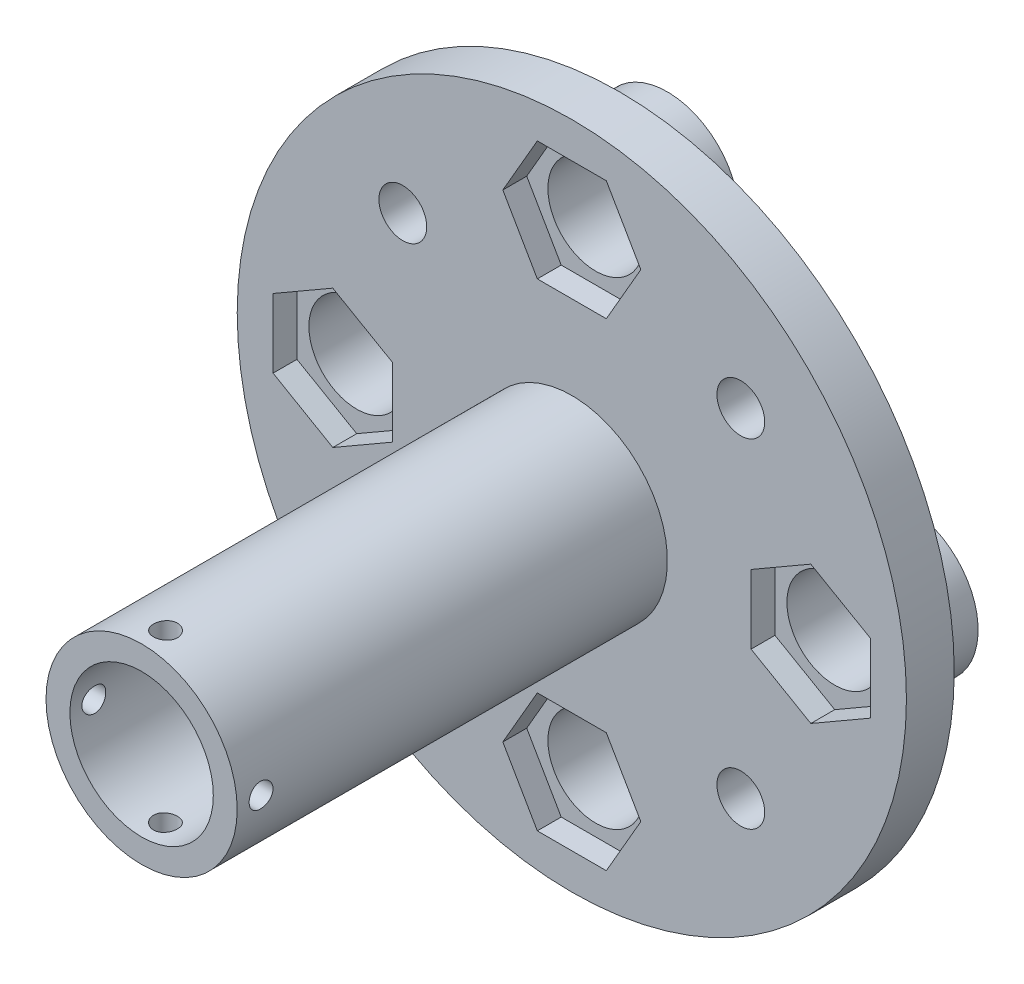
ISO-10303-21;
HEADER;
FILE_DESCRIPTION(('STEP AP214'),'2;1');
FILE_NAME('part.step','',(''),(''),'','','');
FILE_SCHEMA(('AUTOMOTIVE_DESIGN { 1 0 10303 214 1 1 1 1 }'));
ENDSEC;
DATA;
#1=APPLICATION_CONTEXT('core data for automotive mechanical design processes');
#2=APPLICATION_PROTOCOL_DEFINITION('international standard','automotive_design',2000,#1);
#3=PRODUCT_CONTEXT('',#1,'mechanical');
#4=PRODUCT('Part','Part','',(#3));
#5=PRODUCT_RELATED_PRODUCT_CATEGORY('part','',(#4));
#6=PRODUCT_DEFINITION_FORMATION('','',#4);
#7=PRODUCT_DEFINITION_CONTEXT('part definition',#1,'design');
#8=PRODUCT_DEFINITION('design','',#6,#7);
#9=PRODUCT_DEFINITION_SHAPE('','',#8);
#10=(LENGTH_UNIT() NAMED_UNIT(*) SI_UNIT(.MILLI.,.METRE.));
#11=(NAMED_UNIT(*) PLANE_ANGLE_UNIT() SI_UNIT($,.RADIAN.));
#12=(NAMED_UNIT(*) SI_UNIT($,.STERADIAN.) SOLID_ANGLE_UNIT());
#13=UNCERTAINTY_MEASURE_WITH_UNIT(LENGTH_MEASURE(1.E-05),#10,'distance_accuracy_value','');
#14=(GEOMETRIC_REPRESENTATION_CONTEXT(3) GLOBAL_UNCERTAINTY_ASSIGNED_CONTEXT((#13)) GLOBAL_UNIT_ASSIGNED_CONTEXT((#10,
#11,#12)) REPRESENTATION_CONTEXT('',''));
#15=CARTESIAN_POINT('',(0.,0.,0.));
#16=DIRECTION('',(0.,0.,1.));
#17=DIRECTION('',(1.,0.,0.));
#18=AXIS2_PLACEMENT_3D('',#15,#16,#17);
#19=CARTESIAN_POINT('',(0.,0.,90.));
#20=DIRECTION('',(0.,0.,-1.));
#21=DIRECTION('',(-1.,0.,0.));
#22=AXIS2_PLACEMENT_3D('',#19,#20,#21);
#23=CYLINDRICAL_SURFACE('',#22,15.);
#24=CARTESIAN_POINT('',(0.,0.,90.));
#25=DIRECTION('',(0.,0.,1.));
#26=DIRECTION('',(1.,0.,0.));
#27=AXIS2_PLACEMENT_3D('',#24,#25,#26);
#28=CIRCLE('',#27,15.);
#29=CARTESIAN_POINT('',(15.,0.,90.));
#30=VERTEX_POINT('',#29);
#31=EDGE_CURVE('E364',#30,#30,#28,.T.);
#32=ORIENTED_EDGE('',*,*,#31,.T.);
#33=EDGE_LOOP('',(#32));
#34=FACE_BOUND('',#33,.T.);
#35=CARTESIAN_POINT('',(15.,0.,82.5));
#36=CARTESIAN_POINT('',(14.9999976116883,-0.139390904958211,82.5000055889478));
#37=CARTESIAN_POINT('',(14.9980367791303,-0.278857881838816,82.5116972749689));
#38=CARTESIAN_POINT('',(14.9904034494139,-0.553880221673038,82.5581356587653));
#39=CARTESIAN_POINT('',(14.9847275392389,-0.689431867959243,82.5929035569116));
#40=CARTESIAN_POINT('',(14.9703006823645,-0.952604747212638,82.6844154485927));
#41=CARTESIAN_POINT('',(14.9615522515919,-1.08023236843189,82.7411414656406));
#42=CARTESIAN_POINT('',(14.9419422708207,-1.32414184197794,82.8749122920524));
#43=CARTESIAN_POINT('',(14.9310809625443,-1.44042498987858,82.951954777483));
#44=CARTESIAN_POINT('',(14.9083331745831,-1.65947261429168,83.1249550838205));
#45=CARTESIAN_POINT('',(14.8964387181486,-1.76211290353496,83.2210691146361));
#46=CARTESIAN_POINT('',(14.8730262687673,-1.94988849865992,83.4291479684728));
#47=CARTESIAN_POINT('',(14.8615082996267,-2.03502269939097,83.5411137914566));
#48=CARTESIAN_POINT('',(14.8400756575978,-2.18586712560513,83.7785709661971));
#49=CARTESIAN_POINT('',(14.8301712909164,-2.251454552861,83.9041413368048));
#50=CARTESIAN_POINT('',(14.8131978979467,-2.36055836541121,84.1647095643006));
#51=CARTESIAN_POINT('',(14.8061286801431,-2.4040762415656,84.2997067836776));
#52=CARTESIAN_POINT('',(14.7957053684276,-2.4674143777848,84.5739802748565));
#53=CARTESIAN_POINT('',(14.792317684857,-2.48744902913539,84.7132057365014));
#54=CARTESIAN_POINT('',(14.7895393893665,-2.50391672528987,84.9930802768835));
#55=CARTESIAN_POINT('',(14.7901484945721,-2.50035144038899,85.1337292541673));
#56=CARTESIAN_POINT('',(14.7952642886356,-2.46989509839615,85.4109278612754));
#57=CARTESIAN_POINT('',(14.7997307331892,-2.44324488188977,85.5475048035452));
#58=CARTESIAN_POINT('',(14.8119949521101,-2.36775314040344,85.8142213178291));
#59=CARTESIAN_POINT('',(14.8197928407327,-2.31891085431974,85.9443606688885));
#60=CARTESIAN_POINT('',(14.837884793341,-2.20017724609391,86.1952288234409));
#61=CARTESIAN_POINT('',(14.8481906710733,-2.13018591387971,86.3159094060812));
#62=CARTESIAN_POINT('',(14.8701291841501,-1.97121201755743,86.5439044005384));
#63=CARTESIAN_POINT('',(14.8817619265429,-1.88222792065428,86.6512177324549));
#64=CARTESIAN_POINT('',(14.9052202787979,-1.68648221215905,86.8508260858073));
#65=CARTESIAN_POINT('',(14.9170464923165,-1.57951396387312,86.9429185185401));
#66=CARTESIAN_POINT('',(14.9394260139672,-1.35153524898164,87.1078777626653));
#67=CARTESIAN_POINT('',(14.9499793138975,-1.23052469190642,87.1807444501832));
#68=CARTESIAN_POINT('',(14.9686389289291,-0.977705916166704,87.3052022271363));
#69=CARTESIAN_POINT('',(14.9767431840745,-0.845888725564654,87.3567754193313));
#70=CARTESIAN_POINT('',(14.9895750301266,-0.575298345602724,87.436994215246));
#71=CARTESIAN_POINT('',(14.9943029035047,-0.43652573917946,87.4656417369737));
#72=CARTESIAN_POINT('',(14.9998112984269,-0.157709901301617,87.4989213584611));
#73=CARTESIAN_POINT('',(15.0006375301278,-0.0177007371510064,87.5038315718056));
#74=CARTESIAN_POINT('',(14.9983747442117,0.26113977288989,87.4902386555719));
#75=CARTESIAN_POINT('',(14.9952858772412,0.399971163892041,87.4717364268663));
#76=CARTESIAN_POINT('',(14.985568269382,0.671656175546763,87.4120751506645));
#77=CARTESIAN_POINT('',(14.9789610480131,0.804540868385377,87.3710537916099));
#78=CARTESIAN_POINT('',(14.9629446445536,1.06154688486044,87.2676654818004));
#79=CARTESIAN_POINT('',(14.9535353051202,1.18566771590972,87.2052973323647));
#80=CARTESIAN_POINT('',(14.9328451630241,1.42283068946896,87.0603488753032));
#81=CARTESIAN_POINT('',(14.9215485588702,1.53576525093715,86.9775948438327));
#82=CARTESIAN_POINT('',(14.898384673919,1.74624358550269,86.7944626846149));
#83=CARTESIAN_POINT('',(14.8865173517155,1.84378623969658,86.6940832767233));
#84=CARTESIAN_POINT('',(14.8634017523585,2.021742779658,86.4773024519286));
#85=CARTESIAN_POINT('',(14.8521611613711,2.10196876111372,86.3607458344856));
#86=CARTESIAN_POINT('',(14.8317152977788,2.24170231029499,86.1156470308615));
#87=CARTESIAN_POINT('',(14.8225099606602,2.30121053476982,85.9871052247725));
#88=CARTESIAN_POINT('',(14.807234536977,2.39753833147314,85.7222102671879));
#89=CARTESIAN_POINT('',(14.8011515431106,2.43445143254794,85.5858919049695));
#90=CARTESIAN_POINT('',(14.7927771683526,2.48483545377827,85.3088798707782));
#91=CARTESIAN_POINT('',(14.7904854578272,2.49830841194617,85.168186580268));
#92=CARTESIAN_POINT('',(14.7899673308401,2.50137286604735,84.8882948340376));
#93=CARTESIAN_POINT('',(14.7916905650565,2.49126013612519,84.7490996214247));
#94=CARTESIAN_POINT('',(14.7988978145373,2.44807983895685,84.4744207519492));
#95=CARTESIAN_POINT('',(14.8043818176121,2.41501234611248,84.3389370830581));
#96=CARTESIAN_POINT('',(14.8184735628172,2.3269744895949,84.0756415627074));
#97=CARTESIAN_POINT('',(14.8270776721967,2.27202959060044,83.947820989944));
#98=CARTESIAN_POINT('',(14.8464436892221,2.14182700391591,83.7031643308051));
#99=CARTESIAN_POINT('',(14.857205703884,2.06656830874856,83.5863287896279));
#100=CARTESIAN_POINT('',(14.8798345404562,1.89681888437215,83.3654644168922));
#101=CARTESIAN_POINT('',(14.891712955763,1.80211056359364,83.2616039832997));
#102=CARTESIAN_POINT('',(14.9151437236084,1.59660903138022,83.0711483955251));
#103=CARTESIAN_POINT('',(14.9266960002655,1.48581211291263,82.9845572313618));
#104=CARTESIAN_POINT('',(14.9482652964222,1.25036916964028,82.8305517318));
#105=CARTESIAN_POINT('',(14.958271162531,1.12563278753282,82.763273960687));
#106=CARTESIAN_POINT('',(14.9755116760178,0.866513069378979,82.6507305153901));
#107=CARTESIAN_POINT('',(14.9827490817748,0.732139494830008,82.6054429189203));
#108=CARTESIAN_POINT('',(14.9920579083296,0.497703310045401,82.5479947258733));
#109=CARTESIAN_POINT('',(14.9950202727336,0.399058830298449,82.530025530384));
#110=CARTESIAN_POINT('',(14.9989921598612,0.200289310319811,82.5060262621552));
#111=CARTESIAN_POINT('',(15.0000017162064,0.100164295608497,82.4999959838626));
#112=CARTESIAN_POINT('',(15.,0.,82.5));
#113=B_SPLINE_CURVE_WITH_KNOTS('',3,(#35,#36,#37,#38,#39,#40,#41,#42,#43,#44,#45,#46,#47,#48,
#49,#50,#51,#52,#53,#54,#55,#56,#57,#58,#59,#60,#61,#62,#63,#64,#65,#66,#67,#68,#69,#70,#71,#72,
#73,#74,#75,#76,#77,#78,#79,#80,#81,#82,#83,#84,#85,#86,#87,#88,#89,#90,#91,#92,#93,#94,#95,#96,
#97,#98,#99,#100,#101,#102,#103,#104,#105,#106,#107,#108,#109,#110,#111,#112),.UNSPECIFIED.,.T.,
.F.,(4,2,2,2,2,2,2,2,2,2,2,2,2,2,2,2,2,2,2,2,2,2,2,2,2,2,2,2,2,2,2,2,2,2,2,2,2,2,4),(0.,
0.417806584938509,0.835997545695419,1.25384686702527,1.67164841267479,2.09302491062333,
2.51442800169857,2.93842520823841,3.3623937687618,3.78246077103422,4.20249804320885,
4.61820521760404,5.0339266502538,5.45164556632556,5.86939820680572,6.29232769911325,
6.71525991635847,7.13854688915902,7.56179844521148,7.98007883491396,8.39834313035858,
8.81407807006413,9.22983635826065,9.64926825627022,10.0687306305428,10.4925382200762,
10.9163323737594,11.3383602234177,11.7603513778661,12.177079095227,12.5938054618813,
13.0100481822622,13.4263115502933,13.8475138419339,14.2688133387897,14.693022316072,
15.1168075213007,15.4170424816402,15.7172722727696),.UNSPECIFIED.);
#114=CARTESIAN_POINT('',(15.,0.,82.5));
#115=VERTEX_POINT('',#114);
#116=EDGE_CURVE('E720',#115,#115,#113,.T.);
#117=ORIENTED_EDGE('',*,*,#116,.F.);
#118=EDGE_LOOP('',(#117));
#119=FACE_BOUND('',#118,.T.);
#120=CARTESIAN_POINT('',(-15.,0.,87.5));
#121=CARTESIAN_POINT('',(-14.9999976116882,-0.139390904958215,87.4999944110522));
#122=CARTESIAN_POINT('',(-14.9980367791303,-0.278857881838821,87.4883027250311));
#123=CARTESIAN_POINT('',(-14.9904034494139,-0.553880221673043,87.4418643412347));
#124=CARTESIAN_POINT('',(-14.9847275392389,-0.689431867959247,87.4070964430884));
#125=CARTESIAN_POINT('',(-14.9703006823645,-0.952604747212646,87.3155845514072));
#126=CARTESIAN_POINT('',(-14.9615522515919,-1.0802323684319,87.2588585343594));
#127=CARTESIAN_POINT('',(-14.9419422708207,-1.32414184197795,87.1250877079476));
#128=CARTESIAN_POINT('',(-14.9310809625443,-1.44042498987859,87.048045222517));
#129=CARTESIAN_POINT('',(-14.9083331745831,-1.65947261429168,86.8750449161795));
#130=CARTESIAN_POINT('',(-14.8964387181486,-1.76211290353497,86.7789308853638));
#131=CARTESIAN_POINT('',(-14.8730262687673,-1.94988849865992,86.5708520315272));
#132=CARTESIAN_POINT('',(-14.8615082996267,-2.03502269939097,86.4588862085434));
#133=CARTESIAN_POINT('',(-14.8400756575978,-2.18586712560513,86.2214290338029));
#134=CARTESIAN_POINT('',(-14.8301712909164,-2.251454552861,86.0958586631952));
#135=CARTESIAN_POINT('',(-14.8131978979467,-2.36055836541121,85.8352904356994));
#136=CARTESIAN_POINT('',(-14.8061286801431,-2.40407624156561,85.7002932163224));
#137=CARTESIAN_POINT('',(-14.7957053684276,-2.4674143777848,85.4260197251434));
#138=CARTESIAN_POINT('',(-14.792317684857,-2.48744902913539,85.2867942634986));
#139=CARTESIAN_POINT('',(-14.7895393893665,-2.50391672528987,85.0069197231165));
#140=CARTESIAN_POINT('',(-14.7901484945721,-2.50035144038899,84.8662707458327));
#141=CARTESIAN_POINT('',(-14.7952642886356,-2.46989509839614,84.5890721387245));
#142=CARTESIAN_POINT('',(-14.7997307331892,-2.44324488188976,84.4524951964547));
#143=CARTESIAN_POINT('',(-14.8119949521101,-2.36775314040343,84.1857786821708));
#144=CARTESIAN_POINT('',(-14.8197928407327,-2.31891085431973,84.0556393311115));
#145=CARTESIAN_POINT('',(-14.837884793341,-2.2001772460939,83.8047711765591));
#146=CARTESIAN_POINT('',(-14.8481906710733,-2.1301859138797,83.6840905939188));
#147=CARTESIAN_POINT('',(-14.8701291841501,-1.97121201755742,83.4560955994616));
#148=CARTESIAN_POINT('',(-14.8817619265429,-1.88222792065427,83.348782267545));
#149=CARTESIAN_POINT('',(-14.9052202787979,-1.68648221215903,83.1491739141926));
#150=CARTESIAN_POINT('',(-14.9170464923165,-1.5795139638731,83.0570814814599));
#151=CARTESIAN_POINT('',(-14.9394260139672,-1.35153524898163,82.8921222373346));
#152=CARTESIAN_POINT('',(-14.9499793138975,-1.23052469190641,82.8192555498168));
#153=CARTESIAN_POINT('',(-14.9686389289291,-0.9777059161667,82.6947977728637));
#154=CARTESIAN_POINT('',(-14.9767431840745,-0.84588872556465,82.6432245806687));
#155=CARTESIAN_POINT('',(-14.9895750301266,-0.575298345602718,82.563005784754));
#156=CARTESIAN_POINT('',(-14.9943029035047,-0.436525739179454,82.5343582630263));
#157=CARTESIAN_POINT('',(-14.9998112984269,-0.157709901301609,82.5010786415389));
#158=CARTESIAN_POINT('',(-15.0006375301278,-0.0177007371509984,82.4961684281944));
#159=CARTESIAN_POINT('',(-14.9983747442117,0.261139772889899,82.5097613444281));
#160=CARTESIAN_POINT('',(-14.9952858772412,0.39997116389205,82.5282635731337));
#161=CARTESIAN_POINT('',(-14.985568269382,0.671656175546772,82.5879248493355));
#162=CARTESIAN_POINT('',(-14.9789610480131,0.804540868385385,82.6289462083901));
#163=CARTESIAN_POINT('',(-14.9629446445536,1.06154688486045,82.7323345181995));
#164=CARTESIAN_POINT('',(-14.9535353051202,1.18566771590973,82.7947026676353));
#165=CARTESIAN_POINT('',(-14.9328451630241,1.42283068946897,82.9396511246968));
#166=CARTESIAN_POINT('',(-14.9215485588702,1.53576525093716,83.0224051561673));
#167=CARTESIAN_POINT('',(-14.898384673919,1.74624358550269,83.2055373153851));
#168=CARTESIAN_POINT('',(-14.8865173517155,1.84378623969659,83.3059167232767));
#169=CARTESIAN_POINT('',(-14.8634017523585,2.02174277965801,83.5226975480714));
#170=CARTESIAN_POINT('',(-14.8521611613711,2.10196876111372,83.6392541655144));
#171=CARTESIAN_POINT('',(-14.8317152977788,2.24170231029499,83.8843529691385));
#172=CARTESIAN_POINT('',(-14.8225099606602,2.30121053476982,84.0128947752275));
#173=CARTESIAN_POINT('',(-14.807234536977,2.39753833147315,84.2777897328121));
#174=CARTESIAN_POINT('',(-14.8011515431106,2.43445143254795,84.4141080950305));
#175=CARTESIAN_POINT('',(-14.7927771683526,2.48483545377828,84.6911201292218));
#176=CARTESIAN_POINT('',(-14.7904854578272,2.49830841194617,84.831813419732));
#177=CARTESIAN_POINT('',(-14.7899673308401,2.50137286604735,85.1117051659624));
#178=CARTESIAN_POINT('',(-14.7916905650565,2.49126013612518,85.2509003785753));
#179=CARTESIAN_POINT('',(-14.7988978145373,2.44807983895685,85.5255792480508));
#180=CARTESIAN_POINT('',(-14.8043818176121,2.41501234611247,85.6610629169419));
#181=CARTESIAN_POINT('',(-14.8184735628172,2.3269744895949,85.9243584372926));
#182=CARTESIAN_POINT('',(-14.8270776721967,2.27202959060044,86.052179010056));
#183=CARTESIAN_POINT('',(-14.8464436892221,2.1418270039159,86.2968356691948));
#184=CARTESIAN_POINT('',(-14.857205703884,2.06656830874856,86.4136712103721));
#185=CARTESIAN_POINT('',(-14.8798345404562,1.89681888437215,86.6345355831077));
#186=CARTESIAN_POINT('',(-14.891712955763,1.80211056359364,86.7383960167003));
#187=CARTESIAN_POINT('',(-14.9151437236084,1.59660903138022,86.9288516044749));
#188=CARTESIAN_POINT('',(-14.9266960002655,1.48581211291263,87.0154427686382));
#189=CARTESIAN_POINT('',(-14.9482652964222,1.25036916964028,87.1694482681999));
#190=CARTESIAN_POINT('',(-14.958271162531,1.12563278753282,87.2367260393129));
#191=CARTESIAN_POINT('',(-14.9755116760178,0.866513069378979,87.3492694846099));
#192=CARTESIAN_POINT('',(-14.9827490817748,0.732139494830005,87.3945570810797));
#193=CARTESIAN_POINT('',(-14.9920579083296,0.497703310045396,87.4520052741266));
#194=CARTESIAN_POINT('',(-14.9950202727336,0.399058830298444,87.4699744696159));
#195=CARTESIAN_POINT('',(-14.9989921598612,0.200289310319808,87.4939737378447));
#196=CARTESIAN_POINT('',(-15.0000017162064,0.100164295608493,87.5000040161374));
#197=CARTESIAN_POINT('',(-15.,0.,87.5));
#198=B_SPLINE_CURVE_WITH_KNOTS('',3,(#120,#121,#122,#123,#124,#125,#126,#127,#128,#129,#130,
#131,#132,#133,#134,#135,#136,#137,#138,#139,#140,#141,#142,#143,#144,#145,#146,#147,#148,#149,
#150,#151,#152,#153,#154,#155,#156,#157,#158,#159,#160,#161,#162,#163,#164,#165,#166,#167,#168,
#169,#170,#171,#172,#173,#174,#175,#176,#177,#178,#179,#180,#181,#182,#183,#184,#185,#186,#187,
#188,#189,#190,#191,#192,#193,#194,#195,#196,#197),.UNSPECIFIED.,.T.,.F.,(4,2,2,2,2,2,2,2,2,2,2,
2,2,2,2,2,2,2,2,2,2,2,2,2,2,2,2,2,2,2,2,2,2,2,2,2,2,2,4),(0.,0.41780658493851,0.835997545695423,
1.25384686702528,1.67164841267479,2.09302491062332,2.51442800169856,2.9384252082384,
3.36239376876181,3.78246077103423,4.20249804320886,4.61820521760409,5.03392665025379,
5.45164556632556,5.86939820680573,6.29232769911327,6.71525991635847,7.13854688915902,
7.56179844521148,7.98007883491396,8.39834313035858,8.81407807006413,9.22983635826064,
9.64926825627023,10.0687306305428,10.4925382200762,10.9163323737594,11.3383602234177,
11.7603513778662,12.177079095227,12.5938054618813,13.0100481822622,13.4263115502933,
13.8475138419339,14.2688133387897,14.693022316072,15.1168075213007,15.4170424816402,
15.7172722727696),.UNSPECIFIED.);
#199=CARTESIAN_POINT('',(-15.,0.,87.5));
#200=VERTEX_POINT('',#199);
#201=EDGE_CURVE('E706',#200,#200,#198,.T.);
#202=ORIENTED_EDGE('',*,*,#201,.F.);
#203=EDGE_LOOP('',(#202));
#204=FACE_BOUND('',#203,.T.);
#205=CARTESIAN_POINT('',(0.,15.,87.5));
#206=CARTESIAN_POINT('',(-0.139390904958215,14.9999976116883,87.4999944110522));
#207=CARTESIAN_POINT('',(-0.278857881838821,14.9980367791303,87.4883027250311));
#208=CARTESIAN_POINT('',(-0.553880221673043,14.9904034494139,87.4418643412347));
#209=CARTESIAN_POINT('',(-0.689431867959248,14.9847275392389,87.4070964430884));
#210=CARTESIAN_POINT('',(-0.952604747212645,14.9703006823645,87.3155845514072));
#211=CARTESIAN_POINT('',(-1.0802323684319,14.9615522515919,87.2588585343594));
#212=CARTESIAN_POINT('',(-1.32414184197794,14.9419422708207,87.1250877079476));
#213=CARTESIAN_POINT('',(-1.44042498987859,14.9310809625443,87.048045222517));
#214=CARTESIAN_POINT('',(-1.65947261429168,14.9083331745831,86.8750449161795));
#215=CARTESIAN_POINT('',(-1.76211290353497,14.8964387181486,86.7789308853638));
#216=CARTESIAN_POINT('',(-1.94988849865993,14.8730262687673,86.5708520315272));
#217=CARTESIAN_POINT('',(-2.03502269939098,14.8615082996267,86.4588862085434));
#218=CARTESIAN_POINT('',(-2.18586712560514,14.8400756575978,86.2214290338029));
#219=CARTESIAN_POINT('',(-2.251454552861,14.8301712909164,86.0958586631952));
#220=CARTESIAN_POINT('',(-2.36055836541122,14.8131978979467,85.8352904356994));
#221=CARTESIAN_POINT('',(-2.40407624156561,14.8061286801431,85.7002932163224));
#222=CARTESIAN_POINT('',(-2.46741437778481,14.7957053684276,85.4260197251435));
#223=CARTESIAN_POINT('',(-2.4874490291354,14.792317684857,85.2867942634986));
#224=CARTESIAN_POINT('',(-2.50391672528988,14.7895393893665,85.0069197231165));
#225=CARTESIAN_POINT('',(-2.500351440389,14.7901484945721,84.8662707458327));
#226=CARTESIAN_POINT('',(-2.46989509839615,14.7952642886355,84.5890721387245));
#227=CARTESIAN_POINT('',(-2.44324488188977,14.7997307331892,84.4524951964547));
#228=CARTESIAN_POINT('',(-2.36775314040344,14.8119949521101,84.1857786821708));
#229=CARTESIAN_POINT('',(-2.31891085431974,14.8197928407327,84.0556393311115));
#230=CARTESIAN_POINT('',(-2.20017724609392,14.837884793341,83.8047711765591));
#231=CARTESIAN_POINT('',(-2.13018591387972,14.8481906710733,83.6840905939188));
#232=CARTESIAN_POINT('',(-1.97121201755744,14.8701291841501,83.4560955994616));
#233=CARTESIAN_POINT('',(-1.88222792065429,14.8817619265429,83.348782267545));
#234=CARTESIAN_POINT('',(-1.68648221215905,14.9052202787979,83.1491739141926));
#235=CARTESIAN_POINT('',(-1.57951396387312,14.9170464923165,83.0570814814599));
#236=CARTESIAN_POINT('',(-1.35153524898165,14.9394260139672,82.8921222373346));
#237=CARTESIAN_POINT('',(-1.23052469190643,14.9499793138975,82.8192555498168));
#238=CARTESIAN_POINT('',(-0.977705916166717,14.9686389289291,82.6947977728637));
#239=CARTESIAN_POINT('',(-0.845888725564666,14.9767431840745,82.6432245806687));
#240=CARTESIAN_POINT('',(-0.575298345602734,14.9895750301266,82.563005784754));
#241=CARTESIAN_POINT('',(-0.436525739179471,14.9943029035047,82.5343582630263));
#242=CARTESIAN_POINT('',(-0.157709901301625,14.9998112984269,82.5010786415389));
#243=CARTESIAN_POINT('',(-0.0177007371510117,15.0006375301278,82.4961684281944));
#244=CARTESIAN_POINT('',(0.261139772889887,14.9983747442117,82.5097613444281));
#245=CARTESIAN_POINT('',(0.399971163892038,14.9952858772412,82.5282635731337));
#246=CARTESIAN_POINT('',(0.671656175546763,14.985568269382,82.5879248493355));
#247=CARTESIAN_POINT('',(0.80454086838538,14.9789610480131,82.6289462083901));
#248=CARTESIAN_POINT('',(1.06154688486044,14.9629446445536,82.7323345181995));
#249=CARTESIAN_POINT('',(1.18566771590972,14.9535353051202,82.7947026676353));
#250=CARTESIAN_POINT('',(1.42283068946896,14.9328451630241,82.9396511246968));
#251=CARTESIAN_POINT('',(1.53576525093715,14.9215485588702,83.0224051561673));
#252=CARTESIAN_POINT('',(1.74624358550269,14.898384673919,83.205537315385));
#253=CARTESIAN_POINT('',(1.84378623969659,14.8865173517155,83.3059167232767));
#254=CARTESIAN_POINT('',(2.021742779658,14.8634017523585,83.5226975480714));
#255=CARTESIAN_POINT('',(2.10196876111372,14.8521611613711,83.6392541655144));
#256=CARTESIAN_POINT('',(2.24170231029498,14.8317152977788,83.8843529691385));
#257=CARTESIAN_POINT('',(2.30121053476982,14.8225099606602,84.0128947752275));
#258=CARTESIAN_POINT('',(2.39753833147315,14.807234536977,84.2777897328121));
#259=CARTESIAN_POINT('',(2.43445143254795,14.8011515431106,84.4141080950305));
#260=CARTESIAN_POINT('',(2.48483545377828,14.7927771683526,84.6911201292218));
#261=CARTESIAN_POINT('',(2.49830841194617,14.7904854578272,84.831813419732));
#262=CARTESIAN_POINT('',(2.50137286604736,14.7899673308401,85.1117051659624));
#263=CARTESIAN_POINT('',(2.49126013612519,14.7916905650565,85.2509003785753));
#264=CARTESIAN_POINT('',(2.44807983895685,14.7988978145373,85.5255792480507));
#265=CARTESIAN_POINT('',(2.41501234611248,14.8043818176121,85.6610629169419));
#266=CARTESIAN_POINT('',(2.32697448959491,14.8184735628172,85.9243584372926));
#267=CARTESIAN_POINT('',(2.27202959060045,14.8270776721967,86.052179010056));
#268=CARTESIAN_POINT('',(2.14182700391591,14.8464436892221,86.2968356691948));
#269=CARTESIAN_POINT('',(2.06656830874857,14.857205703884,86.4136712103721));
#270=CARTESIAN_POINT('',(1.89681888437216,14.8798345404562,86.6345355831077));
#271=CARTESIAN_POINT('',(1.80211056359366,14.891712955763,86.7383960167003));
#272=CARTESIAN_POINT('',(1.59660903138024,14.9151437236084,86.9288516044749));
#273=CARTESIAN_POINT('',(1.48581211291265,14.9266960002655,87.0154427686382));
#274=CARTESIAN_POINT('',(1.25036916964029,14.9482652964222,87.1694482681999));
#275=CARTESIAN_POINT('',(1.12563278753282,14.958271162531,87.2367260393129));
#276=CARTESIAN_POINT('',(0.866513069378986,14.9755116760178,87.3492694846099));
#277=CARTESIAN_POINT('',(0.732139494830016,14.9827490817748,87.3945570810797));
#278=CARTESIAN_POINT('',(0.497703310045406,14.9920579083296,87.4520052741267));
#279=CARTESIAN_POINT('',(0.399058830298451,14.9950202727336,87.469974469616));
#280=CARTESIAN_POINT('',(0.20028931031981,14.9989921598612,87.4939737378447));
#281=CARTESIAN_POINT('',(0.100164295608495,15.0000017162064,87.5000040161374));
#282=CARTESIAN_POINT('',(0.,15.,87.5));
#283=B_SPLINE_CURVE_WITH_KNOTS('',3,(#205,#206,#207,#208,#209,#210,#211,#212,#213,#214,#215,
#216,#217,#218,#219,#220,#221,#222,#223,#224,#225,#226,#227,#228,#229,#230,#231,#232,#233,#234,
#235,#236,#237,#238,#239,#240,#241,#242,#243,#244,#245,#246,#247,#248,#249,#250,#251,#252,#253,
#254,#255,#256,#257,#258,#259,#260,#261,#262,#263,#264,#265,#266,#267,#268,#269,#270,#271,#272,
#273,#274,#275,#276,#277,#278,#279,#280,#281,#282),.UNSPECIFIED.,.T.,.F.,(4,2,2,2,2,2,2,2,2,2,2,
2,2,2,2,2,2,2,2,2,2,2,2,2,2,2,2,2,2,2,2,2,2,2,2,2,2,2,4),(0.,0.417806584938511,0.83599754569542,
1.25384686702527,1.67164841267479,2.09302491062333,2.51442800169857,2.9384252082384,
3.3623937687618,3.78246077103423,4.20249804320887,4.61820521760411,5.0339266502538,
5.45164556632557,5.86939820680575,6.29232769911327,6.71525991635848,7.13854688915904,
7.56179844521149,7.98007883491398,8.3983431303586,8.81407807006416,9.22983635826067,
9.64926825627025,10.0687306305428,10.4925382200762,10.9163323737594,11.3383602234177,
11.7603513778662,12.177079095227,12.5938054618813,13.0100481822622,13.4263115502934,
13.8475138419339,14.2688133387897,14.693022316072,15.1168075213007,15.4170424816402,
15.7172722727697),.UNSPECIFIED.);
#284=CARTESIAN_POINT('',(0.,15.,87.5));
#285=VERTEX_POINT('',#284);
#286=EDGE_CURVE('E677',#285,#285,#283,.T.);
#287=ORIENTED_EDGE('',*,*,#286,.F.);
#288=EDGE_LOOP('',(#287));
#289=FACE_BOUND('',#288,.T.);
#290=CARTESIAN_POINT('',(0.,-15.,87.5));
#291=CARTESIAN_POINT('',(0.139390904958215,-14.9999976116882,87.4999944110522));
#292=CARTESIAN_POINT('',(0.278857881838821,-14.9980367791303,87.4883027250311));
#293=CARTESIAN_POINT('',(0.553880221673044,-14.9904034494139,87.4418643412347));
#294=CARTESIAN_POINT('',(0.689431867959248,-14.9847275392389,87.4070964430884));
#295=CARTESIAN_POINT('',(0.952604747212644,-14.9703006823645,87.3155845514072));
#296=CARTESIAN_POINT('',(1.0802323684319,-14.9615522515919,87.2588585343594));
#297=CARTESIAN_POINT('',(1.32414184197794,-14.9419422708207,87.1250877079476));
#298=CARTESIAN_POINT('',(1.44042498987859,-14.9310809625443,87.048045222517));
#299=CARTESIAN_POINT('',(1.65947261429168,-14.9083331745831,86.8750449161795));
#300=CARTESIAN_POINT('',(1.76211290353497,-14.8964387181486,86.7789308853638));
#301=CARTESIAN_POINT('',(1.94988849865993,-14.8730262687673,86.5708520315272));
#302=CARTESIAN_POINT('',(2.03502269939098,-14.8615082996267,86.4588862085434));
#303=CARTESIAN_POINT('',(2.18586712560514,-14.8400756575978,86.2214290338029));
#304=CARTESIAN_POINT('',(2.251454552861,-14.8301712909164,86.0958586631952));
#305=CARTESIAN_POINT('',(2.36055836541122,-14.8131978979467,85.8352904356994));
#306=CARTESIAN_POINT('',(2.40407624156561,-14.8061286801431,85.7002932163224));
#307=CARTESIAN_POINT('',(2.46741437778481,-14.7957053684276,85.4260197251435));
#308=CARTESIAN_POINT('',(2.4874490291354,-14.792317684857,85.2867942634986));
#309=CARTESIAN_POINT('',(2.50391672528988,-14.7895393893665,85.0069197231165));
#310=CARTESIAN_POINT('',(2.500351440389,-14.7901484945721,84.8662707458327));
#311=CARTESIAN_POINT('',(2.46989509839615,-14.7952642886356,84.5890721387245));
#312=CARTESIAN_POINT('',(2.44324488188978,-14.7997307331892,84.4524951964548));
#313=CARTESIAN_POINT('',(2.36775314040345,-14.8119949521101,84.1857786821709));
#314=CARTESIAN_POINT('',(2.31891085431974,-14.8197928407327,84.0556393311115));
#315=CARTESIAN_POINT('',(2.20017724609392,-14.837884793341,83.8047711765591));
#316=CARTESIAN_POINT('',(2.13018591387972,-14.8481906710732,83.6840905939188));
#317=CARTESIAN_POINT('',(1.97121201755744,-14.8701291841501,83.4560955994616));
#318=CARTESIAN_POINT('',(1.88222792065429,-14.8817619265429,83.348782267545));
#319=CARTESIAN_POINT('',(1.68648221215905,-14.9052202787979,83.1491739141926));
#320=CARTESIAN_POINT('',(1.57951396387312,-14.9170464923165,83.0570814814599));
#321=CARTESIAN_POINT('',(1.35153524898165,-14.9394260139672,82.8921222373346));
#322=CARTESIAN_POINT('',(1.23052469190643,-14.9499793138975,82.8192555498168));
#323=CARTESIAN_POINT('',(0.977705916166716,-14.9686389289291,82.6947977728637));
#324=CARTESIAN_POINT('',(0.845888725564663,-14.9767431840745,82.6432245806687));
#325=CARTESIAN_POINT('',(0.575298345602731,-14.9895750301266,82.563005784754));
#326=CARTESIAN_POINT('',(0.436525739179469,-14.9943029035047,82.5343582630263));
#327=CARTESIAN_POINT('',(0.157709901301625,-14.9998112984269,82.5010786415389));
#328=CARTESIAN_POINT('',(0.0177007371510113,-15.0006375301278,82.4961684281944));
#329=CARTESIAN_POINT('',(-0.261139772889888,-14.9983747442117,82.5097613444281));
#330=CARTESIAN_POINT('',(-0.399971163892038,-14.9952858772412,82.5282635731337));
#331=CARTESIAN_POINT('',(-0.671656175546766,-14.985568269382,82.5879248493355));
#332=CARTESIAN_POINT('',(-0.804540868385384,-14.9789610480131,82.6289462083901));
#333=CARTESIAN_POINT('',(-1.06154688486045,-14.9629446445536,82.7323345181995));
#334=CARTESIAN_POINT('',(-1.18566771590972,-14.9535353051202,82.7947026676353));
#335=CARTESIAN_POINT('',(-1.42283068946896,-14.9328451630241,82.9396511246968));
#336=CARTESIAN_POINT('',(-1.53576525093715,-14.9215485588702,83.0224051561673));
#337=CARTESIAN_POINT('',(-1.74624358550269,-14.898384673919,83.205537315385));
#338=CARTESIAN_POINT('',(-1.84378623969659,-14.8865173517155,83.3059167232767));
#339=CARTESIAN_POINT('',(-2.021742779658,-14.8634017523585,83.5226975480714));
#340=CARTESIAN_POINT('',(-2.10196876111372,-14.8521611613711,83.6392541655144));
#341=CARTESIAN_POINT('',(-2.24170231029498,-14.8317152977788,83.8843529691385));
#342=CARTESIAN_POINT('',(-2.30121053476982,-14.8225099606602,84.0128947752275));
#343=CARTESIAN_POINT('',(-2.39753833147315,-14.807234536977,84.2777897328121));
#344=CARTESIAN_POINT('',(-2.43445143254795,-14.8011515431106,84.4141080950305));
#345=CARTESIAN_POINT('',(-2.48483545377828,-14.7927771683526,84.6911201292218));
#346=CARTESIAN_POINT('',(-2.49830841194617,-14.7904854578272,84.831813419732));
#347=CARTESIAN_POINT('',(-2.50137286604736,-14.7899673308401,85.1117051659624));
#348=CARTESIAN_POINT('',(-2.49126013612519,-14.7916905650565,85.2509003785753));
#349=CARTESIAN_POINT('',(-2.44807983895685,-14.7988978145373,85.5255792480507));
#350=CARTESIAN_POINT('',(-2.41501234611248,-14.8043818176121,85.6610629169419));
#351=CARTESIAN_POINT('',(-2.32697448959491,-14.8184735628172,85.9243584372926));
#352=CARTESIAN_POINT('',(-2.27202959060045,-14.8270776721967,86.052179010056));
#353=CARTESIAN_POINT('',(-2.14182700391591,-14.8464436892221,86.2968356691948));
#354=CARTESIAN_POINT('',(-2.06656830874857,-14.857205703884,86.4136712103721));
#355=CARTESIAN_POINT('',(-1.89681888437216,-14.8798345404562,86.6345355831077));
#356=CARTESIAN_POINT('',(-1.80211056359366,-14.891712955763,86.7383960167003));
#357=CARTESIAN_POINT('',(-1.59660903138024,-14.9151437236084,86.9288516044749));
#358=CARTESIAN_POINT('',(-1.48581211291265,-14.9266960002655,87.0154427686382));
#359=CARTESIAN_POINT('',(-1.25036916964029,-14.9482652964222,87.1694482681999));
#360=CARTESIAN_POINT('',(-1.12563278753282,-14.958271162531,87.2367260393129));
#361=CARTESIAN_POINT('',(-0.866513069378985,-14.9755116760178,87.3492694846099));
#362=CARTESIAN_POINT('',(-0.732139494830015,-14.9827490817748,87.3945570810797));
#363=CARTESIAN_POINT('',(-0.497703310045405,-14.9920579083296,87.4520052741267));
#364=CARTESIAN_POINT('',(-0.399058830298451,-14.9950202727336,87.469974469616));
#365=CARTESIAN_POINT('',(-0.200289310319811,-14.9989921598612,87.4939737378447));
#366=CARTESIAN_POINT('',(-0.100164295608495,-15.0000017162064,87.5000040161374));
#367=CARTESIAN_POINT('',(0.,-15.,87.5));
#368=B_SPLINE_CURVE_WITH_KNOTS('',3,(#290,#291,#292,#293,#294,#295,#296,#297,#298,#299,#300,
#301,#302,#303,#304,#305,#306,#307,#308,#309,#310,#311,#312,#313,#314,#315,#316,#317,#318,#319,
#320,#321,#322,#323,#324,#325,#326,#327,#328,#329,#330,#331,#332,#333,#334,#335,#336,#337,#338,
#339,#340,#341,#342,#343,#344,#345,#346,#347,#348,#349,#350,#351,#352,#353,#354,#355,#356,#357,
#358,#359,#360,#361,#362,#363,#364,#365,#366,#367),.UNSPECIFIED.,.T.,.F.,(4,2,2,2,2,2,2,2,2,2,2,
2,2,2,2,2,2,2,2,2,2,2,2,2,2,2,2,2,2,2,2,2,2,2,2,2,2,2,4),(0.,0.417806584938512,
0.835997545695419,1.25384686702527,1.67164841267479,2.09302491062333,2.51442800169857,
2.9384252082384,3.3623937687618,3.78246077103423,4.20249804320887,4.61820521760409,
5.0339266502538,5.45164556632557,5.86939820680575,6.29232769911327,6.71525991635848,
7.13854688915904,7.56179844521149,7.98007883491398,8.3983431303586,8.81407807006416,
9.22983635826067,9.64926825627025,10.0687306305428,10.4925382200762,10.9163323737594,
11.3383602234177,11.7603513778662,12.177079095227,12.5938054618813,13.0100481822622,
13.4263115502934,13.8475138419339,14.2688133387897,14.693022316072,15.1168075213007,
15.4170424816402,15.7172722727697),.UNSPECIFIED.);
#369=CARTESIAN_POINT('',(0.,-15.,87.5));
#370=VERTEX_POINT('',#369);
#371=EDGE_CURVE('E355',#370,#370,#368,.T.);
#372=ORIENTED_EDGE('',*,*,#371,.F.);
#373=EDGE_LOOP('',(#372));
#374=FACE_BOUND('',#373,.T.);
#375=CARTESIAN_POINT('',(0.,0.,0.));
#376=DIRECTION('',(0.,0.,-1.));
#377=DIRECTION('',(-1.,0.,0.));
#378=AXIS2_PLACEMENT_3D('',#375,#376,#377);
#379=CIRCLE('',#378,15.);
#380=CARTESIAN_POINT('',(-15.,0.,0.));
#381=VERTEX_POINT('',#380);
#382=EDGE_CURVE('E591',#381,#381,#379,.T.);
#383=ORIENTED_EDGE('',*,*,#382,.T.);
#384=EDGE_LOOP('',(#383));
#385=FACE_BOUND('',#384,.T.);
#386=ADVANCED_FACE('F350',(#34,#119,#204,#289,#374,#385),#23,.F.);
#387=CARTESIAN_POINT('',(0.,0.,-10.));
#388=DIRECTION('',(0.,0.,-1.));
#389=DIRECTION('',(-1.,0.,0.));
#390=AXIS2_PLACEMENT_3D('',#387,#388,#389);
#391=PLANE('',#390);
#392=CARTESIAN_POINT('',(3.49148336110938E-13,-50.,-10.));
#393=DIRECTION('',(0.,0.,-1.));
#394=DIRECTION('',(-1.,0.,0.));
#395=AXIS2_PLACEMENT_3D('',#392,#393,#394);
#396=CIRCLE('',#395,15.);
#397=CARTESIAN_POINT('',(-14.9999999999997,-50.,-10.));
#398=VERTEX_POINT('',#397);
#399=EDGE_CURVE('E629',#398,#398,#396,.T.);
#400=ORIENTED_EDGE('',*,*,#399,.F.);
#401=EDGE_LOOP('',(#400));
#402=FACE_BOUND('',#401,.T.);
#403=CARTESIAN_POINT('',(0.,50.,-10.));
#404=DIRECTION('',(0.,0.,-1.));
#405=DIRECTION('',(-1.,0.,0.));
#406=AXIS2_PLACEMENT_3D('',#403,#404,#405);
#407=CIRCLE('',#406,15.);
#408=CARTESIAN_POINT('',(-15.,50.,-10.));
#409=VERTEX_POINT('',#408);
#410=EDGE_CURVE('E647',#409,#409,#407,.T.);
#411=ORIENTED_EDGE('',*,*,#410,.F.);
#412=EDGE_LOOP('',(#411));
#413=FACE_BOUND('',#412,.T.);
#414=CARTESIAN_POINT('',(-35.3553390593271,35.3553390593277,-10.));
#415=DIRECTION('',(0.,0.,1.));
#416=DIRECTION('',(1.,0.,0.));
#417=AXIS2_PLACEMENT_3D('',#414,#415,#416);
#418=CIRCLE('',#417,5.);
#419=CARTESIAN_POINT('',(-30.3553390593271,35.3553390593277,-10.));
#420=VERTEX_POINT('',#419);
#421=EDGE_CURVE('E656',#420,#420,#418,.T.);
#422=ORIENTED_EDGE('',*,*,#421,.T.);
#423=EDGE_LOOP('',(#422));
#424=FACE_BOUND('',#423,.T.);
#425=CARTESIAN_POINT('',(-35.3553390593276,-35.3553390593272,-10.));
#426=DIRECTION('',(0.,0.,1.));
#427=DIRECTION('',(1.,0.,0.));
#428=AXIS2_PLACEMENT_3D('',#425,#426,#427);
#429=CIRCLE('',#428,4.99999999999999);
#430=CARTESIAN_POINT('',(-30.3553390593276,-35.3553390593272,-10.));
#431=VERTEX_POINT('',#430);
#432=EDGE_CURVE('E662',#431,#431,#429,.T.);
#433=ORIENTED_EDGE('',*,*,#432,.T.);
#434=EDGE_LOOP('',(#433));
#435=FACE_BOUND('',#434,.T.);
#436=CARTESIAN_POINT('',(35.3553390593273,-35.3553390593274,-10.));
#437=DIRECTION('',(0.,0.,1.));
#438=DIRECTION('',(1.,0.,0.));
#439=AXIS2_PLACEMENT_3D('',#436,#437,#438);
#440=CIRCLE('',#439,5.);
#441=CARTESIAN_POINT('',(40.3553390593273,-35.3553390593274,-10.));
#442=VERTEX_POINT('',#441);
#443=EDGE_CURVE('E668',#442,#442,#440,.T.);
#444=ORIENTED_EDGE('',*,*,#443,.T.);
#445=EDGE_LOOP('',(#444));
#446=FACE_BOUND('',#445,.T.);
#447=CARTESIAN_POINT('',(35.3553390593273,35.3553390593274,-10.));
#448=DIRECTION('',(0.,0.,1.));
#449=DIRECTION('',(1.,0.,0.));
#450=AXIS2_PLACEMENT_3D('',#447,#448,#449);
#451=CIRCLE('',#450,5.);
#452=CARTESIAN_POINT('',(40.3553390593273,35.3553390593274,-10.));
#453=VERTEX_POINT('',#452);
#454=EDGE_CURVE('E674',#453,#453,#451,.T.);
#455=ORIENTED_EDGE('',*,*,#454,.T.);
#456=EDGE_LOOP('',(#455));
#457=FACE_BOUND('',#456,.T.);
#458=CARTESIAN_POINT('',(0.,0.,-10.));
#459=DIRECTION('',(0.,0.,-1.));
#460=DIRECTION('',(-1.,0.,0.));
#461=AXIS2_PLACEMENT_3D('',#458,#459,#460);
#462=CIRCLE('',#461,70.);
#463=CARTESIAN_POINT('',(-70.,0.,-10.));
#464=VERTEX_POINT('',#463);
#465=EDGE_CURVE('E750',#464,#464,#462,.T.);
#466=ORIENTED_EDGE('',*,*,#465,.T.);
#467=EDGE_LOOP('',(#466));
#468=FACE_BOUND('',#467,.T.);
#469=CARTESIAN_POINT('',(0.,0.,-10.));
#470=DIRECTION('',(0.,0.,-1.));
#471=DIRECTION('',(-1.,0.,0.));
#472=AXIS2_PLACEMENT_3D('',#469,#470,#471);
#473=CIRCLE('',#472,15.);
#474=CARTESIAN_POINT('',(-15.,0.,-10.));
#475=VERTEX_POINT('',#474);
#476=EDGE_CURVE('E742',#475,#475,#473,.T.);
#477=ORIENTED_EDGE('',*,*,#476,.F.);
#478=EDGE_LOOP('',(#477));
#479=FACE_BOUND('',#478,.T.);
#480=CARTESIAN_POINT('',(-50.,-1.74574168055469E-13,-10.));
#481=DIRECTION('',(0.,0.,-1.));
#482=DIRECTION('',(-1.,0.,0.));
#483=AXIS2_PLACEMENT_3D('',#480,#481,#482);
#484=CIRCLE('',#483,15.);
#485=CARTESIAN_POINT('',(-65.,-1.74574168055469E-13,-10.));
#486=VERTEX_POINT('',#485);
#487=EDGE_CURVE('E638',#486,#486,#484,.T.);
#488=ORIENTED_EDGE('',*,*,#487,.F.);
#489=EDGE_LOOP('',(#488));
#490=FACE_BOUND('',#489,.T.);
#491=CARTESIAN_POINT('',(50.,5.23722504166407E-13,-10.));
#492=DIRECTION('',(0.,0.,-1.));
#493=DIRECTION('',(-1.,0.,0.));
#494=AXIS2_PLACEMENT_3D('',#491,#492,#493);
#495=CIRCLE('',#494,15.);
#496=CARTESIAN_POINT('',(35.,5.23722504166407E-13,-10.));
#497=VERTEX_POINT('',#496);
#498=EDGE_CURVE('E620',#497,#497,#495,.T.);
#499=ORIENTED_EDGE('',*,*,#498,.F.);
#500=EDGE_LOOP('',(#499));
#501=FACE_BOUND('',#500,.T.);
#502=ADVANCED_FACE('F713',(#402,#413,#424,#435,#446,#457,#468,#479,#490,#501),#391,.T.);
#503=CARTESIAN_POINT('',(0.,-50.,90.));
#504=DIRECTION('',(0.,0.,-1.));
#505=DIRECTION('',(-1.,0.,0.));
#506=AXIS2_PLACEMENT_3D('',#503,#504,#505);
#507=CYLINDRICAL_SURFACE('',#506,10.);
#508=CARTESIAN_POINT('',(0.,-50.,-5.));
#509=DIRECTION('',(0.,0.,1.));
#510=DIRECTION('',(1.,0.,0.));
#511=AXIS2_PLACEMENT_3D('',#508,#509,#510);
#512=CIRCLE('',#511,10.);
#513=CARTESIAN_POINT('',(-10.,-50.,-5.00000000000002));
#514=VERTEX_POINT('',#513);
#515=EDGE_CURVE('E730',#514,#514,#512,.F.);
#516=CARTESIAN_POINT('',(3.49148336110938E-13,-50.,-20.));
#517=DIRECTION('',(0.,0.,-1.));
#518=DIRECTION('',(-1.,0.,0.));
#519=AXIS2_PLACEMENT_3D('',#516,#517,#518);
#520=CIRCLE('',#519,10.);
#521=CARTESIAN_POINT('',(-10.,-50.,-20.));
#522=VERTEX_POINT('',#521);
#523=EDGE_CURVE('E626',#522,#522,#520,.T.);
#524=CARTESIAN_POINT('',(-10.,-50.,-5.00000000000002));
#525=CARTESIAN_POINT('',(-10.,-50.,-5.15625000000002));
#526=CARTESIAN_POINT('',(-10.,-50.,-5.31250000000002));
#527=CARTESIAN_POINT('',(-10.,-50.,-5.62500000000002));
#528=CARTESIAN_POINT('',(-10.,-50.,-5.78125000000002));
#529=CARTESIAN_POINT('',(-10.,-50.,-6.09375000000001));
#530=CARTESIAN_POINT('',(-10.,-50.,-6.25000000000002));
#531=CARTESIAN_POINT('',(-10.,-50.,-6.56250000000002));
#532=CARTESIAN_POINT('',(-10.,-50.,-6.71875000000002));
#533=CARTESIAN_POINT('',(-10.,-50.,-7.03125000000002));
#534=CARTESIAN_POINT('',(-10.,-50.,-7.18750000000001));
#535=CARTESIAN_POINT('',(-10.,-50.,-7.50000000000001));
#536=CARTESIAN_POINT('',(-10.,-50.,-7.65625000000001));
#537=CARTESIAN_POINT('',(-10.,-50.,-7.96875000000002));
#538=CARTESIAN_POINT('',(-10.,-50.,-8.12500000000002));
#539=CARTESIAN_POINT('',(-10.,-50.,-8.43750000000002));
#540=CARTESIAN_POINT('',(-10.,-50.,-8.59375000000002));
#541=CARTESIAN_POINT('',(-10.,-50.,-8.90625000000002));
#542=CARTESIAN_POINT('',(-10.,-50.,-9.06250000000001));
#543=CARTESIAN_POINT('',(-10.,-50.,-9.37500000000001));
#544=CARTESIAN_POINT('',(-10.,-50.,-9.53125000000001));
#545=CARTESIAN_POINT('',(-10.,-50.,-9.84375000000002));
#546=CARTESIAN_POINT('',(-10.,-50.,-10.));
#547=CARTESIAN_POINT('',(-10.,-50.,-10.3125));
#548=CARTESIAN_POINT('',(-10.,-50.,-10.46875));
#549=CARTESIAN_POINT('',(-10.,-50.,-10.78125));
#550=CARTESIAN_POINT('',(-10.,-50.,-10.9375));
#551=CARTESIAN_POINT('',(-10.,-50.,-11.25));
#552=CARTESIAN_POINT('',(-10.,-50.,-11.40625));
#553=CARTESIAN_POINT('',(-10.,-50.,-11.71875));
#554=CARTESIAN_POINT('',(-10.,-50.,-11.875));
#555=CARTESIAN_POINT('',(-10.,-50.,-12.1875));
#556=CARTESIAN_POINT('',(-10.,-50.,-12.34375));
#557=CARTESIAN_POINT('',(-10.,-50.,-12.65625));
#558=CARTESIAN_POINT('',(-10.,-50.,-12.8125));
#559=CARTESIAN_POINT('',(-10.,-50.,-13.125));
#560=CARTESIAN_POINT('',(-10.,-50.,-13.28125));
#561=CARTESIAN_POINT('',(-10.,-50.,-13.59375));
#562=CARTESIAN_POINT('',(-10.,-50.,-13.75));
#563=CARTESIAN_POINT('',(-10.,-50.,-14.0625));
#564=CARTESIAN_POINT('',(-10.,-50.,-14.21875));
#565=CARTESIAN_POINT('',(-10.,-50.,-14.53125));
#566=CARTESIAN_POINT('',(-10.,-50.,-14.6875));
#567=CARTESIAN_POINT('',(-10.,-50.,-15.));
#568=CARTESIAN_POINT('',(-10.,-50.,-15.15625));
#569=CARTESIAN_POINT('',(-10.,-50.,-15.46875));
#570=CARTESIAN_POINT('',(-10.,-50.,-15.625));
#571=CARTESIAN_POINT('',(-10.,-50.,-15.9375));
#572=CARTESIAN_POINT('',(-10.,-50.,-16.09375));
#573=CARTESIAN_POINT('',(-10.,-50.,-16.40625));
#574=CARTESIAN_POINT('',(-10.,-50.,-16.5625));
#575=CARTESIAN_POINT('',(-10.,-50.,-16.875));
#576=CARTESIAN_POINT('',(-10.,-50.,-17.03125));
#577=CARTESIAN_POINT('',(-10.,-50.,-17.34375));
#578=CARTESIAN_POINT('',(-10.,-50.,-17.5));
#579=CARTESIAN_POINT('',(-10.,-50.,-17.8125));
#580=CARTESIAN_POINT('',(-10.,-50.,-17.96875));
#581=CARTESIAN_POINT('',(-10.,-50.,-18.28125));
#582=CARTESIAN_POINT('',(-10.,-50.,-18.4375));
#583=CARTESIAN_POINT('',(-10.,-50.,-18.75));
#584=CARTESIAN_POINT('',(-10.,-50.,-18.90625));
#585=CARTESIAN_POINT('',(-10.,-50.,-19.21875));
#586=CARTESIAN_POINT('',(-10.,-50.,-19.375));
#587=CARTESIAN_POINT('',(-10.,-50.,-19.6875));
#588=CARTESIAN_POINT('',(-10.,-50.,-19.84375));
#589=CARTESIAN_POINT('',(-10.,-50.,-20.));
#590=B_SPLINE_CURVE_WITH_KNOTS('',3,(#524,#525,#526,#527,#528,#529,#530,#531,#532,#533,#534,
#535,#536,#537,#538,#539,#540,#541,#542,#543,#544,#545,#546,#547,#548,#549,#550,#551,#552,#553,
#554,#555,#556,#557,#558,#559,#560,#561,#562,#563,#564,#565,#566,#567,#568,#569,#570,#571,#572,
#573,#574,#575,#576,#577,#578,#579,#580,#581,#582,#583,#584,#585,#586,#587,#588,#589),
.UNSPECIFIED.,.F.,.F.,(4,2,2,2,2,2,2,2,2,2,2,2,2,2,2,2,2,2,2,2,2,2,2,2,2,2,2,2,2,2,2,2,4),(0.,
0.468750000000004,0.937499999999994,1.40625,1.875,2.34374999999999,2.8125,3.28125,3.75,
4.21874999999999,4.6875,5.15625,5.62499999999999,6.09374999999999,6.5625,7.03124999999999,
7.49999999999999,7.96875,8.43749999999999,8.90624999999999,9.37499999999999,9.84374999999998,
10.3125,10.78125,11.25,11.71875,12.1875,12.65625,13.125,13.59375,14.0625,14.53125,15.),.UNSPECIFIED.);
#591=EDGE_CURVE('BSEAM1202',#514,#522,#590,.T.);
#592=ORIENTED_EDGE('',*,*,#515,.F.);
#593=ORIENTED_EDGE('',*,*,#523,.T.);
#594=ORIENTED_EDGE('',*,*,#591,.T.);
#595=ORIENTED_EDGE('',*,*,#591,.F.);
#596=EDGE_LOOP('',(#592,#594,#593,#595));
#597=FACE_BOUND('',#596,.T.);
#598=ADVANCED_FACE('F1202',(#597),#507,.F.);
#599=CARTESIAN_POINT('',(50.,0.,90.));
#600=DIRECTION('',(0.,0.,-1.));
#601=DIRECTION('',(-1.,0.,0.));
#602=AXIS2_PLACEMENT_3D('',#599,#600,#601);
#603=CYLINDRICAL_SURFACE('',#602,10.);
#604=CARTESIAN_POINT('',(50.,0.,-5.));
#605=DIRECTION('',(0.,0.,1.));
#606=DIRECTION('',(1.,0.,0.));
#607=AXIS2_PLACEMENT_3D('',#604,#605,#606);
#608=CIRCLE('',#607,10.);
#609=CARTESIAN_POINT('',(40.,0.,-5.00000000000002));
#610=VERTEX_POINT('',#609);
#611=EDGE_CURVE('E735',#610,#610,#608,.F.);
#612=CARTESIAN_POINT('',(50.,5.23722504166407E-13,-20.));
#613=DIRECTION('',(0.,0.,-1.));
#614=DIRECTION('',(-1.,0.,0.));
#615=AXIS2_PLACEMENT_3D('',#612,#613,#614);
#616=CIRCLE('',#615,10.);
#617=CARTESIAN_POINT('',(40.,0.,-20.));
#618=VERTEX_POINT('',#617);
#619=EDGE_CURVE('E617',#618,#618,#616,.T.);
#620=CARTESIAN_POINT('',(40.,0.,-5.00000000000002));
#621=CARTESIAN_POINT('',(40.,0.,-5.15625000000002));
#622=CARTESIAN_POINT('',(40.,0.,-5.31250000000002));
#623=CARTESIAN_POINT('',(40.,0.,-5.62500000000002));
#624=CARTESIAN_POINT('',(40.,0.,-5.78125000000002));
#625=CARTESIAN_POINT('',(40.,0.,-6.09375000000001));
#626=CARTESIAN_POINT('',(40.,0.,-6.25000000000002));
#627=CARTESIAN_POINT('',(40.,0.,-6.56250000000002));
#628=CARTESIAN_POINT('',(40.,0.,-6.71875000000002));
#629=CARTESIAN_POINT('',(40.,0.,-7.03125000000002));
#630=CARTESIAN_POINT('',(40.,0.,-7.18750000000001));
#631=CARTESIAN_POINT('',(40.,0.,-7.50000000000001));
#632=CARTESIAN_POINT('',(40.,0.,-7.65625000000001));
#633=CARTESIAN_POINT('',(40.,0.,-7.96875000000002));
#634=CARTESIAN_POINT('',(40.,0.,-8.12500000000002));
#635=CARTESIAN_POINT('',(40.,0.,-8.43750000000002));
#636=CARTESIAN_POINT('',(40.,0.,-8.59375000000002));
#637=CARTESIAN_POINT('',(40.,0.,-8.90625000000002));
#638=CARTESIAN_POINT('',(40.,0.,-9.06250000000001));
#639=CARTESIAN_POINT('',(40.,0.,-9.37500000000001));
#640=CARTESIAN_POINT('',(40.,0.,-9.53125000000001));
#641=CARTESIAN_POINT('',(40.,0.,-9.84375000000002));
#642=CARTESIAN_POINT('',(40.,0.,-10.));
#643=CARTESIAN_POINT('',(40.,0.,-10.3125));
#644=CARTESIAN_POINT('',(40.,0.,-10.46875));
#645=CARTESIAN_POINT('',(40.,0.,-10.78125));
#646=CARTESIAN_POINT('',(40.,0.,-10.9375));
#647=CARTESIAN_POINT('',(40.,0.,-11.25));
#648=CARTESIAN_POINT('',(40.,0.,-11.40625));
#649=CARTESIAN_POINT('',(40.,0.,-11.71875));
#650=CARTESIAN_POINT('',(40.,0.,-11.875));
#651=CARTESIAN_POINT('',(40.,0.,-12.1875));
#652=CARTESIAN_POINT('',(40.,0.,-12.34375));
#653=CARTESIAN_POINT('',(40.,0.,-12.65625));
#654=CARTESIAN_POINT('',(40.,0.,-12.8125));
#655=CARTESIAN_POINT('',(40.,0.,-13.125));
#656=CARTESIAN_POINT('',(40.,0.,-13.28125));
#657=CARTESIAN_POINT('',(40.,0.,-13.59375));
#658=CARTESIAN_POINT('',(40.,0.,-13.75));
#659=CARTESIAN_POINT('',(40.,0.,-14.0625));
#660=CARTESIAN_POINT('',(40.,0.,-14.21875));
#661=CARTESIAN_POINT('',(40.,0.,-14.53125));
#662=CARTESIAN_POINT('',(40.,0.,-14.6875));
#663=CARTESIAN_POINT('',(40.,0.,-15.));
#664=CARTESIAN_POINT('',(40.,0.,-15.15625));
#665=CARTESIAN_POINT('',(40.,0.,-15.46875));
#666=CARTESIAN_POINT('',(40.,0.,-15.625));
#667=CARTESIAN_POINT('',(40.,0.,-15.9375));
#668=CARTESIAN_POINT('',(40.,0.,-16.09375));
#669=CARTESIAN_POINT('',(40.,0.,-16.40625));
#670=CARTESIAN_POINT('',(40.,0.,-16.5625));
#671=CARTESIAN_POINT('',(40.,0.,-16.875));
#672=CARTESIAN_POINT('',(40.,0.,-17.03125));
#673=CARTESIAN_POINT('',(40.,0.,-17.34375));
#674=CARTESIAN_POINT('',(40.,0.,-17.5));
#675=CARTESIAN_POINT('',(40.,0.,-17.8125));
#676=CARTESIAN_POINT('',(40.,0.,-17.96875));
#677=CARTESIAN_POINT('',(40.,0.,-18.28125));
#678=CARTESIAN_POINT('',(40.,0.,-18.4375));
#679=CARTESIAN_POINT('',(40.,0.,-18.75));
#680=CARTESIAN_POINT('',(40.,0.,-18.90625));
#681=CARTESIAN_POINT('',(40.,0.,-19.21875));
#682=CARTESIAN_POINT('',(40.,0.,-19.375));
#683=CARTESIAN_POINT('',(40.,0.,-19.6875));
#684=CARTESIAN_POINT('',(40.,0.,-19.84375));
#685=CARTESIAN_POINT('',(40.,0.,-20.));
#686=B_SPLINE_CURVE_WITH_KNOTS('',3,(#620,#621,#622,#623,#624,#625,#626,#627,#628,#629,#630,
#631,#632,#633,#634,#635,#636,#637,#638,#639,#640,#641,#642,#643,#644,#645,#646,#647,#648,#649,
#650,#651,#652,#653,#654,#655,#656,#657,#658,#659,#660,#661,#662,#663,#664,#665,#666,#667,#668,
#669,#670,#671,#672,#673,#674,#675,#676,#677,#678,#679,#680,#681,#682,#683,#684,#685),
.UNSPECIFIED.,.F.,.F.,(4,2,2,2,2,2,2,2,2,2,2,2,2,2,2,2,2,2,2,2,2,2,2,2,2,2,2,2,2,2,2,2,4),(0.,
0.468750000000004,0.937499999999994,1.40625,1.875,2.34374999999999,2.8125,3.28125,3.75,
4.21874999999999,4.6875,5.15625,5.62499999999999,6.09374999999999,6.5625,7.03124999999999,
7.49999999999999,7.96875,8.43749999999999,8.90624999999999,9.37499999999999,9.84374999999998,
10.3125,10.78125,11.25,11.71875,12.1875,12.65625,13.125,13.59375,14.0625,14.53125,15.),.UNSPECIFIED.);
#687=EDGE_CURVE('BSEAM1199',#610,#618,#686,.T.);
#688=ORIENTED_EDGE('',*,*,#611,.F.);
#689=ORIENTED_EDGE('',*,*,#619,.T.);
#690=ORIENTED_EDGE('',*,*,#687,.T.);
#691=ORIENTED_EDGE('',*,*,#687,.F.);
#692=EDGE_LOOP('',(#688,#690,#689,#691));
#693=FACE_BOUND('',#692,.T.);
#694=ADVANCED_FACE('F1199',(#693),#603,.F.);
#695=CARTESIAN_POINT('',(0.,50.,90.));
#696=DIRECTION('',(0.,0.,-1.));
#697=DIRECTION('',(-1.,0.,0.));
#698=AXIS2_PLACEMENT_3D('',#695,#696,#697);
#699=CYLINDRICAL_SURFACE('',#698,10.);
#700=CARTESIAN_POINT('',(0.,50.,-5.));
#701=DIRECTION('',(0.,0.,1.));
#702=DIRECTION('',(1.,0.,0.));
#703=AXIS2_PLACEMENT_3D('',#700,#701,#702);
#704=CIRCLE('',#703,10.);
#705=CARTESIAN_POINT('',(-10.,50.,-5.00000000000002));
#706=VERTEX_POINT('',#705);
#707=EDGE_CURVE('E740',#706,#706,#704,.F.);
#708=CARTESIAN_POINT('',(0.,50.,-20.));
#709=DIRECTION('',(0.,0.,-1.));
#710=DIRECTION('',(-1.,0.,0.));
#711=AXIS2_PLACEMENT_3D('',#708,#709,#710);
#712=CIRCLE('',#711,10.);
#713=CARTESIAN_POINT('',(-10.,50.,-20.));
#714=VERTEX_POINT('',#713);
#715=EDGE_CURVE('E644',#714,#714,#712,.T.);
#716=CARTESIAN_POINT('',(-10.,50.,-5.00000000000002));
#717=CARTESIAN_POINT('',(-10.,50.,-5.15625000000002));
#718=CARTESIAN_POINT('',(-10.,50.,-5.31250000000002));
#719=CARTESIAN_POINT('',(-10.,50.,-5.62500000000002));
#720=CARTESIAN_POINT('',(-10.,50.,-5.78125000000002));
#721=CARTESIAN_POINT('',(-10.,50.,-6.09375000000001));
#722=CARTESIAN_POINT('',(-10.,50.,-6.25000000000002));
#723=CARTESIAN_POINT('',(-10.,50.,-6.56250000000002));
#724=CARTESIAN_POINT('',(-10.,50.,-6.71875000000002));
#725=CARTESIAN_POINT('',(-10.,50.,-7.03125000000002));
#726=CARTESIAN_POINT('',(-10.,50.,-7.18750000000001));
#727=CARTESIAN_POINT('',(-10.,50.,-7.50000000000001));
#728=CARTESIAN_POINT('',(-10.,50.,-7.65625000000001));
#729=CARTESIAN_POINT('',(-10.,50.,-7.96875000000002));
#730=CARTESIAN_POINT('',(-10.,50.,-8.12500000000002));
#731=CARTESIAN_POINT('',(-10.,50.,-8.43750000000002));
#732=CARTESIAN_POINT('',(-10.,50.,-8.59375000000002));
#733=CARTESIAN_POINT('',(-10.,50.,-8.90625000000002));
#734=CARTESIAN_POINT('',(-10.,50.,-9.06250000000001));
#735=CARTESIAN_POINT('',(-10.,50.,-9.37500000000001));
#736=CARTESIAN_POINT('',(-10.,50.,-9.53125000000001));
#737=CARTESIAN_POINT('',(-10.,50.,-9.84375000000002));
#738=CARTESIAN_POINT('',(-10.,50.,-10.));
#739=CARTESIAN_POINT('',(-10.,50.,-10.3125));
#740=CARTESIAN_POINT('',(-10.,50.,-10.46875));
#741=CARTESIAN_POINT('',(-10.,50.,-10.78125));
#742=CARTESIAN_POINT('',(-10.,50.,-10.9375));
#743=CARTESIAN_POINT('',(-10.,50.,-11.25));
#744=CARTESIAN_POINT('',(-10.,50.,-11.40625));
#745=CARTESIAN_POINT('',(-10.,50.,-11.71875));
#746=CARTESIAN_POINT('',(-10.,50.,-11.875));
#747=CARTESIAN_POINT('',(-10.,50.,-12.1875));
#748=CARTESIAN_POINT('',(-10.,50.,-12.34375));
#749=CARTESIAN_POINT('',(-10.,50.,-12.65625));
#750=CARTESIAN_POINT('',(-10.,50.,-12.8125));
#751=CARTESIAN_POINT('',(-10.,50.,-13.125));
#752=CARTESIAN_POINT('',(-10.,50.,-13.28125));
#753=CARTESIAN_POINT('',(-10.,50.,-13.59375));
#754=CARTESIAN_POINT('',(-10.,50.,-13.75));
#755=CARTESIAN_POINT('',(-10.,50.,-14.0625));
#756=CARTESIAN_POINT('',(-10.,50.,-14.21875));
#757=CARTESIAN_POINT('',(-10.,50.,-14.53125));
#758=CARTESIAN_POINT('',(-10.,50.,-14.6875));
#759=CARTESIAN_POINT('',(-10.,50.,-15.));
#760=CARTESIAN_POINT('',(-10.,50.,-15.15625));
#761=CARTESIAN_POINT('',(-10.,50.,-15.46875));
#762=CARTESIAN_POINT('',(-10.,50.,-15.625));
#763=CARTESIAN_POINT('',(-10.,50.,-15.9375));
#764=CARTESIAN_POINT('',(-10.,50.,-16.09375));
#765=CARTESIAN_POINT('',(-10.,50.,-16.40625));
#766=CARTESIAN_POINT('',(-10.,50.,-16.5625));
#767=CARTESIAN_POINT('',(-10.,50.,-16.875));
#768=CARTESIAN_POINT('',(-10.,50.,-17.03125));
#769=CARTESIAN_POINT('',(-10.,50.,-17.34375));
#770=CARTESIAN_POINT('',(-10.,50.,-17.5));
#771=CARTESIAN_POINT('',(-10.,50.,-17.8125));
#772=CARTESIAN_POINT('',(-10.,50.,-17.96875));
#773=CARTESIAN_POINT('',(-10.,50.,-18.28125));
#774=CARTESIAN_POINT('',(-10.,50.,-18.4375));
#775=CARTESIAN_POINT('',(-10.,50.,-18.75));
#776=CARTESIAN_POINT('',(-10.,50.,-18.90625));
#777=CARTESIAN_POINT('',(-10.,50.,-19.21875));
#778=CARTESIAN_POINT('',(-10.,50.,-19.375));
#779=CARTESIAN_POINT('',(-10.,50.,-19.6875));
#780=CARTESIAN_POINT('',(-10.,50.,-19.84375));
#781=CARTESIAN_POINT('',(-10.,50.,-20.));
#782=B_SPLINE_CURVE_WITH_KNOTS('',3,(#716,#717,#718,#719,#720,#721,#722,#723,#724,#725,#726,
#727,#728,#729,#730,#731,#732,#733,#734,#735,#736,#737,#738,#739,#740,#741,#742,#743,#744,#745,
#746,#747,#748,#749,#750,#751,#752,#753,#754,#755,#756,#757,#758,#759,#760,#761,#762,#763,#764,
#765,#766,#767,#768,#769,#770,#771,#772,#773,#774,#775,#776,#777,#778,#779,#780,#781),
.UNSPECIFIED.,.F.,.F.,(4,2,2,2,2,2,2,2,2,2,2,2,2,2,2,2,2,2,2,2,2,2,2,2,2,2,2,2,2,2,2,2,4),(0.,
0.468750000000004,0.937499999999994,1.40625,1.875,2.34374999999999,2.8125,3.28125,3.75,
4.21874999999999,4.6875,5.15625,5.62499999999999,6.09374999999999,6.5625,7.03124999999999,
7.49999999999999,7.96875,8.43749999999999,8.90624999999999,9.37499999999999,9.84374999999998,
10.3125,10.78125,11.25,11.71875,12.1875,12.65625,13.125,13.59375,14.0625,14.53125,15.),.UNSPECIFIED.);
#783=EDGE_CURVE('BSEAM1077',#706,#714,#782,.T.);
#784=ORIENTED_EDGE('',*,*,#707,.F.);
#785=ORIENTED_EDGE('',*,*,#715,.T.);
#786=ORIENTED_EDGE('',*,*,#783,.T.);
#787=ORIENTED_EDGE('',*,*,#783,.F.);
#788=EDGE_LOOP('',(#784,#786,#785,#787));
#789=FACE_BOUND('',#788,.T.);
#790=ADVANCED_FACE('F1077',(#789),#699,.F.);
#791=CARTESIAN_POINT('',(0.,0.,90.));
#792=DIRECTION('',(0.,0.,1.));
#793=DIRECTION('',(1.,0.,0.));
#794=AXIS2_PLACEMENT_3D('',#791,#792,#793);
#795=PLANE('',#794);
#796=CARTESIAN_POINT('',(0.,0.,90.));
#797=DIRECTION('',(0.,0.,1.));
#798=DIRECTION('',(1.,0.,0.));
#799=AXIS2_PLACEMENT_3D('',#796,#797,#798);
#800=CIRCLE('',#799,20.);
#801=CARTESIAN_POINT('',(20.,0.,90.));
#802=VERTEX_POINT('',#801);
#803=EDGE_CURVE('E11',#802,#802,#800,.T.);
#804=ORIENTED_EDGE('',*,*,#803,.T.);
#805=EDGE_LOOP('',(#804));
#806=FACE_BOUND('',#805,.T.);
#807=ORIENTED_EDGE('',*,*,#31,.F.);
#808=EDGE_LOOP('',(#807));
#809=FACE_BOUND('',#808,.T.);
#810=ADVANCED_FACE('F717',(#806,#809),#795,.T.);
#811=CARTESIAN_POINT('',(0.,0.,90.));
#812=DIRECTION('',(0.,0.,-1.));
#813=DIRECTION('',(-1.,0.,0.));
#814=AXIS2_PLACEMENT_3D('',#811,#812,#813);
#815=CYLINDRICAL_SURFACE('',#814,20.);
#816=CARTESIAN_POINT('',(0.,-20.,87.5));
#817=CARTESIAN_POINT('',(0.139841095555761,-19.9999980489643,87.4999940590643));
#818=CARTESIAN_POINT('',(0.279769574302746,-19.998517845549,87.4882271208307));
#819=CARTESIAN_POINT('',(0.555732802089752,-19.9927554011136,87.4414722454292));
#820=CARTESIAN_POINT('',(0.691763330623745,-19.9884702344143,87.4064600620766));
#821=CARTESIAN_POINT('',(0.955895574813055,-19.9775806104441,87.3142623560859));
#822=CARTESIAN_POINT('',(1.08400256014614,-19.9709777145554,87.2570917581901));
#823=CARTESIAN_POINT('',(1.32877947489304,-19.956187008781,87.1222327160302));
#824=CARTESIAN_POINT('',(1.44545136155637,-19.9479994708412,87.0445477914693));
#825=CARTESIAN_POINT('',(1.66471281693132,-19.9309032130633,86.8704080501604));
#826=CARTESIAN_POINT('',(1.76723036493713,-19.9219911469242,86.7738628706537));
#827=CARTESIAN_POINT('',(1.9546527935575,-19.9044772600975,86.5649371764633));
#828=CARTESIAN_POINT('',(2.03955677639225,-19.8958754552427,86.4525558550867));
#829=CARTESIAN_POINT('',(2.18961016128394,-19.8799230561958,86.2146800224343));
#830=CARTESIAN_POINT('',(2.25469209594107,-19.8725767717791,86.0891426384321));
#831=CARTESIAN_POINT('',(2.36282307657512,-19.8600112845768,85.8288129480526));
#832=CARTESIAN_POINT('',(2.40587295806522,-19.8547920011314,85.694020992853));
#833=CARTESIAN_POINT('',(2.46849898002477,-19.8471033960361,85.4197558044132));
#834=CARTESIAN_POINT('',(2.4881967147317,-19.8446198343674,85.2803107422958));
#835=CARTESIAN_POINT('',(2.50393554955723,-19.8426402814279,85.0000737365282));
#836=CARTESIAN_POINT('',(2.49997760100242,-19.8431441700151,84.8592818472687));
#837=CARTESIAN_POINT('',(2.46861723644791,-19.8470695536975,84.5811951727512));
#838=CARTESIAN_POINT('',(2.4413487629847,-19.8504743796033,84.4438850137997));
#839=CARTESIAN_POINT('',(2.36435038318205,-19.8597919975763,84.175804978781));
#840=CARTESIAN_POINT('',(2.3146200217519,-19.8657048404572,84.045035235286));
#841=CARTESIAN_POINT('',(2.19396555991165,-19.8793911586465,83.7933320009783));
#842=CARTESIAN_POINT('',(2.12298325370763,-19.8871697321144,83.672426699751));
#843=CARTESIAN_POINT('',(1.96188146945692,-19.903707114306,83.4441933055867));
#844=CARTESIAN_POINT('',(1.87176111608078,-19.9124659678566,83.3368658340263));
#845=CARTESIAN_POINT('',(1.67419911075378,-19.9300510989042,83.1380572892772));
#846=CARTESIAN_POINT('',(1.56664200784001,-19.9388774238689,83.046690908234));
#847=CARTESIAN_POINT('',(1.33765716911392,-19.9555463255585,82.8832911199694));
#848=CARTESIAN_POINT('',(1.21622940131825,-19.9633889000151,82.811257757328));
#849=CARTESIAN_POINT('',(0.96286167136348,-19.9772115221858,82.6885686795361));
#850=CARTESIAN_POINT('',(0.830918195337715,-19.9831909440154,82.6379201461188));
#851=CARTESIAN_POINT('',(0.560307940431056,-19.9926078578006,82.5595295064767));
#852=CARTESIAN_POINT('',(0.421641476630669,-19.9960454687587,82.5317863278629));
#853=CARTESIAN_POINT('',(0.1425131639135,-19.9999759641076,82.5001425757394));
#854=CARTESIAN_POINT('',(0.00206949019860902,-20.0004883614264,82.4960840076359));
#855=CARTESIAN_POINT('',(-0.277496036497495,-19.9985633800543,82.5115077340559));
#856=CARTESIAN_POINT('',(-0.416617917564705,-19.9961260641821,82.5309895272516));
#857=CARTESIAN_POINT('',(-0.68912450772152,-19.9885876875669,82.5928097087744));
#858=CARTESIAN_POINT('',(-0.822526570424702,-19.9834954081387,82.6350727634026));
#859=CARTESIAN_POINT('',(-1.0803496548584,-19.971217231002,82.7411774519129));
#860=CARTESIAN_POINT('',(-1.20477037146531,-19.9640312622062,82.8050198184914));
#861=CARTESIAN_POINT('',(-1.44180452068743,-19.9483182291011,82.9528531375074));
#862=CARTESIAN_POINT('',(-1.55435375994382,-19.9397844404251,83.0369462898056));
#863=CARTESIAN_POINT('',(-1.76379698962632,-19.9223514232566,83.2227494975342));
#864=CARTESIAN_POINT('',(-1.86069035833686,-19.913452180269,83.324460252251));
#865=CARTESIAN_POINT('',(-2.03663195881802,-19.8962310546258,83.5433074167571));
#866=CARTESIAN_POINT('',(-2.11557546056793,-19.8879127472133,83.6605283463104));
#867=CARTESIAN_POINT('',(-2.25265288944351,-19.8728541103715,83.9066582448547));
#868=CARTESIAN_POINT('',(-2.31078723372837,-19.8661137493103,84.0355669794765));
#869=CARTESIAN_POINT('',(-2.40442657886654,-19.85499850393,84.3010753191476));
#870=CARTESIAN_POINT('',(-2.43999062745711,-19.8506174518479,84.437653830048));
#871=CARTESIAN_POINT('',(-2.48766999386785,-19.8446991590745,84.7149024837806));
#872=CARTESIAN_POINT('',(-2.49978640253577,-19.8431617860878,84.855572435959));
#873=CARTESIAN_POINT('',(-2.50020653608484,-19.8431087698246,85.1359689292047));
#874=CARTESIAN_POINT('',(-2.48867479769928,-19.8445722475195,85.2756952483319));
#875=CARTESIAN_POINT('',(-2.44247440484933,-19.850311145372,85.5512071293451));
#876=CARTESIAN_POINT('',(-2.40780574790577,-19.8545865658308,85.6869926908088));
#877=CARTESIAN_POINT('',(-2.31636707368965,-19.8654611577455,85.9507469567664));
#878=CARTESIAN_POINT('',(-2.25960498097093,-19.8720594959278,86.0787184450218));
#879=CARTESIAN_POINT('',(-2.12560690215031,-19.8868378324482,86.3233466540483));
#880=CARTESIAN_POINT('',(-2.04837065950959,-19.8950178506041,86.4400032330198));
#881=CARTESIAN_POINT('',(-1.87500633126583,-19.9121060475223,86.6595312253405));
#882=CARTESIAN_POINT('',(-1.77875562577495,-19.9210187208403,86.762305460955));
#883=CARTESIAN_POINT('',(-1.57035022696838,-19.938528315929,86.950306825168));
#884=CARTESIAN_POINT('',(-1.45819178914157,-19.9471251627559,87.0355298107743));
#885=CARTESIAN_POINT('',(-1.22066562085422,-19.9630705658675,87.1862853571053));
#886=CARTESIAN_POINT('',(-1.09524927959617,-19.970414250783,87.2517418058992));
#887=CARTESIAN_POINT('',(-0.835182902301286,-19.9829764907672,87.3605712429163));
#888=CARTESIAN_POINT('',(-0.700543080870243,-19.9881973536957,87.4039682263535));
#889=CARTESIAN_POINT('',(-0.47100577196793,-19.9946672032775,87.4570593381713));
#890=CARTESIAN_POINT('',(-0.377555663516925,-19.9966572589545,87.4731389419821));
#891=CARTESIAN_POINT('',(-0.189417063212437,-19.9993243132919,87.4946112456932));
#892=CARTESIAN_POINT('',(-0.0947285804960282,-20.0000013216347,87.5000040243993));
#893=CARTESIAN_POINT('',(0.,-20.,87.5));
#894=B_SPLINE_CURVE_WITH_KNOTS('',3,(#816,#817,#818,#819,#820,#821,#822,#823,#824,#825,#826,
#827,#828,#829,#830,#831,#832,#833,#834,#835,#836,#837,#838,#839,#840,#841,#842,#843,#844,#845,
#846,#847,#848,#849,#850,#851,#852,#853,#854,#855,#856,#857,#858,#859,#860,#861,#862,#863,#864,
#865,#866,#867,#868,#869,#870,#871,#872,#873,#874,#875,#876,#877,#878,#879,#880,#881,#882,#883,
#884,#885,#886,#887,#888,#889,#890,#891,#892,#893),.UNSPECIFIED.,.T.,.F.,(4,2,2,2,2,2,2,2,2,2,2,
2,2,2,2,2,2,2,2,2,2,2,2,2,2,2,2,2,2,2,2,2,2,2,2,2,2,2,4),(0.,0.419177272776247,
0.838792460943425,1.25812550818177,1.67738665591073,2.09870813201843,2.52005107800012,
2.9428125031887,3.36555789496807,3.78609225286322,4.20660969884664,4.62472696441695,
5.04285270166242,5.46213426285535,5.88143500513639,6.30363478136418,6.72583553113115,
7.14817795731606,7.57050060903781,7.99000279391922,8.4094960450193,8.82761053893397,
9.24573923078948,9.66602402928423,10.0863255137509,10.5090197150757,10.9317054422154,
11.3532807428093,11.7748364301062,12.1934690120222,12.6121016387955,13.0305842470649,
13.4490720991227,13.8703523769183,14.2917319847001,14.7147140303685,15.1372349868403,
15.4211884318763,15.7051397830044),.UNSPECIFIED.);
#895=CARTESIAN_POINT('',(0.,-20.,87.5));
#896=VERTEX_POINT('',#895);
#897=EDGE_CURVE('E683',#896,#896,#894,.T.);
#898=ORIENTED_EDGE('',*,*,#897,.T.);
#899=EDGE_LOOP('',(#898));
#900=FACE_BOUND('',#899,.T.);
#901=CARTESIAN_POINT('',(0.,20.,87.5));
#902=CARTESIAN_POINT('',(-0.139841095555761,19.9999980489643,87.4999940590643));
#903=CARTESIAN_POINT('',(-0.279769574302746,19.998517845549,87.4882271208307));
#904=CARTESIAN_POINT('',(-0.555732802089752,19.9927554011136,87.4414722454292));
#905=CARTESIAN_POINT('',(-0.691763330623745,19.9884702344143,87.4064600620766));
#906=CARTESIAN_POINT('',(-0.955895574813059,19.9775806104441,87.3142623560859));
#907=CARTESIAN_POINT('',(-1.08400256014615,19.9709777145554,87.2570917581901));
#908=CARTESIAN_POINT('',(-1.32877947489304,19.956187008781,87.1222327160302));
#909=CARTESIAN_POINT('',(-1.44545136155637,19.9479994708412,87.0445477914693));
#910=CARTESIAN_POINT('',(-1.66471281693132,19.9309032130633,86.8704080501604));
#911=CARTESIAN_POINT('',(-1.76723036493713,19.9219911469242,86.7738628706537));
#912=CARTESIAN_POINT('',(-1.9546527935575,19.9044772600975,86.5649371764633));
#913=CARTESIAN_POINT('',(-2.03955677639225,19.8958754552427,86.4525558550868));
#914=CARTESIAN_POINT('',(-2.18961016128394,19.8799230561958,86.2146800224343));
#915=CARTESIAN_POINT('',(-2.25469209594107,19.8725767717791,86.0891426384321));
#916=CARTESIAN_POINT('',(-2.36282307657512,19.8600112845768,85.8288129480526));
#917=CARTESIAN_POINT('',(-2.40587295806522,19.8547920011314,85.694020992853));
#918=CARTESIAN_POINT('',(-2.46849898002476,19.8471033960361,85.4197558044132));
#919=CARTESIAN_POINT('',(-2.4881967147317,19.8446198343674,85.2803107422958));
#920=CARTESIAN_POINT('',(-2.50393554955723,19.8426402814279,85.0000737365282));
#921=CARTESIAN_POINT('',(-2.49997760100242,19.8431441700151,84.8592818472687));
#922=CARTESIAN_POINT('',(-2.46861723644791,19.8470695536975,84.5811951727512));
#923=CARTESIAN_POINT('',(-2.4413487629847,19.8504743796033,84.4438850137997));
#924=CARTESIAN_POINT('',(-2.36435038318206,19.8597919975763,84.175804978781));
#925=CARTESIAN_POINT('',(-2.31462002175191,19.8657048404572,84.045035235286));
#926=CARTESIAN_POINT('',(-2.19396555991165,19.8793911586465,83.7933320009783));
#927=CARTESIAN_POINT('',(-2.12298325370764,19.8871697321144,83.672426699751));
#928=CARTESIAN_POINT('',(-1.96188146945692,19.903707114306,83.4441933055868));
#929=CARTESIAN_POINT('',(-1.87176111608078,19.9124659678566,83.3368658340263));
#930=CARTESIAN_POINT('',(-1.67419911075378,19.9300510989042,83.1380572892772));
#931=CARTESIAN_POINT('',(-1.56664200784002,19.9388774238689,83.046690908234));
#932=CARTESIAN_POINT('',(-1.33765716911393,19.9555463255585,82.8832911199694));
#933=CARTESIAN_POINT('',(-1.21622940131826,19.963388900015,82.811257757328));
#934=CARTESIAN_POINT('',(-0.962861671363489,19.9772115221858,82.6885686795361));
#935=CARTESIAN_POINT('',(-0.830918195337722,19.9831909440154,82.6379201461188));
#936=CARTESIAN_POINT('',(-0.560307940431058,19.9926078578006,82.5595295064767));
#937=CARTESIAN_POINT('',(-0.421641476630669,19.9960454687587,82.5317863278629));
#938=CARTESIAN_POINT('',(-0.142513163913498,19.9999759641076,82.5001425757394));
#939=CARTESIAN_POINT('',(-0.00206949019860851,20.0004883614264,82.4960840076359));
#940=CARTESIAN_POINT('',(0.277496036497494,19.9985633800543,82.5115077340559));
#941=CARTESIAN_POINT('',(0.416617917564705,19.9961260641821,82.5309895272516));
#942=CARTESIAN_POINT('',(0.689124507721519,19.9885876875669,82.5928097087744));
#943=CARTESIAN_POINT('',(0.822526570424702,19.9834954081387,82.6350727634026));
#944=CARTESIAN_POINT('',(1.0803496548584,19.971217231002,82.7411774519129));
#945=CARTESIAN_POINT('',(1.20477037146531,19.9640312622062,82.8050198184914));
#946=CARTESIAN_POINT('',(1.44180452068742,19.9483182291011,82.9528531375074));
#947=CARTESIAN_POINT('',(1.55435375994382,19.9397844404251,83.0369462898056));
#948=CARTESIAN_POINT('',(1.76379698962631,19.9223514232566,83.2227494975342));
#949=CARTESIAN_POINT('',(1.86069035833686,19.913452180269,83.324460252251));
#950=CARTESIAN_POINT('',(2.03663195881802,19.8962310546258,83.5433074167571));
#951=CARTESIAN_POINT('',(2.11557546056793,19.8879127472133,83.6605283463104));
#952=CARTESIAN_POINT('',(2.25265288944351,19.8728541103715,83.9066582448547));
#953=CARTESIAN_POINT('',(2.31078723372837,19.8661137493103,84.0355669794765));
#954=CARTESIAN_POINT('',(2.40442657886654,19.85499850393,84.3010753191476));
#955=CARTESIAN_POINT('',(2.43999062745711,19.8506174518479,84.437653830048));
#956=CARTESIAN_POINT('',(2.48766999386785,19.8446991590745,84.7149024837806));
#957=CARTESIAN_POINT('',(2.49978640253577,19.8431617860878,84.855572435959));
#958=CARTESIAN_POINT('',(2.50020653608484,19.8431087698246,85.1359689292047));
#959=CARTESIAN_POINT('',(2.48867479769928,19.8445722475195,85.2756952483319));
#960=CARTESIAN_POINT('',(2.44247440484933,19.850311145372,85.5512071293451));
#961=CARTESIAN_POINT('',(2.40780574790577,19.8545865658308,85.6869926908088));
#962=CARTESIAN_POINT('',(2.31636707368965,19.8654611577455,85.9507469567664));
#963=CARTESIAN_POINT('',(2.25960498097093,19.8720594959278,86.0787184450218));
#964=CARTESIAN_POINT('',(2.12560690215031,19.8868378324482,86.3233466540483));
#965=CARTESIAN_POINT('',(2.04837065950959,19.8950178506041,86.4400032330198));
#966=CARTESIAN_POINT('',(1.87500633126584,19.9121060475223,86.6595312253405));
#967=CARTESIAN_POINT('',(1.77875562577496,19.9210187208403,86.762305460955));
#968=CARTESIAN_POINT('',(1.57035022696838,19.938528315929,86.950306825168));
#969=CARTESIAN_POINT('',(1.45819178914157,19.9471251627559,87.0355298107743));
#970=CARTESIAN_POINT('',(1.22066562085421,19.9630705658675,87.1862853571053));
#971=CARTESIAN_POINT('',(1.09524927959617,19.970414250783,87.2517418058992));
#972=CARTESIAN_POINT('',(0.835182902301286,19.9829764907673,87.3605712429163));
#973=CARTESIAN_POINT('',(0.700543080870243,19.9881973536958,87.4039682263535));
#974=CARTESIAN_POINT('',(0.47100577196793,19.9946672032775,87.4570593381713));
#975=CARTESIAN_POINT('',(0.377555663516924,19.9966572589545,87.4731389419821));
#976=CARTESIAN_POINT('',(0.189417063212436,19.9993243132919,87.4946112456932));
#977=CARTESIAN_POINT('',(0.0947285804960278,20.0000013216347,87.5000040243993));
#978=CARTESIAN_POINT('',(0.,20.,87.5));
#979=B_SPLINE_CURVE_WITH_KNOTS('',3,(#901,#902,#903,#904,#905,#906,#907,#908,#909,#910,#911,
#912,#913,#914,#915,#916,#917,#918,#919,#920,#921,#922,#923,#924,#925,#926,#927,#928,#929,#930,
#931,#932,#933,#934,#935,#936,#937,#938,#939,#940,#941,#942,#943,#944,#945,#946,#947,#948,#949,
#950,#951,#952,#953,#954,#955,#956,#957,#958,#959,#960,#961,#962,#963,#964,#965,#966,#967,#968,
#969,#970,#971,#972,#973,#974,#975,#976,#977,#978),.UNSPECIFIED.,.T.,.F.,(4,2,2,2,2,2,2,2,2,2,2,
2,2,2,2,2,2,2,2,2,2,2,2,2,2,2,2,2,2,2,2,2,2,2,2,2,2,2,4),(0.,0.419177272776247,
0.838792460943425,1.25812550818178,1.67738665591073,2.09870813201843,2.5200510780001,
2.9428125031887,3.36555789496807,3.7860922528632,4.20660969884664,4.62472696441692,
5.04285270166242,5.46213426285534,5.88143500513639,6.30363478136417,6.72583553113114,
7.14817795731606,7.57050060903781,7.99000279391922,8.40949604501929,8.82761053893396,
9.24573923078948,9.66602402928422,10.0863255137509,10.5090197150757,10.9317054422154,
11.3532807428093,11.7748364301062,12.1934690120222,12.6121016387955,13.0305842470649,
13.4490720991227,13.8703523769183,14.2917319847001,14.7147140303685,15.1372349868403,
15.4211884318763,15.7051397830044),.UNSPECIFIED.);
#980=CARTESIAN_POINT('',(0.,20.,87.5));
#981=VERTEX_POINT('',#980);
#982=EDGE_CURVE('E678',#981,#981,#979,.T.);
#983=ORIENTED_EDGE('',*,*,#982,.T.);
#984=EDGE_LOOP('',(#983));
#985=FACE_BOUND('',#984,.T.);
#986=CARTESIAN_POINT('',(-20.,0.,87.5));
#987=CARTESIAN_POINT('',(-19.9999980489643,-0.139841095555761,87.4999940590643));
#988=CARTESIAN_POINT('',(-19.998517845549,-0.279769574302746,87.4882271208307));
#989=CARTESIAN_POINT('',(-19.9927554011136,-0.555732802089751,87.4414722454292));
#990=CARTESIAN_POINT('',(-19.9884702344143,-0.691763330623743,87.4064600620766));
#991=CARTESIAN_POINT('',(-19.9775806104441,-0.955895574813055,87.3142623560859));
#992=CARTESIAN_POINT('',(-19.9709777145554,-1.08400256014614,87.2570917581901));
#993=CARTESIAN_POINT('',(-19.956187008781,-1.32877947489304,87.1222327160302));
#994=CARTESIAN_POINT('',(-19.9479994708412,-1.44545136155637,87.0445477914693));
#995=CARTESIAN_POINT('',(-19.9309032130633,-1.66471281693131,86.8704080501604));
#996=CARTESIAN_POINT('',(-19.9219911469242,-1.76723036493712,86.7738628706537));
#997=CARTESIAN_POINT('',(-19.9044772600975,-1.95465279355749,86.5649371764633));
#998=CARTESIAN_POINT('',(-19.8958754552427,-2.03955677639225,86.4525558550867));
#999=CARTESIAN_POINT('',(-19.8799230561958,-2.18961016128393,86.2146800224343));
#1000=CARTESIAN_POINT('',(-19.8725767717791,-2.25469209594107,86.089142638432));
#1001=CARTESIAN_POINT('',(-19.8600112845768,-2.36282307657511,85.8288129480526));
#1002=CARTESIAN_POINT('',(-19.8547920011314,-2.40587295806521,85.694020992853));
#1003=CARTESIAN_POINT('',(-19.8471033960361,-2.46849898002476,85.4197558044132));
#1004=CARTESIAN_POINT('',(-19.8446198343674,-2.48819671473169,85.2803107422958));
#1005=CARTESIAN_POINT('',(-19.8426402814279,-2.50393554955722,85.0000737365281));
#1006=CARTESIAN_POINT('',(-19.8431441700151,-2.49997760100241,84.8592818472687));
#1007=CARTESIAN_POINT('',(-19.8470695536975,-2.46861723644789,84.5811951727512));
#1008=CARTESIAN_POINT('',(-19.8504743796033,-2.44134876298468,84.4438850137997));
#1009=CARTESIAN_POINT('',(-19.8597919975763,-2.36435038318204,84.175804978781));
#1010=CARTESIAN_POINT('',(-19.8657048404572,-2.31462002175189,84.045035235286));
#1011=CARTESIAN_POINT('',(-19.8793911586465,-2.19396555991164,83.7933320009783));
#1012=CARTESIAN_POINT('',(-19.8871697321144,-2.12298325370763,83.672426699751));
#1013=CARTESIAN_POINT('',(-19.903707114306,-1.96188146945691,83.4441933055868));
#1014=CARTESIAN_POINT('',(-19.9124659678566,-1.87176111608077,83.3368658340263));
#1015=CARTESIAN_POINT('',(-19.9300510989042,-1.67419911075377,83.1380572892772));
#1016=CARTESIAN_POINT('',(-19.9388774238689,-1.56664200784,83.046690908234));
#1017=CARTESIAN_POINT('',(-19.9555463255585,-1.33765716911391,82.8832911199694));
#1018=CARTESIAN_POINT('',(-19.9633889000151,-1.21622940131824,82.811257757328));
#1019=CARTESIAN_POINT('',(-19.9772115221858,-0.962861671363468,82.6885686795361));
#1020=CARTESIAN_POINT('',(-19.9831909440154,-0.830918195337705,82.6379201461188));
#1021=CARTESIAN_POINT('',(-19.9926078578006,-0.560307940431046,82.5595295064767));
#1022=CARTESIAN_POINT('',(-19.9960454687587,-0.421641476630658,82.5317863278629));
#1023=CARTESIAN_POINT('',(-19.9999759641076,-0.142513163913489,82.5001425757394));
#1024=CARTESIAN_POINT('',(-20.0004883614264,-0.0020694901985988,82.4960840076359));
#1025=CARTESIAN_POINT('',(-19.9985633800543,0.277496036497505,82.511507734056));
#1026=CARTESIAN_POINT('',(-19.9961260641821,0.416617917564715,82.5309895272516));
#1027=CARTESIAN_POINT('',(-19.9885876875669,0.689124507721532,82.5928097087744));
#1028=CARTESIAN_POINT('',(-19.9834954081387,0.822526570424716,82.6350727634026));
#1029=CARTESIAN_POINT('',(-19.971217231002,1.08034965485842,82.7411774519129));
#1030=CARTESIAN_POINT('',(-19.9640312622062,1.20477037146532,82.8050198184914));
#1031=CARTESIAN_POINT('',(-19.9483182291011,1.44180452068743,82.9528531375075));
#1032=CARTESIAN_POINT('',(-19.9397844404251,1.55435375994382,83.0369462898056));
#1033=CARTESIAN_POINT('',(-19.9223514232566,1.76379698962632,83.2227494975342));
#1034=CARTESIAN_POINT('',(-19.913452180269,1.86069035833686,83.324460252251));
#1035=CARTESIAN_POINT('',(-19.8962310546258,2.03663195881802,83.5433074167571));
#1036=CARTESIAN_POINT('',(-19.8879127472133,2.11557546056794,83.6605283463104));
#1037=CARTESIAN_POINT('',(-19.8728541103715,2.25265288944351,83.9066582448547));
#1038=CARTESIAN_POINT('',(-19.8661137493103,2.31078723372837,84.0355669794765));
#1039=CARTESIAN_POINT('',(-19.85499850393,2.40442657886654,84.3010753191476));
#1040=CARTESIAN_POINT('',(-19.8506174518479,2.43999062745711,84.437653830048));
#1041=CARTESIAN_POINT('',(-19.8446991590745,2.48766999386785,84.7149024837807));
#1042=CARTESIAN_POINT('',(-19.8431617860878,2.49978640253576,84.855572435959));
#1043=CARTESIAN_POINT('',(-19.8431087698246,2.50020653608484,85.1359689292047));
#1044=CARTESIAN_POINT('',(-19.8445722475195,2.48867479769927,85.2756952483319));
#1045=CARTESIAN_POINT('',(-19.850311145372,2.44247440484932,85.5512071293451));
#1046=CARTESIAN_POINT('',(-19.8545865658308,2.40780574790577,85.6869926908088));
#1047=CARTESIAN_POINT('',(-19.8654611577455,2.31636707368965,85.9507469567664));
#1048=CARTESIAN_POINT('',(-19.8720594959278,2.25960498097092,86.0787184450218));
#1049=CARTESIAN_POINT('',(-19.8868378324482,2.1256069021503,86.3233466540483));
#1050=CARTESIAN_POINT('',(-19.8950178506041,2.04837065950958,86.4400032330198));
#1051=CARTESIAN_POINT('',(-19.9121060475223,1.87500633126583,86.6595312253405));
#1052=CARTESIAN_POINT('',(-19.9210187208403,1.77875562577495,86.762305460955));
#1053=CARTESIAN_POINT('',(-19.938528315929,1.57035022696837,86.950306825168));
#1054=CARTESIAN_POINT('',(-19.9471251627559,1.45819178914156,87.0355298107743));
#1055=CARTESIAN_POINT('',(-19.9630705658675,1.22066562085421,87.1862853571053));
#1056=CARTESIAN_POINT('',(-19.970414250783,1.09524927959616,87.2517418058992));
#1057=CARTESIAN_POINT('',(-19.9829764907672,0.83518290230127,87.3605712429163));
#1058=CARTESIAN_POINT('',(-19.9881973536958,0.700543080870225,87.4039682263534));
#1059=CARTESIAN_POINT('',(-19.9946672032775,0.471005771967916,87.4570593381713));
#1060=CARTESIAN_POINT('',(-19.9966572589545,0.377555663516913,87.4731389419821));
#1061=CARTESIAN_POINT('',(-19.9993243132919,0.189417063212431,87.4946112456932));
#1062=CARTESIAN_POINT('',(-20.0000013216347,0.0947285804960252,87.5000040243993));
#1063=CARTESIAN_POINT('',(-20.,0.,87.5));
#1064=B_SPLINE_CURVE_WITH_KNOTS('',3,(#986,#987,#988,#989,#990,#991,#992,#993,#994,#995,#996,
#997,#998,#999,#1000,#1001,#1002,#1003,#1004,#1005,#1006,#1007,#1008,#1009,#1010,#1011,#1012,
#1013,#1014,#1015,#1016,#1017,#1018,#1019,#1020,#1021,#1022,#1023,#1024,#1025,#1026,#1027,#1028,
#1029,#1030,#1031,#1032,#1033,#1034,#1035,#1036,#1037,#1038,#1039,#1040,#1041,#1042,#1043,#1044,
#1045,#1046,#1047,#1048,#1049,#1050,#1051,#1052,#1053,#1054,#1055,#1056,#1057,#1058,#1059,#1060,
#1061,#1062,#1063),.UNSPECIFIED.,.T.,.F.,(4,2,2,2,2,2,2,2,2,2,2,2,2,2,2,2,2,2,2,2,2,2,2,2,2,2,2,
2,2,2,2,2,2,2,2,2,2,2,4),(0.,0.419177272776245,0.838792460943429,1.25812550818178,
1.67738665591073,2.09870813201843,2.5200510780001,2.9428125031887,3.36555789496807,
3.78609225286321,4.20660969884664,4.62472696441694,5.0428527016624,5.46213426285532,
5.88143500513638,6.30363478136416,6.72583553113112,7.14817795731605,7.57050060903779,
7.9900027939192,8.40949604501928,8.82761053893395,9.24573923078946,9.66602402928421,
10.0863255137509,10.5090197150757,10.9317054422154,11.3532807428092,11.7748364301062,
12.1934690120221,12.6121016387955,13.0305842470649,13.4490720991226,13.8703523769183,
14.2917319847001,14.7147140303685,15.1372349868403,15.4211884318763,15.7051397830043),.UNSPECIFIED.);
#1065=CARTESIAN_POINT('',(-20.,0.,87.5));
#1066=VERTEX_POINT('',#1065);
#1067=EDGE_CURVE('E940',#1066,#1066,#1064,.T.);
#1068=ORIENTED_EDGE('',*,*,#1067,.T.);
#1069=EDGE_LOOP('',(#1068));
#1070=FACE_BOUND('',#1069,.T.);
#1071=CARTESIAN_POINT('',(20.,0.,82.5));
#1072=CARTESIAN_POINT('',(19.9999980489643,-0.139841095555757,82.5000059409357));
#1073=CARTESIAN_POINT('',(19.998517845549,-0.279769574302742,82.5117728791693));
#1074=CARTESIAN_POINT('',(19.9927554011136,-0.555732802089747,82.5585277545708));
#1075=CARTESIAN_POINT('',(19.9884702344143,-0.691763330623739,82.5935399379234));
#1076=CARTESIAN_POINT('',(19.9775806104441,-0.95589557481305,82.6857376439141));
#1077=CARTESIAN_POINT('',(19.9709777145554,-1.08400256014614,82.7429082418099));
#1078=CARTESIAN_POINT('',(19.956187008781,-1.32877947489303,82.8777672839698));
#1079=CARTESIAN_POINT('',(19.9479994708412,-1.44545136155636,82.9554522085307));
#1080=CARTESIAN_POINT('',(19.9309032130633,-1.66471281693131,83.1295919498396));
#1081=CARTESIAN_POINT('',(19.9219911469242,-1.76723036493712,83.2261371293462));
#1082=CARTESIAN_POINT('',(19.9044772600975,-1.95465279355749,83.4350628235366));
#1083=CARTESIAN_POINT('',(19.8958754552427,-2.03955677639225,83.5474441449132));
#1084=CARTESIAN_POINT('',(19.8799230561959,-2.18961016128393,83.7853199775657));
#1085=CARTESIAN_POINT('',(19.8725767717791,-2.25469209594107,83.9108573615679));
#1086=CARTESIAN_POINT('',(19.8600112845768,-2.36282307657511,84.1711870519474));
#1087=CARTESIAN_POINT('',(19.8547920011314,-2.40587295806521,84.305979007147));
#1088=CARTESIAN_POINT('',(19.8471033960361,-2.46849898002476,84.5802441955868));
#1089=CARTESIAN_POINT('',(19.8446198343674,-2.48819671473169,84.7196892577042));
#1090=CARTESIAN_POINT('',(19.8426402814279,-2.50393554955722,84.9999262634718));
#1091=CARTESIAN_POINT('',(19.8431441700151,-2.49997760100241,85.1407181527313));
#1092=CARTESIAN_POINT('',(19.8470695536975,-2.4686172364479,85.4188048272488));
#1093=CARTESIAN_POINT('',(19.8504743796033,-2.44134876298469,85.5561149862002));
#1094=CARTESIAN_POINT('',(19.8597919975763,-2.36435038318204,85.824195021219));
#1095=CARTESIAN_POINT('',(19.8657048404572,-2.3146200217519,85.954964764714));
#1096=CARTESIAN_POINT('',(19.8793911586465,-2.19396555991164,86.2066679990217));
#1097=CARTESIAN_POINT('',(19.8871697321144,-2.12298325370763,86.327573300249));
#1098=CARTESIAN_POINT('',(19.903707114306,-1.96188146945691,86.5558066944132));
#1099=CARTESIAN_POINT('',(19.9124659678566,-1.87176111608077,86.6631341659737));
#1100=CARTESIAN_POINT('',(19.9300510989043,-1.67419911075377,86.8619427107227));
#1101=CARTESIAN_POINT('',(19.9388774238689,-1.56664200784,86.953309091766));
#1102=CARTESIAN_POINT('',(19.9555463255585,-1.33765716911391,87.1167088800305));
#1103=CARTESIAN_POINT('',(19.9633889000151,-1.21622940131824,87.188742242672));
#1104=CARTESIAN_POINT('',(19.9772115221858,-0.96286167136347,87.3114313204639));
#1105=CARTESIAN_POINT('',(19.9831909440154,-0.830918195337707,87.3620798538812));
#1106=CARTESIAN_POINT('',(19.9926078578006,-0.560307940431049,87.4404704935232));
#1107=CARTESIAN_POINT('',(19.9960454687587,-0.421641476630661,87.468213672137));
#1108=CARTESIAN_POINT('',(19.9999759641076,-0.142513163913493,87.4998574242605));
#1109=CARTESIAN_POINT('',(20.0004883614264,-0.00206949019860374,87.5039159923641));
#1110=CARTESIAN_POINT('',(19.9985633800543,0.277496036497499,87.488492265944));
#1111=CARTESIAN_POINT('',(19.9961260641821,0.416617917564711,87.4690104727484));
#1112=CARTESIAN_POINT('',(19.9885876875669,0.689124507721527,87.4071902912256));
#1113=CARTESIAN_POINT('',(19.9834954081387,0.822526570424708,87.3649272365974));
#1114=CARTESIAN_POINT('',(19.971217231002,1.08034965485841,87.2588225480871));
#1115=CARTESIAN_POINT('',(19.9640312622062,1.20477037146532,87.1949801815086));
#1116=CARTESIAN_POINT('',(19.9483182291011,1.44180452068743,87.0471468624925));
#1117=CARTESIAN_POINT('',(19.9397844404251,1.55435375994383,86.9630537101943));
#1118=CARTESIAN_POINT('',(19.9223514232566,1.76379698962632,86.7772505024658));
#1119=CARTESIAN_POINT('',(19.913452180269,1.86069035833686,86.675539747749));
#1120=CARTESIAN_POINT('',(19.8962310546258,2.03663195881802,86.4566925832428));
#1121=CARTESIAN_POINT('',(19.8879127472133,2.11557546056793,86.3394716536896));
#1122=CARTESIAN_POINT('',(19.8728541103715,2.2526528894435,86.0933417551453));
#1123=CARTESIAN_POINT('',(19.8661137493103,2.31078723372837,85.9644330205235));
#1124=CARTESIAN_POINT('',(19.85499850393,2.40442657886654,85.6989246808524));
#1125=CARTESIAN_POINT('',(19.8506174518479,2.43999062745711,85.562346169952));
#1126=CARTESIAN_POINT('',(19.8446991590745,2.48766999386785,85.2850975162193));
#1127=CARTESIAN_POINT('',(19.8431617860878,2.49978640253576,85.144427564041));
#1128=CARTESIAN_POINT('',(19.8431087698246,2.50020653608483,84.8640310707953));
#1129=CARTESIAN_POINT('',(19.8445722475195,2.48867479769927,84.7243047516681));
#1130=CARTESIAN_POINT('',(19.850311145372,2.44247440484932,84.4487928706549));
#1131=CARTESIAN_POINT('',(19.8545865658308,2.40780574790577,84.3130073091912));
#1132=CARTESIAN_POINT('',(19.8654611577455,2.31636707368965,84.0492530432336));
#1133=CARTESIAN_POINT('',(19.8720594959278,2.25960498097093,83.9212815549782));
#1134=CARTESIAN_POINT('',(19.8868378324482,2.12560690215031,83.6766533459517));
#1135=CARTESIAN_POINT('',(19.8950178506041,2.04837065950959,83.5599967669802));
#1136=CARTESIAN_POINT('',(19.9121060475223,1.87500633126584,83.3404687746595));
#1137=CARTESIAN_POINT('',(19.9210187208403,1.77875562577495,83.237694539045));
#1138=CARTESIAN_POINT('',(19.938528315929,1.57035022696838,83.049693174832));
#1139=CARTESIAN_POINT('',(19.9471251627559,1.45819178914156,82.9644701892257));
#1140=CARTESIAN_POINT('',(19.9630705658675,1.22066562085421,82.8137146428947));
#1141=CARTESIAN_POINT('',(19.970414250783,1.09524927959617,82.7482581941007));
#1142=CARTESIAN_POINT('',(19.9829764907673,0.835182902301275,82.6394287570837));
#1143=CARTESIAN_POINT('',(19.9881973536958,0.70054308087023,82.5960317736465));
#1144=CARTESIAN_POINT('',(19.9946672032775,0.471005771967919,82.5429406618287));
#1145=CARTESIAN_POINT('',(19.9966572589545,0.377555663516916,82.5268610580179));
#1146=CARTESIAN_POINT('',(19.9993243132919,0.189417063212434,82.5053887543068));
#1147=CARTESIAN_POINT('',(20.0000013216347,0.0947285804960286,82.4999959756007));
#1148=CARTESIAN_POINT('',(20.,0.,82.5));
#1149=B_SPLINE_CURVE_WITH_KNOTS('',3,(#1071,#1072,#1073,#1074,#1075,#1076,#1077,#1078,#1079,
#1080,#1081,#1082,#1083,#1084,#1085,#1086,#1087,#1088,#1089,#1090,#1091,#1092,#1093,#1094,#1095,
#1096,#1097,#1098,#1099,#1100,#1101,#1102,#1103,#1104,#1105,#1106,#1107,#1108,#1109,#1110,#1111,
#1112,#1113,#1114,#1115,#1116,#1117,#1118,#1119,#1120,#1121,#1122,#1123,#1124,#1125,#1126,#1127,
#1128,#1129,#1130,#1131,#1132,#1133,#1134,#1135,#1136,#1137,#1138,#1139,#1140,#1141,#1142,#1143,
#1144,#1145,#1146,#1147,#1148),.UNSPECIFIED.,.T.,.F.,(4,2,2,2,2,2,2,2,2,2,2,2,2,2,2,2,2,2,2,2,2,
2,2,2,2,2,2,2,2,2,2,2,2,2,2,2,2,2,4),(0.,0.419177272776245,0.838792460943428,1.25812550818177,
1.67738665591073,2.09870813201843,2.52005107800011,2.9428125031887,3.36555789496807,
3.78609225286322,4.20660969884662,4.62472696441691,5.04285270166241,5.46213426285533,
5.88143500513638,6.30363478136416,6.72583553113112,7.14817795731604,7.57050060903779,
7.9900027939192,8.40949604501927,8.82761053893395,9.24573923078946,9.66602402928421,
10.0863255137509,10.5090197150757,10.9317054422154,11.3532807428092,11.7748364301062,
12.1934690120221,12.6121016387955,13.0305842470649,13.4490720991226,13.8703523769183,
14.2917319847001,14.7147140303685,15.1372349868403,15.4211884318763,15.7051397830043),.UNSPECIFIED.);
#1150=CARTESIAN_POINT('',(20.,0.,82.5));
#1151=VERTEX_POINT('',#1150);
#1152=EDGE_CURVE('E944',#1151,#1151,#1149,.T.);
#1153=ORIENTED_EDGE('',*,*,#1152,.T.);
#1154=EDGE_LOOP('',(#1153));
#1155=FACE_BOUND('',#1154,.T.);
#1156=ORIENTED_EDGE('',*,*,#803,.F.);
#1157=EDGE_LOOP('',(#1156));
#1158=FACE_BOUND('',#1157,.T.);
#1159=CARTESIAN_POINT('',(0.,0.,0.));
#1160=DIRECTION('',(0.,0.,-1.));
#1161=DIRECTION('',(-1.,0.,0.));
#1162=AXIS2_PLACEMENT_3D('',#1159,#1160,#1161);
#1163=CIRCLE('',#1162,20.);
#1164=CARTESIAN_POINT('',(-20.,0.,0.));
#1165=VERTEX_POINT('',#1164);
#1166=EDGE_CURVE('E747',#1165,#1165,#1163,.T.);
#1167=ORIENTED_EDGE('',*,*,#1166,.F.);
#1168=EDGE_LOOP('',(#1167));
#1169=FACE_BOUND('',#1168,.T.);
#1170=ADVANCED_FACE('F352',(#900,#985,#1070,#1155,#1158,#1169),#815,.T.);
#1171=CARTESIAN_POINT('',(0.,0.,0.));
#1172=DIRECTION('',(0.,0.,-1.));
#1173=DIRECTION('',(-1.,0.,0.));
#1174=AXIS2_PLACEMENT_3D('',#1171,#1172,#1173);
#1175=PLANE('',#1174);
#1176=CARTESIAN_POINT('',(-35.3553390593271,35.3553390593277,0.));
#1177=DIRECTION('',(0.,0.,1.));
#1178=DIRECTION('',(1.,0.,0.));
#1179=AXIS2_PLACEMENT_3D('',#1176,#1177,#1178);
#1180=CIRCLE('',#1179,5.);
#1181=CARTESIAN_POINT('',(-30.3553390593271,35.3553390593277,0.));
#1182=VERTEX_POINT('',#1181);
#1183=EDGE_CURVE('E653',#1182,#1182,#1180,.T.);
#1184=ORIENTED_EDGE('',*,*,#1183,.F.);
#1185=EDGE_LOOP('',(#1184));
#1186=FACE_BOUND('',#1185,.T.);
#1187=CARTESIAN_POINT('',(-35.3553390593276,-35.3553390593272,0.));
#1188=DIRECTION('',(0.,0.,1.));
#1189=DIRECTION('',(1.,0.,0.));
#1190=AXIS2_PLACEMENT_3D('',#1187,#1188,#1189);
#1191=CIRCLE('',#1190,4.99999999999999);
#1192=CARTESIAN_POINT('',(-30.3553390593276,-35.3553390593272,0.));
#1193=VERTEX_POINT('',#1192);
#1194=EDGE_CURVE('E659',#1193,#1193,#1191,.T.);
#1195=ORIENTED_EDGE('',*,*,#1194,.F.);
#1196=EDGE_LOOP('',(#1195));
#1197=FACE_BOUND('',#1196,.T.);
#1198=CARTESIAN_POINT('',(35.3553390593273,-35.3553390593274,0.));
#1199=DIRECTION('',(0.,0.,1.));
#1200=DIRECTION('',(1.,0.,0.));
#1201=AXIS2_PLACEMENT_3D('',#1198,#1199,#1200);
#1202=CIRCLE('',#1201,5.);
#1203=CARTESIAN_POINT('',(40.3553390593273,-35.3553390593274,0.));
#1204=VERTEX_POINT('',#1203);
#1205=EDGE_CURVE('E665',#1204,#1204,#1202,.T.);
#1206=ORIENTED_EDGE('',*,*,#1205,.F.);
#1207=EDGE_LOOP('',(#1206));
#1208=FACE_BOUND('',#1207,.T.);
#1209=CARTESIAN_POINT('',(35.3553390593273,35.3553390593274,0.));
#1210=DIRECTION('',(0.,0.,1.));
#1211=DIRECTION('',(1.,0.,0.));
#1212=AXIS2_PLACEMENT_3D('',#1209,#1210,#1211);
#1213=CIRCLE('',#1212,5.);
#1214=CARTESIAN_POINT('',(40.3553390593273,35.3553390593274,0.));
#1215=VERTEX_POINT('',#1214);
#1216=EDGE_CURVE('E671',#1215,#1215,#1213,.T.);
#1217=ORIENTED_EDGE('',*,*,#1216,.F.);
#1218=EDGE_LOOP('',(#1217));
#1219=FACE_BOUND('',#1218,.T.);
#1220=DIRECTION('',(-0.866025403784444,-0.499999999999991,0.));
#1221=VECTOR('',#1220,1.);
#1222=CARTESIAN_POINT('',(-49.9999999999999,14.4337567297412,0.));
#1223=LINE('',#1222,#1221);
#1224=CARTESIAN_POINT('',(-49.9999999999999,14.4337567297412,0.));
#1225=VERTEX_POINT('',#1224);
#1226=CARTESIAN_POINT('',(-62.4999999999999,7.21687836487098,0.));
#1227=VERTEX_POINT('',#1226);
#1228=EDGE_CURVE('E936',#1225,#1227,#1223,.T.);
#1229=ORIENTED_EDGE('',*,*,#1228,.F.);
#1230=DIRECTION('',(-0.866025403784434,0.500000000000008,0.));
#1231=VECTOR('',#1230,1.);
#1232=CARTESIAN_POINT('',(-37.4999999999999,7.21687836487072,0.));
#1233=LINE('',#1232,#1231);
#1234=CARTESIAN_POINT('',(-37.4999999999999,7.21687836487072,0.));
#1235=VERTEX_POINT('',#1234);
#1236=EDGE_CURVE('E372',#1235,#1225,#1233,.T.);
#1237=ORIENTED_EDGE('',*,*,#1236,.F.);
#1238=DIRECTION('',(0.,1.,0.));
#1239=VECTOR('',#1238,1.);
#1240=CARTESIAN_POINT('',(-37.5000000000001,-7.21687836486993,0.));
#1241=LINE('',#1240,#1239);
#1242=CARTESIAN_POINT('',(-37.5000000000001,-7.21687836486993,0.));
#1243=VERTEX_POINT('',#1242);
#1244=EDGE_CURVE('E924',#1243,#1235,#1241,.T.);
#1245=ORIENTED_EDGE('',*,*,#1244,.F.);
#1246=DIRECTION('',(0.866025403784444,0.499999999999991,0.));
#1247=VECTOR('',#1246,1.);
#1248=CARTESIAN_POINT('',(-50.0000000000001,-14.4337567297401,0.));
#1249=LINE('',#1248,#1247);
#1250=CARTESIAN_POINT('',(-50.0000000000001,-14.4337567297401,0.));
#1251=VERTEX_POINT('',#1250);
#1252=EDGE_CURVE('E927',#1251,#1243,#1249,.T.);
#1253=ORIENTED_EDGE('',*,*,#1252,.F.);
#1254=DIRECTION('',(0.866025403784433,-0.500000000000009,0.));
#1255=VECTOR('',#1254,1.);
#1256=CARTESIAN_POINT('',(-62.5000000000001,-7.21687836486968,0.));
#1257=LINE('',#1256,#1255);
#1258=CARTESIAN_POINT('',(-62.5000000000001,-7.21687836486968,0.));
#1259=VERTEX_POINT('',#1258);
#1260=EDGE_CURVE('E930',#1259,#1251,#1257,.T.);
#1261=ORIENTED_EDGE('',*,*,#1260,.F.);
#1262=DIRECTION('',(0.,-1.,0.));
#1263=VECTOR('',#1262,1.);
#1264=CARTESIAN_POINT('',(-62.4999999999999,7.21687836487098,0.));
#1265=LINE('',#1264,#1263);
#1266=EDGE_CURVE('E933',#1227,#1259,#1265,.T.);
#1267=ORIENTED_EDGE('',*,*,#1266,.F.);
#1268=EDGE_LOOP('',(#1229,#1237,#1245,#1253,#1261,#1267));
#1269=FACE_BOUND('',#1268,.T.);
#1270=DIRECTION('',(0.499999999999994,-0.866025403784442,0.));
#1271=VECTOR('',#1270,1.);
#1272=CARTESIAN_POINT('',(-14.433756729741,-49.9999999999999,0.));
#1273=LINE('',#1272,#1271);
#1274=CARTESIAN_POINT('',(-14.433756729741,-49.9999999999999,0.));
#1275=VERTEX_POINT('',#1274);
#1276=CARTESIAN_POINT('',(-7.21687836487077,-62.4999999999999,0.));
#1277=VERTEX_POINT('',#1276);
#1278=EDGE_CURVE('E891',#1275,#1277,#1273,.T.);
#1279=ORIENTED_EDGE('',*,*,#1278,.F.);
#1280=DIRECTION('',(-0.500000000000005,-0.866025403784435,0.));
#1281=VECTOR('',#1280,1.);
#1282=CARTESIAN_POINT('',(-7.21687836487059,-37.5,0.));
#1283=LINE('',#1282,#1281);
#1284=CARTESIAN_POINT('',(-7.21687836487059,-37.5,0.));
#1285=VERTEX_POINT('',#1284);
#1286=EDGE_CURVE('E380',#1285,#1275,#1283,.T.);
#1287=ORIENTED_EDGE('',*,*,#1286,.F.);
#1288=DIRECTION('',(-1.,0.,0.));
#1289=VECTOR('',#1288,1.);
#1290=CARTESIAN_POINT('',(7.21687836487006,-37.5000000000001,0.));
#1291=LINE('',#1290,#1289);
#1292=CARTESIAN_POINT('',(7.21687836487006,-37.5000000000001,0.));
#1293=VERTEX_POINT('',#1292);
#1294=EDGE_CURVE('E879',#1293,#1285,#1291,.T.);
#1295=ORIENTED_EDGE('',*,*,#1294,.F.);
#1296=DIRECTION('',(-0.499999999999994,0.866025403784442,0.));
#1297=VECTOR('',#1296,1.);
#1298=CARTESIAN_POINT('',(14.4337567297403,-50.0000000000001,0.));
#1299=LINE('',#1298,#1297);
#1300=CARTESIAN_POINT('',(14.4337567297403,-50.0000000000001,0.));
#1301=VERTEX_POINT('',#1300);
#1302=EDGE_CURVE('E882',#1301,#1293,#1299,.T.);
#1303=ORIENTED_EDGE('',*,*,#1302,.F.);
#1304=DIRECTION('',(0.500000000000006,0.866025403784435,0.));
#1305=VECTOR('',#1304,1.);
#1306=CARTESIAN_POINT('',(7.2168783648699,-62.5,0.));
#1307=LINE('',#1306,#1305);
#1308=CARTESIAN_POINT('',(7.2168783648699,-62.5,0.));
#1309=VERTEX_POINT('',#1308);
#1310=EDGE_CURVE('E885',#1309,#1301,#1307,.T.);
#1311=ORIENTED_EDGE('',*,*,#1310,.F.);
#1312=DIRECTION('',(1.,0.,0.));
#1313=VECTOR('',#1312,1.);
#1314=CARTESIAN_POINT('',(-7.21687836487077,-62.4999999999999,0.));
#1315=LINE('',#1314,#1313);
#1316=EDGE_CURVE('E888',#1277,#1309,#1315,.T.);
#1317=ORIENTED_EDGE('',*,*,#1316,.F.);
#1318=EDGE_LOOP('',(#1279,#1287,#1295,#1303,#1311,#1317));
#1319=FACE_BOUND('',#1318,.T.);
#1320=DIRECTION('',(0.86602540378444,0.499999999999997,0.));
#1321=VECTOR('',#1320,1.);
#1322=CARTESIAN_POINT('',(50.,-14.4337567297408,0.));
#1323=LINE('',#1322,#1321);
#1324=CARTESIAN_POINT('',(50.,-14.4337567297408,0.));
#1325=VERTEX_POINT('',#1324);
#1326=CARTESIAN_POINT('',(62.5,-7.21687836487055,0.));
#1327=VERTEX_POINT('',#1326);
#1328=EDGE_CURVE('E846',#1325,#1327,#1323,.T.);
#1329=ORIENTED_EDGE('',*,*,#1328,.F.);
#1330=DIRECTION('',(0.866025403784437,-0.500000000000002,0.));
#1331=VECTOR('',#1330,1.);
#1332=CARTESIAN_POINT('',(37.5,-7.21687836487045,0.));
#1333=LINE('',#1332,#1331);
#1334=CARTESIAN_POINT('',(37.5,-7.21687836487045,0.));
#1335=VERTEX_POINT('',#1334);
#1336=EDGE_CURVE('E733',#1335,#1325,#1333,.T.);
#1337=ORIENTED_EDGE('',*,*,#1336,.F.);
#1338=DIRECTION('',(0.,-1.,0.));
#1339=VECTOR('',#1338,1.);
#1340=CARTESIAN_POINT('',(37.5,7.21687836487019,0.));
#1341=LINE('',#1340,#1339);
#1342=CARTESIAN_POINT('',(37.5,7.21687836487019,0.));
#1343=VERTEX_POINT('',#1342);
#1344=EDGE_CURVE('E834',#1343,#1335,#1341,.T.);
#1345=ORIENTED_EDGE('',*,*,#1344,.F.);
#1346=DIRECTION('',(-0.86602540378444,-0.499999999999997,0.));
#1347=VECTOR('',#1346,1.);
#1348=CARTESIAN_POINT('',(50.,14.4337567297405,0.));
#1349=LINE('',#1348,#1347);
#1350=CARTESIAN_POINT('',(50.,14.4337567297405,0.));
#1351=VERTEX_POINT('',#1350);
#1352=EDGE_CURVE('E837',#1351,#1343,#1349,.T.);
#1353=ORIENTED_EDGE('',*,*,#1352,.F.);
#1354=DIRECTION('',(-0.866025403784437,0.500000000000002,0.));
#1355=VECTOR('',#1354,1.);
#1356=CARTESIAN_POINT('',(62.5,7.21687836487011,0.));
#1357=LINE('',#1356,#1355);
#1358=CARTESIAN_POINT('',(62.5,7.21687836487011,0.));
#1359=VERTEX_POINT('',#1358);
#1360=EDGE_CURVE('E840',#1359,#1351,#1357,.T.);
#1361=ORIENTED_EDGE('',*,*,#1360,.F.);
#1362=DIRECTION('',(0.,1.,0.));
#1363=VECTOR('',#1362,1.);
#1364=CARTESIAN_POINT('',(62.5,-7.21687836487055,0.));
#1365=LINE('',#1364,#1363);
#1366=EDGE_CURVE('E843',#1327,#1359,#1365,.T.);
#1367=ORIENTED_EDGE('',*,*,#1366,.F.);
#1368=EDGE_LOOP('',(#1329,#1337,#1345,#1353,#1361,#1367));
#1369=FACE_BOUND('',#1368,.T.);
#1370=DIRECTION('',(-0.5,0.866025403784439,0.));
#1371=VECTOR('',#1370,1.);
#1372=CARTESIAN_POINT('',(14.4337567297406,50.,0.));
#1373=LINE('',#1372,#1371);
#1374=CARTESIAN_POINT('',(14.4337567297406,50.,0.));
#1375=VERTEX_POINT('',#1374);
#1376=CARTESIAN_POINT('',(7.21687836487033,62.5,0.));
#1377=VERTEX_POINT('',#1376);
#1378=EDGE_CURVE('E800',#1375,#1377,#1373,.T.);
#1379=ORIENTED_EDGE('',*,*,#1378,.F.);
#1380=DIRECTION('',(0.499999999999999,0.866025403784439,0.));
#1381=VECTOR('',#1380,1.);
#1382=CARTESIAN_POINT('',(7.21687836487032,37.5,0.));
#1383=LINE('',#1382,#1381);
#1384=CARTESIAN_POINT('',(7.21687836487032,37.5,0.));
#1385=VERTEX_POINT('',#1384);
#1386=EDGE_CURVE('E738',#1385,#1375,#1383,.T.);
#1387=ORIENTED_EDGE('',*,*,#1386,.F.);
#1388=DIRECTION('',(1.,0.,0.));
#1389=VECTOR('',#1388,1.);
#1390=CARTESIAN_POINT('',(-7.21687836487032,37.5,0.));
#1391=LINE('',#1390,#1389);
#1392=CARTESIAN_POINT('',(-7.21687836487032,37.5,0.));
#1393=VERTEX_POINT('',#1392);
#1394=EDGE_CURVE('E788',#1393,#1385,#1391,.T.);
#1395=ORIENTED_EDGE('',*,*,#1394,.F.);
#1396=DIRECTION('',(0.5,-0.866025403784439,0.));
#1397=VECTOR('',#1396,1.);
#1398=CARTESIAN_POINT('',(-14.4337567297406,50.,0.));
#1399=LINE('',#1398,#1397);
#1400=CARTESIAN_POINT('',(-14.4337567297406,50.,0.));
#1401=VERTEX_POINT('',#1400);
#1402=EDGE_CURVE('E791',#1401,#1393,#1399,.T.);
#1403=ORIENTED_EDGE('',*,*,#1402,.F.);
#1404=DIRECTION('',(-0.5,-0.866025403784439,0.));
#1405=VECTOR('',#1404,1.);
#1406=CARTESIAN_POINT('',(-7.21687836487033,62.5,0.));
#1407=LINE('',#1406,#1405);
#1408=CARTESIAN_POINT('',(-7.21687836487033,62.5,0.));
#1409=VERTEX_POINT('',#1408);
#1410=EDGE_CURVE('E794',#1409,#1401,#1407,.T.);
#1411=ORIENTED_EDGE('',*,*,#1410,.F.);
#1412=DIRECTION('',(-1.,0.,0.));
#1413=VECTOR('',#1412,1.);
#1414=CARTESIAN_POINT('',(7.21687836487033,62.5,0.));
#1415=LINE('',#1414,#1413);
#1416=EDGE_CURVE('E797',#1377,#1409,#1415,.T.);
#1417=ORIENTED_EDGE('',*,*,#1416,.F.);
#1418=EDGE_LOOP('',(#1379,#1387,#1395,#1403,#1411,#1417));
#1419=FACE_BOUND('',#1418,.T.);
#1420=CARTESIAN_POINT('',(0.,0.,0.));
#1421=DIRECTION('',(0.,0.,-1.));
#1422=DIRECTION('',(-1.,0.,0.));
#1423=AXIS2_PLACEMENT_3D('',#1420,#1421,#1422);
#1424=CIRCLE('',#1423,70.);
#1425=CARTESIAN_POINT('',(-70.,0.,0.));
#1426=VERTEX_POINT('',#1425);
#1427=EDGE_CURVE('E753',#1426,#1426,#1424,.T.);
#1428=ORIENTED_EDGE('',*,*,#1427,.F.);
#1429=EDGE_LOOP('',(#1428));
#1430=FACE_BOUND('',#1429,.T.);
#1431=ORIENTED_EDGE('',*,*,#1166,.T.);
#1432=EDGE_LOOP('',(#1431));
#1433=FACE_BOUND('',#1432,.T.);
#1434=ADVANCED_FACE('F1045',(#1186,#1197,#1208,#1219,#1269,#1319,#1369,#1419,#1430,#1433),#1175,.F.);
#1435=CARTESIAN_POINT('',(0.,0.,-10.));
#1436=DIRECTION('',(0.,0.,1.));
#1437=DIRECTION('',(1.,0.,0.));
#1438=AXIS2_PLACEMENT_3D('',#1435,#1436,#1437);
#1439=CYLINDRICAL_SURFACE('',#1438,70.);
#1440=ORIENTED_EDGE('',*,*,#465,.F.);
#1441=EDGE_LOOP('',(#1440));
#1442=FACE_BOUND('',#1441,.T.);
#1443=ORIENTED_EDGE('',*,*,#1427,.T.);
#1444=EDGE_LOOP('',(#1443));
#1445=FACE_BOUND('',#1444,.T.);
#1446=ADVANCED_FACE('F715',(#1442,#1445),#1439,.T.);
#1447=CARTESIAN_POINT('',(-50.,0.,90.));
#1448=DIRECTION('',(0.,0.,-1.));
#1449=DIRECTION('',(-1.,0.,0.));
#1450=AXIS2_PLACEMENT_3D('',#1447,#1448,#1449);
#1451=CYLINDRICAL_SURFACE('',#1450,10.);
#1452=CARTESIAN_POINT('',(-50.,0.,-5.));
#1453=DIRECTION('',(0.,0.,-1.));
#1454=DIRECTION('',(-1.,0.,0.));
#1455=AXIS2_PLACEMENT_3D('',#1452,#1453,#1454);
#1456=CIRCLE('',#1455,10.);
#1457=CARTESIAN_POINT('',(-60.,0.,-4.99999999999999));
#1458=VERTEX_POINT('',#1457);
#1459=EDGE_CURVE('E726',#1458,#1458,#1456,.F.);
#1460=CARTESIAN_POINT('',(-50.,-1.74574168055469E-13,-20.));
#1461=DIRECTION('',(0.,0.,-1.));
#1462=DIRECTION('',(-1.,0.,0.));
#1463=AXIS2_PLACEMENT_3D('',#1460,#1461,#1462);
#1464=CIRCLE('',#1463,10.);
#1465=CARTESIAN_POINT('',(-60.,0.,-20.));
#1466=VERTEX_POINT('',#1465);
#1467=EDGE_CURVE('E635',#1466,#1466,#1464,.T.);
#1468=CARTESIAN_POINT('',(-60.,0.,-4.99999999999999));
#1469=CARTESIAN_POINT('',(-60.,0.,-5.15624999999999));
#1470=CARTESIAN_POINT('',(-60.,0.,-5.31249999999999));
#1471=CARTESIAN_POINT('',(-60.,0.,-5.625));
#1472=CARTESIAN_POINT('',(-60.,0.,-5.78125));
#1473=CARTESIAN_POINT('',(-60.,0.,-6.09374999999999));
#1474=CARTESIAN_POINT('',(-60.,0.,-6.24999999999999));
#1475=CARTESIAN_POINT('',(-60.,0.,-6.56249999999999));
#1476=CARTESIAN_POINT('',(-60.,0.,-6.71874999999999));
#1477=CARTESIAN_POINT('',(-60.,0.,-7.03124999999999));
#1478=CARTESIAN_POINT('',(-60.,0.,-7.18749999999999));
#1479=CARTESIAN_POINT('',(-60.,0.,-7.49999999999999));
#1480=CARTESIAN_POINT('',(-60.,0.,-7.65624999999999));
#1481=CARTESIAN_POINT('',(-60.,0.,-7.96874999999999));
#1482=CARTESIAN_POINT('',(-60.,0.,-8.12499999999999));
#1483=CARTESIAN_POINT('',(-60.,0.,-8.43749999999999));
#1484=CARTESIAN_POINT('',(-60.,0.,-8.59374999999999));
#1485=CARTESIAN_POINT('',(-60.,0.,-8.90625));
#1486=CARTESIAN_POINT('',(-60.,0.,-9.0625));
#1487=CARTESIAN_POINT('',(-60.,0.,-9.375));
#1488=CARTESIAN_POINT('',(-60.,0.,-9.53125));
#1489=CARTESIAN_POINT('',(-60.,0.,-9.84375));
#1490=CARTESIAN_POINT('',(-60.,0.,-9.99999999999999));
#1491=CARTESIAN_POINT('',(-60.,0.,-10.3125));
#1492=CARTESIAN_POINT('',(-60.,0.,-10.46875));
#1493=CARTESIAN_POINT('',(-60.,0.,-10.78125));
#1494=CARTESIAN_POINT('',(-60.,0.,-10.9375));
#1495=CARTESIAN_POINT('',(-60.,0.,-11.25));
#1496=CARTESIAN_POINT('',(-60.,0.,-11.40625));
#1497=CARTESIAN_POINT('',(-60.,0.,-11.71875));
#1498=CARTESIAN_POINT('',(-60.,0.,-11.875));
#1499=CARTESIAN_POINT('',(-60.,0.,-12.1875));
#1500=CARTESIAN_POINT('',(-60.,0.,-12.34375));
#1501=CARTESIAN_POINT('',(-60.,0.,-12.65625));
#1502=CARTESIAN_POINT('',(-60.,0.,-12.8125));
#1503=CARTESIAN_POINT('',(-60.,0.,-13.125));
#1504=CARTESIAN_POINT('',(-60.,0.,-13.28125));
#1505=CARTESIAN_POINT('',(-60.,0.,-13.59375));
#1506=CARTESIAN_POINT('',(-60.,0.,-13.75));
#1507=CARTESIAN_POINT('',(-60.,0.,-14.0625));
#1508=CARTESIAN_POINT('',(-60.,0.,-14.21875));
#1509=CARTESIAN_POINT('',(-60.,0.,-14.53125));
#1510=CARTESIAN_POINT('',(-60.,0.,-14.6875));
#1511=CARTESIAN_POINT('',(-60.,0.,-15.));
#1512=CARTESIAN_POINT('',(-60.,0.,-15.15625));
#1513=CARTESIAN_POINT('',(-60.,0.,-15.46875));
#1514=CARTESIAN_POINT('',(-60.,0.,-15.625));
#1515=CARTESIAN_POINT('',(-60.,0.,-15.9375));
#1516=CARTESIAN_POINT('',(-60.,0.,-16.09375));
#1517=CARTESIAN_POINT('',(-60.,0.,-16.40625));
#1518=CARTESIAN_POINT('',(-60.,0.,-16.5625));
#1519=CARTESIAN_POINT('',(-60.,0.,-16.875));
#1520=CARTESIAN_POINT('',(-60.,0.,-17.03125));
#1521=CARTESIAN_POINT('',(-60.,0.,-17.34375));
#1522=CARTESIAN_POINT('',(-60.,0.,-17.5));
#1523=CARTESIAN_POINT('',(-60.,0.,-17.8125));
#1524=CARTESIAN_POINT('',(-60.,0.,-17.96875));
#1525=CARTESIAN_POINT('',(-60.,0.,-18.28125));
#1526=CARTESIAN_POINT('',(-60.,0.,-18.4375));
#1527=CARTESIAN_POINT('',(-60.,0.,-18.75));
#1528=CARTESIAN_POINT('',(-60.,0.,-18.90625));
#1529=CARTESIAN_POINT('',(-60.,0.,-19.21875));
#1530=CARTESIAN_POINT('',(-60.,0.,-19.375));
#1531=CARTESIAN_POINT('',(-60.,0.,-19.6875));
#1532=CARTESIAN_POINT('',(-60.,0.,-19.84375));
#1533=CARTESIAN_POINT('',(-60.,0.,-20.));
#1534=B_SPLINE_CURVE_WITH_KNOTS('',3,(#1468,#1469,#1470,#1471,#1472,#1473,#1474,#1475,#1476,
#1477,#1478,#1479,#1480,#1481,#1482,#1483,#1484,#1485,#1486,#1487,#1488,#1489,#1490,#1491,#1492,
#1493,#1494,#1495,#1496,#1497,#1498,#1499,#1500,#1501,#1502,#1503,#1504,#1505,#1506,#1507,#1508,
#1509,#1510,#1511,#1512,#1513,#1514,#1515,#1516,#1517,#1518,#1519,#1520,#1521,#1522,#1523,#1524,
#1525,#1526,#1527,#1528,#1529,#1530,#1531,#1532,#1533),.UNSPECIFIED.,.F.,.F.,(4,2,2,2,2,2,2,2,2,
2,2,2,2,2,2,2,2,2,2,2,2,2,2,2,2,2,2,2,2,2,2,2,4),(0.,0.468750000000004,0.937500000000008,
1.40625,1.875,2.34375000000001,2.8125,3.28125,3.75,4.21875000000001,4.68750000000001,5.15625,
5.62500000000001,6.09375000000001,6.5625,7.03125,7.50000000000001,7.96875000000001,
8.43750000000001,8.90625,9.37500000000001,9.84375000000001,10.3125,10.78125,11.25,11.71875,
12.1875,12.65625,13.125,13.59375,14.0625,14.53125,15.),.UNSPECIFIED.);
#1535=EDGE_CURVE('BSEAM1175',#1458,#1466,#1534,.T.);
#1536=ORIENTED_EDGE('',*,*,#1459,.T.);
#1537=ORIENTED_EDGE('',*,*,#1467,.T.);
#1538=ORIENTED_EDGE('',*,*,#1535,.T.);
#1539=ORIENTED_EDGE('',*,*,#1535,.F.);
#1540=EDGE_LOOP('',(#1536,#1538,#1537,#1539));
#1541=FACE_BOUND('',#1540,.T.);
#1542=ADVANCED_FACE('F1175',(#1541),#1451,.F.);
#1543=CARTESIAN_POINT('',(21.6506350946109,62.5,-5.));
#1544=DIRECTION('',(0.,0.,1.));
#1545=DIRECTION('',(1.,0.,0.));
#1546=AXIS2_PLACEMENT_3D('',#1543,#1544,#1545);
#1547=PLANE('',#1546);
#1548=DIRECTION('',(0.499999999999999,0.866025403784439,0.));
#1549=VECTOR('',#1548,1.);
#1550=CARTESIAN_POINT('',(7.21687836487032,37.5,-5.));
#1551=LINE('',#1550,#1549);
#1552=CARTESIAN_POINT('',(7.21687836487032,37.5,-5.));
#1553=VERTEX_POINT('',#1552);
#1554=CARTESIAN_POINT('',(14.4337567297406,50.,-5.));
#1555=VERTEX_POINT('',#1554);
#1556=EDGE_CURVE('E785',#1553,#1555,#1551,.T.);
#1557=ORIENTED_EDGE('',*,*,#1556,.T.);
#1558=DIRECTION('',(-0.5,0.866025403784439,0.));
#1559=VECTOR('',#1558,1.);
#1560=CARTESIAN_POINT('',(14.4337567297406,50.,-5.));
#1561=LINE('',#1560,#1559);
#1562=CARTESIAN_POINT('',(7.21687836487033,62.5,-5.));
#1563=VERTEX_POINT('',#1562);
#1564=EDGE_CURVE('E782',#1555,#1563,#1561,.T.);
#1565=ORIENTED_EDGE('',*,*,#1564,.T.);
#1566=DIRECTION('',(-1.,0.,0.));
#1567=VECTOR('',#1566,1.);
#1568=CARTESIAN_POINT('',(7.21687836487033,62.5,-5.));
#1569=LINE('',#1568,#1567);
#1570=CARTESIAN_POINT('',(-7.21687836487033,62.5,-5.));
#1571=VERTEX_POINT('',#1570);
#1572=EDGE_CURVE('E779',#1563,#1571,#1569,.T.);
#1573=ORIENTED_EDGE('',*,*,#1572,.T.);
#1574=DIRECTION('',(-0.5,-0.866025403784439,0.));
#1575=VECTOR('',#1574,1.);
#1576=CARTESIAN_POINT('',(-7.21687836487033,62.5,-5.));
#1577=LINE('',#1576,#1575);
#1578=CARTESIAN_POINT('',(-14.4337567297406,50.,-5.));
#1579=VERTEX_POINT('',#1578);
#1580=EDGE_CURVE('E776',#1571,#1579,#1577,.T.);
#1581=ORIENTED_EDGE('',*,*,#1580,.T.);
#1582=DIRECTION('',(0.5,-0.866025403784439,0.));
#1583=VECTOR('',#1582,1.);
#1584=CARTESIAN_POINT('',(-14.4337567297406,50.,-5.));
#1585=LINE('',#1584,#1583);
#1586=CARTESIAN_POINT('',(-7.21687836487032,37.5,-5.));
#1587=VERTEX_POINT('',#1586);
#1588=EDGE_CURVE('E773',#1579,#1587,#1585,.T.);
#1589=ORIENTED_EDGE('',*,*,#1588,.T.);
#1590=DIRECTION('',(1.,0.,0.));
#1591=VECTOR('',#1590,1.);
#1592=CARTESIAN_POINT('',(-7.21687836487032,37.5,-5.));
#1593=LINE('',#1592,#1591);
#1594=EDGE_CURVE('E762',#1587,#1553,#1593,.T.);
#1595=ORIENTED_EDGE('',*,*,#1594,.T.);
#1596=EDGE_LOOP('',(#1557,#1565,#1573,#1581,#1589,#1595));
#1597=FACE_BOUND('',#1596,.T.);
#1598=ORIENTED_EDGE('',*,*,#707,.T.);
#1599=EDGE_LOOP('',(#1598));
#1600=FACE_BOUND('',#1599,.T.);
#1601=ADVANCED_FACE('F1171',(#1597,#1600),#1547,.T.);
#1602=CARTESIAN_POINT('',(7.21687836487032,37.5,-5.));
#1603=DIRECTION('',(0.866025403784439,-0.499999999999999,0.));
#1604=DIRECTION('',(0.499999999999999,0.866025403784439,0.));
#1605=AXIS2_PLACEMENT_3D('',#1602,#1603,#1604);
#1606=PLANE('',#1605);
#1607=ORIENTED_EDGE('',*,*,#1386,.T.);
#1608=DIRECTION('',(0.,0.,1.));
#1609=VECTOR('',#1608,1.);
#1610=CARTESIAN_POINT('',(14.4337567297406,50.,-5.));
#1611=LINE('',#1610,#1609);
#1612=EDGE_CURVE('E758',#1555,#1375,#1611,.T.);
#1613=ORIENTED_EDGE('',*,*,#1612,.F.);
#1614=ORIENTED_EDGE('',*,*,#1556,.F.);
#1615=DIRECTION('',(0.,0.,1.));
#1616=VECTOR('',#1615,1.);
#1617=CARTESIAN_POINT('',(7.21687836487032,37.5,-5.));
#1618=LINE('',#1617,#1616);
#1619=EDGE_CURVE('E743',#1553,#1385,#1618,.T.);
#1620=ORIENTED_EDGE('',*,*,#1619,.T.);
#1621=EDGE_LOOP('',(#1607,#1613,#1614,#1620));
#1622=FACE_BOUND('',#1621,.T.);
#1623=ADVANCED_FACE('F1174',(#1622),#1606,.F.);
#1624=CARTESIAN_POINT('',(-7.21687836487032,37.5,-5.));
#1625=DIRECTION('',(0.,-1.,0.));
#1626=DIRECTION('',(0.,0.,-1.));
#1627=AXIS2_PLACEMENT_3D('',#1624,#1625,#1626);
#1628=PLANE('',#1627);
#1629=ORIENTED_EDGE('',*,*,#1394,.T.);
#1630=ORIENTED_EDGE('',*,*,#1619,.F.);
#1631=ORIENTED_EDGE('',*,*,#1594,.F.);
#1632=DIRECTION('',(0.,0.,1.));
#1633=VECTOR('',#1632,1.);
#1634=CARTESIAN_POINT('',(-7.21687836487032,37.5,-5.));
#1635=LINE('',#1634,#1633);
#1636=EDGE_CURVE('E768',#1587,#1393,#1635,.T.);
#1637=ORIENTED_EDGE('',*,*,#1636,.T.);
#1638=EDGE_LOOP('',(#1629,#1630,#1631,#1637));
#1639=FACE_BOUND('',#1638,.T.);
#1640=ADVANCED_FACE('F1177',(#1639),#1628,.F.);
#1641=CARTESIAN_POINT('',(-14.4337567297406,50.,-5.));
#1642=DIRECTION('',(-0.866025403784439,-0.5,0.));
#1643=DIRECTION('',(0.5,-0.866025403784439,0.));
#1644=AXIS2_PLACEMENT_3D('',#1641,#1642,#1643);
#1645=PLANE('',#1644);
#1646=ORIENTED_EDGE('',*,*,#1402,.T.);
#1647=ORIENTED_EDGE('',*,*,#1636,.F.);
#1648=ORIENTED_EDGE('',*,*,#1588,.F.);
#1649=DIRECTION('',(0.,0.,1.));
#1650=VECTOR('',#1649,1.);
#1651=CARTESIAN_POINT('',(-14.4337567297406,50.,-5.));
#1652=LINE('',#1651,#1650);
#1653=EDGE_CURVE('E766',#1579,#1401,#1652,.T.);
#1654=ORIENTED_EDGE('',*,*,#1653,.T.);
#1655=EDGE_LOOP('',(#1646,#1647,#1648,#1654));
#1656=FACE_BOUND('',#1655,.T.);
#1657=ADVANCED_FACE('F1180',(#1656),#1645,.F.);
#1658=CARTESIAN_POINT('',(-7.21687836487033,62.5,-5.));
#1659=DIRECTION('',(-0.866025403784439,0.5,0.));
#1660=DIRECTION('',(-0.5,-0.866025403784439,0.));
#1661=AXIS2_PLACEMENT_3D('',#1658,#1659,#1660);
#1662=PLANE('',#1661);
#1663=ORIENTED_EDGE('',*,*,#1410,.T.);
#1664=ORIENTED_EDGE('',*,*,#1653,.F.);
#1665=ORIENTED_EDGE('',*,*,#1580,.F.);
#1666=DIRECTION('',(0.,0.,1.));
#1667=VECTOR('',#1666,1.);
#1668=CARTESIAN_POINT('',(-7.21687836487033,62.5,-5.));
#1669=LINE('',#1668,#1667);
#1670=EDGE_CURVE('E764',#1571,#1409,#1669,.T.);
#1671=ORIENTED_EDGE('',*,*,#1670,.T.);
#1672=EDGE_LOOP('',(#1663,#1664,#1665,#1671));
#1673=FACE_BOUND('',#1672,.T.);
#1674=ADVANCED_FACE('F1184',(#1673),#1662,.F.);
#1675=CARTESIAN_POINT('',(7.21687836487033,62.5,-5.));
#1676=DIRECTION('',(0.,1.,0.));
#1677=DIRECTION('',(0.,0.,1.));
#1678=AXIS2_PLACEMENT_3D('',#1675,#1676,#1677);
#1679=PLANE('',#1678);
#1680=ORIENTED_EDGE('',*,*,#1416,.T.);
#1681=ORIENTED_EDGE('',*,*,#1670,.F.);
#1682=ORIENTED_EDGE('',*,*,#1572,.F.);
#1683=DIRECTION('',(0.,0.,1.));
#1684=VECTOR('',#1683,1.);
#1685=CARTESIAN_POINT('',(7.21687836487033,62.5,-5.));
#1686=LINE('',#1685,#1684);
#1687=EDGE_CURVE('E761',#1563,#1377,#1686,.T.);
#1688=ORIENTED_EDGE('',*,*,#1687,.T.);
#1689=EDGE_LOOP('',(#1680,#1681,#1682,#1688));
#1690=FACE_BOUND('',#1689,.T.);
#1691=ADVANCED_FACE('F1188',(#1690),#1679,.F.);
#1692=CARTESIAN_POINT('',(14.4337567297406,50.,-5.));
#1693=DIRECTION('',(0.866025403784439,0.5,0.));
#1694=DIRECTION('',(-0.5,0.866025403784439,0.));
#1695=AXIS2_PLACEMENT_3D('',#1692,#1693,#1694);
#1696=PLANE('',#1695);
#1697=ORIENTED_EDGE('',*,*,#1378,.T.);
#1698=ORIENTED_EDGE('',*,*,#1687,.F.);
#1699=ORIENTED_EDGE('',*,*,#1564,.F.);
#1700=ORIENTED_EDGE('',*,*,#1612,.T.);
#1701=EDGE_LOOP('',(#1697,#1698,#1699,#1700));
#1702=FACE_BOUND('',#1701,.T.);
#1703=ADVANCED_FACE('F1147',(#1702),#1696,.F.);
#1704=CARTESIAN_POINT('',(62.4999999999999,-21.6506350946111,-5.));
#1705=DIRECTION('',(0.,0.,1.));
#1706=DIRECTION('',(1.,0.,0.));
#1707=AXIS2_PLACEMENT_3D('',#1704,#1705,#1706);
#1708=PLANE('',#1707);
#1709=DIRECTION('',(0.866025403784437,-0.500000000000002,0.));
#1710=VECTOR('',#1709,1.);
#1711=CARTESIAN_POINT('',(37.5,-7.21687836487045,-5.));
#1712=LINE('',#1711,#1710);
#1713=CARTESIAN_POINT('',(37.5,-7.21687836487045,-5.));
#1714=VERTEX_POINT('',#1713);
#1715=CARTESIAN_POINT('',(50.,-14.4337567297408,-5.));
#1716=VERTEX_POINT('',#1715);
#1717=EDGE_CURVE('E831',#1714,#1716,#1712,.T.);
#1718=ORIENTED_EDGE('',*,*,#1717,.T.);
#1719=DIRECTION('',(0.86602540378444,0.499999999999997,0.));
#1720=VECTOR('',#1719,1.);
#1721=CARTESIAN_POINT('',(50.,-14.4337567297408,-5.));
#1722=LINE('',#1721,#1720);
#1723=CARTESIAN_POINT('',(62.5,-7.21687836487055,-5.));
#1724=VERTEX_POINT('',#1723);
#1725=EDGE_CURVE('E828',#1716,#1724,#1722,.T.);
#1726=ORIENTED_EDGE('',*,*,#1725,.T.);
#1727=DIRECTION('',(0.,1.,0.));
#1728=VECTOR('',#1727,1.);
#1729=CARTESIAN_POINT('',(62.5,-7.21687836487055,-5.));
#1730=LINE('',#1729,#1728);
#1731=CARTESIAN_POINT('',(62.5,7.21687836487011,-5.));
#1732=VERTEX_POINT('',#1731);
#1733=EDGE_CURVE('E825',#1724,#1732,#1730,.T.);
#1734=ORIENTED_EDGE('',*,*,#1733,.T.);
#1735=DIRECTION('',(-0.866025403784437,0.500000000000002,0.));
#1736=VECTOR('',#1735,1.);
#1737=CARTESIAN_POINT('',(62.5,7.21687836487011,-5.));
#1738=LINE('',#1737,#1736);
#1739=CARTESIAN_POINT('',(50.,14.4337567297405,-5.));
#1740=VERTEX_POINT('',#1739);
#1741=EDGE_CURVE('E822',#1732,#1740,#1738,.T.);
#1742=ORIENTED_EDGE('',*,*,#1741,.T.);
#1743=DIRECTION('',(-0.86602540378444,-0.499999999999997,0.));
#1744=VECTOR('',#1743,1.);
#1745=CARTESIAN_POINT('',(50.,14.4337567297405,-5.));
#1746=LINE('',#1745,#1744);
#1747=CARTESIAN_POINT('',(37.5,7.21687836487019,-5.));
#1748=VERTEX_POINT('',#1747);
#1749=EDGE_CURVE('E819',#1740,#1748,#1746,.T.);
#1750=ORIENTED_EDGE('',*,*,#1749,.T.);
#1751=DIRECTION('',(0.,-1.,0.));
#1752=VECTOR('',#1751,1.);
#1753=CARTESIAN_POINT('',(37.5,7.21687836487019,-5.));
#1754=LINE('',#1753,#1752);
#1755=EDGE_CURVE('E808',#1748,#1714,#1754,.T.);
#1756=ORIENTED_EDGE('',*,*,#1755,.T.);
#1757=EDGE_LOOP('',(#1718,#1726,#1734,#1742,#1750,#1756));
#1758=FACE_BOUND('',#1757,.T.);
#1759=ORIENTED_EDGE('',*,*,#611,.T.);
#1760=EDGE_LOOP('',(#1759));
#1761=FACE_BOUND('',#1760,.T.);
#1762=ADVANCED_FACE('F1143',(#1758,#1761),#1708,.T.);
#1763=CARTESIAN_POINT('',(37.5,-7.21687836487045,-5.));
#1764=DIRECTION('',(-0.500000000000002,-0.866025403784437,0.));
#1765=DIRECTION('',(0.866025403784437,-0.500000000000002,0.));
#1766=AXIS2_PLACEMENT_3D('',#1763,#1764,#1765);
#1767=PLANE('',#1766);
#1768=ORIENTED_EDGE('',*,*,#1336,.T.);
#1769=DIRECTION('',(0.,0.,1.));
#1770=VECTOR('',#1769,1.);
#1771=CARTESIAN_POINT('',(50.,-14.4337567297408,-5.));
#1772=LINE('',#1771,#1770);
#1773=EDGE_CURVE('E804',#1716,#1325,#1772,.T.);
#1774=ORIENTED_EDGE('',*,*,#1773,.F.);
#1775=ORIENTED_EDGE('',*,*,#1717,.F.);
#1776=DIRECTION('',(0.,0.,1.));
#1777=VECTOR('',#1776,1.);
#1778=CARTESIAN_POINT('',(37.5,-7.21687836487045,-5.));
#1779=LINE('',#1778,#1777);
#1780=EDGE_CURVE('E739',#1714,#1335,#1779,.T.);
#1781=ORIENTED_EDGE('',*,*,#1780,.T.);
#1782=EDGE_LOOP('',(#1768,#1774,#1775,#1781));
#1783=FACE_BOUND('',#1782,.T.);
#1784=ADVANCED_FACE('F1146',(#1783),#1767,.F.);
#1785=CARTESIAN_POINT('',(37.5,7.21687836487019,-5.));
#1786=DIRECTION('',(-1.,0.,0.));
#1787=DIRECTION('',(0.,-1.,0.));
#1788=AXIS2_PLACEMENT_3D('',#1785,#1786,#1787);
#1789=PLANE('',#1788);
#1790=ORIENTED_EDGE('',*,*,#1344,.T.);
#1791=ORIENTED_EDGE('',*,*,#1780,.F.);
#1792=ORIENTED_EDGE('',*,*,#1755,.F.);
#1793=DIRECTION('',(0.,0.,1.));
#1794=VECTOR('',#1793,1.);
#1795=CARTESIAN_POINT('',(37.5,7.21687836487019,-5.));
#1796=LINE('',#1795,#1794);
#1797=EDGE_CURVE('E814',#1748,#1343,#1796,.T.);
#1798=ORIENTED_EDGE('',*,*,#1797,.T.);
#1799=EDGE_LOOP('',(#1790,#1791,#1792,#1798));
#1800=FACE_BOUND('',#1799,.T.);
#1801=ADVANCED_FACE('F1149',(#1800),#1789,.F.);
#1802=CARTESIAN_POINT('',(50.,14.4337567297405,-5.));
#1803=DIRECTION('',(-0.499999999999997,0.86602540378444,0.));
#1804=DIRECTION('',(-0.86602540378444,-0.499999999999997,0.));
#1805=AXIS2_PLACEMENT_3D('',#1802,#1803,#1804);
#1806=PLANE('',#1805);
#1807=ORIENTED_EDGE('',*,*,#1352,.T.);
#1808=ORIENTED_EDGE('',*,*,#1797,.F.);
#1809=ORIENTED_EDGE('',*,*,#1749,.F.);
#1810=DIRECTION('',(0.,0.,1.));
#1811=VECTOR('',#1810,1.);
#1812=CARTESIAN_POINT('',(50.,14.4337567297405,-5.));
#1813=LINE('',#1812,#1811);
#1814=EDGE_CURVE('E812',#1740,#1351,#1813,.T.);
#1815=ORIENTED_EDGE('',*,*,#1814,.T.);
#1816=EDGE_LOOP('',(#1807,#1808,#1809,#1815));
#1817=FACE_BOUND('',#1816,.T.);
#1818=ADVANCED_FACE('F1152',(#1817),#1806,.F.);
#1819=CARTESIAN_POINT('',(62.5,7.21687836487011,-5.));
#1820=DIRECTION('',(0.500000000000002,0.866025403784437,0.));
#1821=DIRECTION('',(-0.866025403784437,0.500000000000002,0.));
#1822=AXIS2_PLACEMENT_3D('',#1819,#1820,#1821);
#1823=PLANE('',#1822);
#1824=ORIENTED_EDGE('',*,*,#1360,.T.);
#1825=ORIENTED_EDGE('',*,*,#1814,.F.);
#1826=ORIENTED_EDGE('',*,*,#1741,.F.);
#1827=DIRECTION('',(0.,0.,1.));
#1828=VECTOR('',#1827,1.);
#1829=CARTESIAN_POINT('',(62.5,7.21687836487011,-5.));
#1830=LINE('',#1829,#1828);
#1831=EDGE_CURVE('E810',#1732,#1359,#1830,.T.);
#1832=ORIENTED_EDGE('',*,*,#1831,.T.);
#1833=EDGE_LOOP('',(#1824,#1825,#1826,#1832));
#1834=FACE_BOUND('',#1833,.T.);
#1835=ADVANCED_FACE('F1156',(#1834),#1823,.F.);
#1836=CARTESIAN_POINT('',(62.5,-7.21687836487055,-5.));
#1837=DIRECTION('',(1.,0.,0.));
#1838=DIRECTION('',(0.,1.,0.));
#1839=AXIS2_PLACEMENT_3D('',#1836,#1837,#1838);
#1840=PLANE('',#1839);
#1841=ORIENTED_EDGE('',*,*,#1366,.T.);
#1842=ORIENTED_EDGE('',*,*,#1831,.F.);
#1843=ORIENTED_EDGE('',*,*,#1733,.F.);
#1844=DIRECTION('',(0.,0.,1.));
#1845=VECTOR('',#1844,1.);
#1846=CARTESIAN_POINT('',(62.5,-7.21687836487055,-5.));
#1847=LINE('',#1846,#1845);
#1848=EDGE_CURVE('E807',#1724,#1327,#1847,.T.);
#1849=ORIENTED_EDGE('',*,*,#1848,.T.);
#1850=EDGE_LOOP('',(#1841,#1842,#1843,#1849));
#1851=FACE_BOUND('',#1850,.T.);
#1852=ADVANCED_FACE('F1160',(#1851),#1840,.F.);
#1853=CARTESIAN_POINT('',(50.,-14.4337567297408,-5.));
#1854=DIRECTION('',(0.499999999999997,-0.86602540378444,0.));
#1855=DIRECTION('',(0.86602540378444,0.499999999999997,0.));
#1856=AXIS2_PLACEMENT_3D('',#1853,#1854,#1855);
#1857=PLANE('',#1856);
#1858=ORIENTED_EDGE('',*,*,#1328,.T.);
#1859=ORIENTED_EDGE('',*,*,#1848,.F.);
#1860=ORIENTED_EDGE('',*,*,#1725,.F.);
#1861=ORIENTED_EDGE('',*,*,#1773,.T.);
#1862=EDGE_LOOP('',(#1858,#1859,#1860,#1861));
#1863=FACE_BOUND('',#1862,.T.);
#1864=ADVANCED_FACE('F1119',(#1863),#1857,.F.);
#1865=CARTESIAN_POINT('',(-21.6506350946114,-62.4999999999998,-5.));
#1866=DIRECTION('',(0.,0.,1.));
#1867=DIRECTION('',(1.,0.,0.));
#1868=AXIS2_PLACEMENT_3D('',#1865,#1866,#1867);
#1869=PLANE('',#1868);
#1870=DIRECTION('',(-0.500000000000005,-0.866025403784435,0.));
#1871=VECTOR('',#1870,1.);
#1872=CARTESIAN_POINT('',(-7.21687836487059,-37.5,-5.));
#1873=LINE('',#1872,#1871);
#1874=CARTESIAN_POINT('',(-7.21687836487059,-37.5,-5.));
#1875=VERTEX_POINT('',#1874);
#1876=CARTESIAN_POINT('',(-14.433756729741,-49.9999999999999,-5.));
#1877=VERTEX_POINT('',#1876);
#1878=EDGE_CURVE('E876',#1875,#1877,#1873,.T.);
#1879=ORIENTED_EDGE('',*,*,#1878,.T.);
#1880=DIRECTION('',(0.499999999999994,-0.866025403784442,0.));
#1881=VECTOR('',#1880,1.);
#1882=CARTESIAN_POINT('',(-14.433756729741,-49.9999999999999,-5.));
#1883=LINE('',#1882,#1881);
#1884=CARTESIAN_POINT('',(-7.21687836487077,-62.4999999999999,-5.));
#1885=VERTEX_POINT('',#1884);
#1886=EDGE_CURVE('E873',#1877,#1885,#1883,.T.);
#1887=ORIENTED_EDGE('',*,*,#1886,.T.);
#1888=DIRECTION('',(1.,0.,0.));
#1889=VECTOR('',#1888,1.);
#1890=CARTESIAN_POINT('',(-7.21687836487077,-62.4999999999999,-5.));
#1891=LINE('',#1890,#1889);
#1892=CARTESIAN_POINT('',(7.2168783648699,-62.5,-5.));
#1893=VERTEX_POINT('',#1892);
#1894=EDGE_CURVE('E870',#1885,#1893,#1891,.T.);
#1895=ORIENTED_EDGE('',*,*,#1894,.T.);
#1896=DIRECTION('',(0.500000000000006,0.866025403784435,0.));
#1897=VECTOR('',#1896,1.);
#1898=CARTESIAN_POINT('',(7.2168783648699,-62.5,-5.));
#1899=LINE('',#1898,#1897);
#1900=CARTESIAN_POINT('',(14.4337567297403,-50.0000000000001,-5.));
#1901=VERTEX_POINT('',#1900);
#1902=EDGE_CURVE('E867',#1893,#1901,#1899,.T.);
#1903=ORIENTED_EDGE('',*,*,#1902,.T.);
#1904=DIRECTION('',(-0.499999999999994,0.866025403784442,0.));
#1905=VECTOR('',#1904,1.);
#1906=CARTESIAN_POINT('',(14.4337567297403,-50.0000000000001,-5.));
#1907=LINE('',#1906,#1905);
#1908=CARTESIAN_POINT('',(7.21687836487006,-37.5000000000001,-5.));
#1909=VERTEX_POINT('',#1908);
#1910=EDGE_CURVE('E864',#1901,#1909,#1907,.T.);
#1911=ORIENTED_EDGE('',*,*,#1910,.T.);
#1912=DIRECTION('',(-1.,0.,0.));
#1913=VECTOR('',#1912,1.);
#1914=CARTESIAN_POINT('',(7.21687836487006,-37.5000000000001,-5.));
#1915=LINE('',#1914,#1913);
#1916=EDGE_CURVE('E853',#1909,#1875,#1915,.T.);
#1917=ORIENTED_EDGE('',*,*,#1916,.T.);
#1918=EDGE_LOOP('',(#1879,#1887,#1895,#1903,#1911,#1917));
#1919=FACE_BOUND('',#1918,.T.);
#1920=ORIENTED_EDGE('',*,*,#515,.T.);
#1921=EDGE_LOOP('',(#1920));
#1922=FACE_BOUND('',#1921,.T.);
#1923=ADVANCED_FACE('F1115',(#1919,#1922),#1869,.T.);
#1924=CARTESIAN_POINT('',(-7.21687836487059,-37.5,-5.));
#1925=DIRECTION('',(-0.866025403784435,0.500000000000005,0.));
#1926=DIRECTION('',(-0.500000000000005,-0.866025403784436,0.));
#1927=AXIS2_PLACEMENT_3D('',#1924,#1925,#1926);
#1928=PLANE('',#1927);
#1929=ORIENTED_EDGE('',*,*,#1286,.T.);
#1930=DIRECTION('',(0.,0.,1.));
#1931=VECTOR('',#1930,1.);
#1932=CARTESIAN_POINT('',(-14.433756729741,-49.9999999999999,-5.));
#1933=LINE('',#1932,#1931);
#1934=EDGE_CURVE('E850',#1877,#1275,#1933,.T.);
#1935=ORIENTED_EDGE('',*,*,#1934,.F.);
#1936=ORIENTED_EDGE('',*,*,#1878,.F.);
#1937=DIRECTION('',(0.,0.,1.));
#1938=VECTOR('',#1937,1.);
#1939=CARTESIAN_POINT('',(-7.21687836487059,-37.5,-5.));
#1940=LINE('',#1939,#1938);
#1941=EDGE_CURVE('E734',#1875,#1285,#1940,.T.);
#1942=ORIENTED_EDGE('',*,*,#1941,.T.);
#1943=EDGE_LOOP('',(#1929,#1935,#1936,#1942));
#1944=FACE_BOUND('',#1943,.T.);
#1945=ADVANCED_FACE('F1118',(#1944),#1928,.F.);
#1946=CARTESIAN_POINT('',(7.21687836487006,-37.5000000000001,-5.));
#1947=DIRECTION('',(0.,1.,0.));
#1948=DIRECTION('',(-1.,0.,0.));
#1949=AXIS2_PLACEMENT_3D('',#1946,#1947,#1948);
#1950=PLANE('',#1949);
#1951=ORIENTED_EDGE('',*,*,#1294,.T.);
#1952=ORIENTED_EDGE('',*,*,#1941,.F.);
#1953=ORIENTED_EDGE('',*,*,#1916,.F.);
#1954=DIRECTION('',(0.,0.,1.));
#1955=VECTOR('',#1954,1.);
#1956=CARTESIAN_POINT('',(7.21687836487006,-37.5000000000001,-5.));
#1957=LINE('',#1956,#1955);
#1958=EDGE_CURVE('E859',#1909,#1293,#1957,.T.);
#1959=ORIENTED_EDGE('',*,*,#1958,.T.);
#1960=EDGE_LOOP('',(#1951,#1952,#1953,#1959));
#1961=FACE_BOUND('',#1960,.T.);
#1962=ADVANCED_FACE('F1121',(#1961),#1950,.F.);
#1963=CARTESIAN_POINT('',(14.4337567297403,-50.0000000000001,-5.));
#1964=DIRECTION('',(0.866025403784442,0.499999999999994,0.));
#1965=DIRECTION('',(-0.499999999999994,0.866025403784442,0.));
#1966=AXIS2_PLACEMENT_3D('',#1963,#1964,#1965);
#1967=PLANE('',#1966);
#1968=ORIENTED_EDGE('',*,*,#1302,.T.);
#1969=ORIENTED_EDGE('',*,*,#1958,.F.);
#1970=ORIENTED_EDGE('',*,*,#1910,.F.);
#1971=DIRECTION('',(0.,0.,1.));
#1972=VECTOR('',#1971,1.);
#1973=CARTESIAN_POINT('',(14.4337567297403,-50.0000000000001,-5.));
#1974=LINE('',#1973,#1972);
#1975=EDGE_CURVE('E857',#1901,#1301,#1974,.T.);
#1976=ORIENTED_EDGE('',*,*,#1975,.T.);
#1977=EDGE_LOOP('',(#1968,#1969,#1970,#1976));
#1978=FACE_BOUND('',#1977,.T.);
#1979=ADVANCED_FACE('F1124',(#1978),#1967,.F.);
#1980=CARTESIAN_POINT('',(7.2168783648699,-62.5,-5.));
#1981=DIRECTION('',(0.866025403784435,-0.500000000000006,0.));
#1982=DIRECTION('',(0.500000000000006,0.866025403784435,0.));
#1983=AXIS2_PLACEMENT_3D('',#1980,#1981,#1982);
#1984=PLANE('',#1983);
#1985=ORIENTED_EDGE('',*,*,#1310,.T.);
#1986=ORIENTED_EDGE('',*,*,#1975,.F.);
#1987=ORIENTED_EDGE('',*,*,#1902,.F.);
#1988=DIRECTION('',(0.,0.,1.));
#1989=VECTOR('',#1988,1.);
#1990=CARTESIAN_POINT('',(7.2168783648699,-62.5,-5.));
#1991=LINE('',#1990,#1989);
#1992=EDGE_CURVE('E855',#1893,#1309,#1991,.T.);
#1993=ORIENTED_EDGE('',*,*,#1992,.T.);
#1994=EDGE_LOOP('',(#1985,#1986,#1987,#1993));
#1995=FACE_BOUND('',#1994,.T.);
#1996=ADVANCED_FACE('F1128',(#1995),#1984,.F.);
#1997=CARTESIAN_POINT('',(-7.21687836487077,-62.4999999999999,-5.));
#1998=DIRECTION('',(0.,-1.,0.));
#1999=DIRECTION('',(1.,0.,0.));
#2000=AXIS2_PLACEMENT_3D('',#1997,#1998,#1999);
#2001=PLANE('',#2000);
#2002=ORIENTED_EDGE('',*,*,#1316,.T.);
#2003=ORIENTED_EDGE('',*,*,#1992,.F.);
#2004=ORIENTED_EDGE('',*,*,#1894,.F.);
#2005=DIRECTION('',(0.,0.,1.));
#2006=VECTOR('',#2005,1.);
#2007=CARTESIAN_POINT('',(-7.21687836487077,-62.4999999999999,-5.));
#2008=LINE('',#2007,#2006);
#2009=EDGE_CURVE('E852',#1885,#1277,#2008,.T.);
#2010=ORIENTED_EDGE('',*,*,#2009,.T.);
#2011=EDGE_LOOP('',(#2002,#2003,#2004,#2010));
#2012=FACE_BOUND('',#2011,.T.);
#2013=ADVANCED_FACE('F1132',(#2012),#2001,.F.);
#2014=CARTESIAN_POINT('',(-14.433756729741,-49.9999999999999,-5.));
#2015=DIRECTION('',(-0.866025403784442,-0.499999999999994,0.));
#2016=DIRECTION('',(0.499999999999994,-0.866025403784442,0.));
#2017=AXIS2_PLACEMENT_3D('',#2014,#2015,#2016);
#2018=PLANE('',#2017);
#2019=ORIENTED_EDGE('',*,*,#1278,.T.);
#2020=ORIENTED_EDGE('',*,*,#2009,.F.);
#2021=ORIENTED_EDGE('',*,*,#1886,.F.);
#2022=ORIENTED_EDGE('',*,*,#1934,.T.);
#2023=EDGE_LOOP('',(#2019,#2020,#2021,#2022));
#2024=FACE_BOUND('',#2023,.T.);
#2025=ADVANCED_FACE('F1136',(#2024),#2018,.F.);
#2026=CARTESIAN_POINT('',(-37.4999999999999,7.21687836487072,-5.));
#2027=DIRECTION('',(0.,0.,-1.));
#2028=DIRECTION('',(-1.,0.,0.));
#2029=AXIS2_PLACEMENT_3D('',#2026,#2027,#2028);
#2030=PLANE('',#2029);
#2031=DIRECTION('',(-0.866025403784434,0.500000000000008,0.));
#2032=VECTOR('',#2031,1.);
#2033=CARTESIAN_POINT('',(-37.4999999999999,7.21687836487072,-5.));
#2034=LINE('',#2033,#2032);
#2035=CARTESIAN_POINT('',(-37.4999999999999,7.21687836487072,-5.));
#2036=VERTEX_POINT('',#2035);
#2037=CARTESIAN_POINT('',(-49.9999999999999,14.4337567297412,-5.));
#2038=VERTEX_POINT('',#2037);
#2039=EDGE_CURVE('E921',#2036,#2038,#2034,.T.);
#2040=ORIENTED_EDGE('',*,*,#2039,.T.);
#2041=DIRECTION('',(-0.866025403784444,-0.499999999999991,0.));
#2042=VECTOR('',#2041,1.);
#2043=CARTESIAN_POINT('',(-49.9999999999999,14.4337567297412,-5.));
#2044=LINE('',#2043,#2042);
#2045=CARTESIAN_POINT('',(-62.4999999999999,7.21687836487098,-5.));
#2046=VERTEX_POINT('',#2045);
#2047=EDGE_CURVE('E918',#2038,#2046,#2044,.T.);
#2048=ORIENTED_EDGE('',*,*,#2047,.T.);
#2049=DIRECTION('',(0.,-1.,0.));
#2050=VECTOR('',#2049,1.);
#2051=CARTESIAN_POINT('',(-62.4999999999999,7.21687836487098,-5.));
#2052=LINE('',#2051,#2050);
#2053=CARTESIAN_POINT('',(-62.5000000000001,-7.21687836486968,-5.));
#2054=VERTEX_POINT('',#2053);
#2055=EDGE_CURVE('E915',#2046,#2054,#2052,.T.);
#2056=ORIENTED_EDGE('',*,*,#2055,.T.);
#2057=DIRECTION('',(0.866025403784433,-0.500000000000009,0.));
#2058=VECTOR('',#2057,1.);
#2059=CARTESIAN_POINT('',(-62.5000000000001,-7.21687836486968,-5.));
#2060=LINE('',#2059,#2058);
#2061=CARTESIAN_POINT('',(-50.0000000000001,-14.4337567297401,-5.));
#2062=VERTEX_POINT('',#2061);
#2063=EDGE_CURVE('E912',#2054,#2062,#2060,.T.);
#2064=ORIENTED_EDGE('',*,*,#2063,.T.);
#2065=DIRECTION('',(0.866025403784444,0.499999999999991,0.));
#2066=VECTOR('',#2065,1.);
#2067=CARTESIAN_POINT('',(-50.0000000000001,-14.4337567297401,-5.));
#2068=LINE('',#2067,#2066);
#2069=CARTESIAN_POINT('',(-37.5000000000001,-7.21687836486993,-5.));
#2070=VERTEX_POINT('',#2069);
#2071=EDGE_CURVE('E909',#2062,#2070,#2068,.T.);
#2072=ORIENTED_EDGE('',*,*,#2071,.T.);
#2073=DIRECTION('',(0.,1.,0.));
#2074=VECTOR('',#2073,1.);
#2075=CARTESIAN_POINT('',(-37.5000000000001,-7.21687836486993,-5.));
#2076=LINE('',#2075,#2074);
#2077=EDGE_CURVE('E898',#2070,#2036,#2076,.T.);
#2078=ORIENTED_EDGE('',*,*,#2077,.T.);
#2079=EDGE_LOOP('',(#2040,#2048,#2056,#2064,#2072,#2078));
#2080=FACE_BOUND('',#2079,.T.);
#2081=ORIENTED_EDGE('',*,*,#1459,.F.);
#2082=EDGE_LOOP('',(#2081));
#2083=FACE_BOUND('',#2082,.T.);
#2084=ADVANCED_FACE('F1114',(#2080,#2083),#2030,.F.);
#2085=CARTESIAN_POINT('',(-37.4999999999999,7.21687836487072,-5.));
#2086=DIRECTION('',(0.500000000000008,0.866025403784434,0.));
#2087=DIRECTION('',(-0.866025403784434,0.500000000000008,0.));
#2088=AXIS2_PLACEMENT_3D('',#2085,#2086,#2087);
#2089=PLANE('',#2088);
#2090=ORIENTED_EDGE('',*,*,#1236,.T.);
#2091=DIRECTION('',(0.,0.,1.));
#2092=VECTOR('',#2091,1.);
#2093=CARTESIAN_POINT('',(-49.9999999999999,14.4337567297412,-5.));
#2094=LINE('',#2093,#2092);
#2095=EDGE_CURVE('E895',#2038,#1225,#2094,.T.);
#2096=ORIENTED_EDGE('',*,*,#2095,.F.);
#2097=ORIENTED_EDGE('',*,*,#2039,.F.);
#2098=DIRECTION('',(0.,0.,1.));
#2099=VECTOR('',#2098,1.);
#2100=CARTESIAN_POINT('',(-37.4999999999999,7.21687836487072,-5.));
#2101=LINE('',#2100,#2099);
#2102=EDGE_CURVE('E729',#2036,#1235,#2101,.T.);
#2103=ORIENTED_EDGE('',*,*,#2102,.T.);
#2104=EDGE_LOOP('',(#2090,#2096,#2097,#2103));
#2105=FACE_BOUND('',#2104,.T.);
#2106=ADVANCED_FACE('F1110',(#2105),#2089,.F.);
#2107=CARTESIAN_POINT('',(-37.5000000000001,-7.21687836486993,-5.));
#2108=DIRECTION('',(1.,0.,0.));
#2109=DIRECTION('',(0.,1.,0.));
#2110=AXIS2_PLACEMENT_3D('',#2107,#2108,#2109);
#2111=PLANE('',#2110);
#2112=ORIENTED_EDGE('',*,*,#1244,.T.);
#2113=ORIENTED_EDGE('',*,*,#2102,.F.);
#2114=ORIENTED_EDGE('',*,*,#2077,.F.);
#2115=DIRECTION('',(0.,0.,1.));
#2116=VECTOR('',#2115,1.);
#2117=CARTESIAN_POINT('',(-37.5000000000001,-7.21687836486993,-5.));
#2118=LINE('',#2117,#2116);
#2119=EDGE_CURVE('E904',#2070,#1243,#2118,.T.);
#2120=ORIENTED_EDGE('',*,*,#2119,.T.);
#2121=EDGE_LOOP('',(#2112,#2113,#2114,#2120));
#2122=FACE_BOUND('',#2121,.T.);
#2123=ADVANCED_FACE('F1113',(#2122),#2111,.F.);
#2124=CARTESIAN_POINT('',(-50.0000000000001,-14.4337567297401,-5.));
#2125=DIRECTION('',(0.499999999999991,-0.866025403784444,0.));
#2126=DIRECTION('',(0.866025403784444,0.499999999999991,0.));
#2127=AXIS2_PLACEMENT_3D('',#2124,#2125,#2126);
#2128=PLANE('',#2127);
#2129=ORIENTED_EDGE('',*,*,#1252,.T.);
#2130=ORIENTED_EDGE('',*,*,#2119,.F.);
#2131=ORIENTED_EDGE('',*,*,#2071,.F.);
#2132=DIRECTION('',(0.,0.,1.));
#2133=VECTOR('',#2132,1.);
#2134=CARTESIAN_POINT('',(-50.0000000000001,-14.4337567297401,-5.));
#2135=LINE('',#2134,#2133);
#2136=EDGE_CURVE('E902',#2062,#1251,#2135,.T.);
#2137=ORIENTED_EDGE('',*,*,#2136,.T.);
#2138=EDGE_LOOP('',(#2129,#2130,#2131,#2137));
#2139=FACE_BOUND('',#2138,.T.);
#2140=ADVANCED_FACE('F1357',(#2139),#2128,.F.);
#2141=CARTESIAN_POINT('',(-62.5000000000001,-7.21687836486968,-5.));
#2142=DIRECTION('',(-0.500000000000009,-0.866025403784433,0.));
#2143=DIRECTION('',(0.866025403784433,-0.500000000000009,0.));
#2144=AXIS2_PLACEMENT_3D('',#2141,#2142,#2143);
#2145=PLANE('',#2144);
#2146=ORIENTED_EDGE('',*,*,#1260,.T.);
#2147=ORIENTED_EDGE('',*,*,#2136,.F.);
#2148=ORIENTED_EDGE('',*,*,#2063,.F.);
#2149=DIRECTION('',(0.,0.,1.));
#2150=VECTOR('',#2149,1.);
#2151=CARTESIAN_POINT('',(-62.5000000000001,-7.21687836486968,-5.));
#2152=LINE('',#2151,#2150);
#2153=EDGE_CURVE('E900',#2054,#1259,#2152,.T.);
#2154=ORIENTED_EDGE('',*,*,#2153,.T.);
#2155=EDGE_LOOP('',(#2146,#2147,#2148,#2154));
#2156=FACE_BOUND('',#2155,.T.);
#2157=ADVANCED_FACE('F1105',(#2156),#2145,.F.);
#2158=CARTESIAN_POINT('',(-62.4999999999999,7.21687836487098,-5.));
#2159=DIRECTION('',(-1.,0.,0.));
#2160=DIRECTION('',(0.,-1.,0.));
#2161=AXIS2_PLACEMENT_3D('',#2158,#2159,#2160);
#2162=PLANE('',#2161);
#2163=ORIENTED_EDGE('',*,*,#1266,.T.);
#2164=ORIENTED_EDGE('',*,*,#2153,.F.);
#2165=ORIENTED_EDGE('',*,*,#2055,.F.);
#2166=DIRECTION('',(0.,0.,1.));
#2167=VECTOR('',#2166,1.);
#2168=CARTESIAN_POINT('',(-62.4999999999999,7.21687836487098,-5.));
#2169=LINE('',#2168,#2167);
#2170=EDGE_CURVE('E897',#2046,#1227,#2169,.T.);
#2171=ORIENTED_EDGE('',*,*,#2170,.T.);
#2172=EDGE_LOOP('',(#2163,#2164,#2165,#2171));
#2173=FACE_BOUND('',#2172,.T.);
#2174=ADVANCED_FACE('F1099',(#2173),#2162,.F.);
#2175=CARTESIAN_POINT('',(-49.9999999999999,14.4337567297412,-5.));
#2176=DIRECTION('',(-0.499999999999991,0.866025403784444,0.));
#2177=DIRECTION('',(-0.866025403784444,-0.499999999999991,0.));
#2178=AXIS2_PLACEMENT_3D('',#2175,#2176,#2177);
#2179=PLANE('',#2178);
#2180=ORIENTED_EDGE('',*,*,#1228,.T.);
#2181=ORIENTED_EDGE('',*,*,#2170,.F.);
#2182=ORIENTED_EDGE('',*,*,#2047,.F.);
#2183=ORIENTED_EDGE('',*,*,#2095,.T.);
#2184=EDGE_LOOP('',(#2180,#2181,#2182,#2183));
#2185=FACE_BOUND('',#2184,.T.);
#2186=ADVANCED_FACE('F1095',(#2185),#2179,.F.);
#2187=CARTESIAN_POINT('',(-70.,0.,85.));
#2188=DIRECTION('',(1.,0.,0.));
#2189=DIRECTION('',(0.,0.,-1.));
#2190=AXIS2_PLACEMENT_3D('',#2187,#2188,#2189);
#2191=CYLINDRICAL_SURFACE('',#2190,2.5);
#2192=ORIENTED_EDGE('',*,*,#116,.T.);
#2193=EDGE_LOOP('',(#2192));
#2194=FACE_BOUND('',#2193,.T.);
#2195=ORIENTED_EDGE('',*,*,#1152,.F.);
#2196=EDGE_LOOP('',(#2195));
#2197=FACE_BOUND('',#2196,.T.);
#2198=ADVANCED_FACE('F1092',(#2194,#2197),#2191,.F.);
#2199=ORIENTED_EDGE('',*,*,#201,.T.);
#2200=EDGE_LOOP('',(#2199));
#2201=FACE_BOUND('',#2200,.T.);
#2202=ORIENTED_EDGE('',*,*,#1067,.F.);
#2203=EDGE_LOOP('',(#2202));
#2204=FACE_BOUND('',#2203,.T.);
#2205=ADVANCED_FACE('F696',(#2201,#2204),#2191,.F.);
#2206=CARTESIAN_POINT('',(0.,-70.,85.));
#2207=DIRECTION('',(0.,1.,0.));
#2208=DIRECTION('',(0.,0.,1.));
#2209=AXIS2_PLACEMENT_3D('',#2206,#2207,#2208);
#2210=CYLINDRICAL_SURFACE('',#2209,2.5);
#2211=ORIENTED_EDGE('',*,*,#286,.T.);
#2212=EDGE_LOOP('',(#2211));
#2213=FACE_BOUND('',#2212,.T.);
#2214=ORIENTED_EDGE('',*,*,#982,.F.);
#2215=EDGE_LOOP('',(#2214));
#2216=FACE_BOUND('',#2215,.T.);
#2217=ADVANCED_FACE('F693',(#2213,#2216),#2210,.F.);
#2218=ORIENTED_EDGE('',*,*,#371,.T.);
#2219=EDGE_LOOP('',(#2218));
#2220=FACE_BOUND('',#2219,.T.);
#2221=ORIENTED_EDGE('',*,*,#897,.F.);
#2222=EDGE_LOOP('',(#2221));
#2223=FACE_BOUND('',#2222,.T.);
#2224=ADVANCED_FACE('F687',(#2220,#2223),#2210,.F.);
#2225=CARTESIAN_POINT('',(35.3553390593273,35.3553390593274,-10.));
#2226=DIRECTION('',(0.,0.,1.));
#2227=DIRECTION('',(1.,0.,0.));
#2228=AXIS2_PLACEMENT_3D('',#2225,#2226,#2227);
#2229=CYLINDRICAL_SURFACE('',#2228,5.);
#2230=ORIENTED_EDGE('',*,*,#454,.F.);
#2231=EDGE_LOOP('',(#2230));
#2232=FACE_BOUND('',#2231,.T.);
#2233=ORIENTED_EDGE('',*,*,#1216,.T.);
#2234=EDGE_LOOP('',(#2233));
#2235=FACE_BOUND('',#2234,.T.);
#2236=ADVANCED_FACE('F692',(#2232,#2235),#2229,.F.);
#2237=CARTESIAN_POINT('',(35.3553390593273,-35.3553390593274,-10.));
#2238=DIRECTION('',(0.,0.,1.));
#2239=DIRECTION('',(1.,0.,0.));
#2240=AXIS2_PLACEMENT_3D('',#2237,#2238,#2239);
#2241=CYLINDRICAL_SURFACE('',#2240,5.);
#2242=ORIENTED_EDGE('',*,*,#443,.F.);
#2243=EDGE_LOOP('',(#2242));
#2244=FACE_BOUND('',#2243,.T.);
#2245=ORIENTED_EDGE('',*,*,#1205,.T.);
#2246=EDGE_LOOP('',(#2245));
#2247=FACE_BOUND('',#2246,.T.);
#2248=ADVANCED_FACE('F1033',(#2244,#2247),#2241,.F.);
#2249=CARTESIAN_POINT('',(-35.3553390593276,-35.3553390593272,-10.));
#2250=DIRECTION('',(0.,0.,1.));
#2251=DIRECTION('',(1.,0.,0.));
#2252=AXIS2_PLACEMENT_3D('',#2249,#2250,#2251);
#2253=CYLINDRICAL_SURFACE('',#2252,4.99999999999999);
#2254=ORIENTED_EDGE('',*,*,#432,.F.);
#2255=EDGE_LOOP('',(#2254));
#2256=FACE_BOUND('',#2255,.T.);
#2257=ORIENTED_EDGE('',*,*,#1194,.T.);
#2258=EDGE_LOOP('',(#2257));
#2259=FACE_BOUND('',#2258,.T.);
#2260=ADVANCED_FACE('F1030',(#2256,#2259),#2253,.F.);
#2261=CARTESIAN_POINT('',(-35.3553390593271,35.3553390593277,-10.));
#2262=DIRECTION('',(0.,0.,1.));
#2263=DIRECTION('',(1.,0.,0.));
#2264=AXIS2_PLACEMENT_3D('',#2261,#2262,#2263);
#2265=CYLINDRICAL_SURFACE('',#2264,5.);
#2266=ORIENTED_EDGE('',*,*,#421,.F.);
#2267=EDGE_LOOP('',(#2266));
#2268=FACE_BOUND('',#2267,.T.);
#2269=ORIENTED_EDGE('',*,*,#1183,.T.);
#2270=EDGE_LOOP('',(#2269));
#2271=FACE_BOUND('',#2270,.T.);
#2272=ADVANCED_FACE('F1023',(#2268,#2271),#2265,.F.);
#2273=CARTESIAN_POINT('',(0.,50.,-20.));
#2274=DIRECTION('',(0.,0.,-1.));
#2275=DIRECTION('',(-1.,0.,0.));
#2276=AXIS2_PLACEMENT_3D('',#2273,#2274,#2275);
#2277=PLANE('',#2276);
#2278=CARTESIAN_POINT('',(0.,50.,-20.));
#2279=DIRECTION('',(0.,0.,-1.));
#2280=DIRECTION('',(-1.,0.,0.));
#2281=AXIS2_PLACEMENT_3D('',#2278,#2279,#2280);
#2282=CIRCLE('',#2281,15.);
#2283=CARTESIAN_POINT('',(-15.,50.,-20.));
#2284=VERTEX_POINT('',#2283);
#2285=EDGE_CURVE('E650',#2284,#2284,#2282,.T.);
#2286=ORIENTED_EDGE('',*,*,#2285,.T.);
#2287=EDGE_LOOP('',(#2286));
#2288=FACE_BOUND('',#2287,.T.);
#2289=ORIENTED_EDGE('',*,*,#715,.F.);
#2290=EDGE_LOOP('',(#2289));
#2291=FACE_BOUND('',#2290,.T.);
#2292=ADVANCED_FACE('F1020',(#2288,#2291),#2277,.T.);
#2293=CARTESIAN_POINT('',(0.,50.,-20.));
#2294=DIRECTION('',(0.,0.,1.));
#2295=DIRECTION('',(1.,0.,0.));
#2296=AXIS2_PLACEMENT_3D('',#2293,#2294,#2295);
#2297=CYLINDRICAL_SURFACE('',#2296,15.);
#2298=ORIENTED_EDGE('',*,*,#2285,.F.);
#2299=EDGE_LOOP('',(#2298));
#2300=FACE_BOUND('',#2299,.T.);
#2301=ORIENTED_EDGE('',*,*,#410,.T.);
#2302=EDGE_LOOP('',(#2301));
#2303=FACE_BOUND('',#2302,.T.);
#2304=ADVANCED_FACE('F1015',(#2300,#2303),#2297,.T.);
#2305=CARTESIAN_POINT('',(-50.,-1.74574168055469E-13,-20.));
#2306=DIRECTION('',(0.,0.,-1.));
#2307=DIRECTION('',(-1.,0.,0.));
#2308=AXIS2_PLACEMENT_3D('',#2305,#2306,#2307);
#2309=PLANE('',#2308);
#2310=CARTESIAN_POINT('',(-50.,-1.74574168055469E-13,-20.));
#2311=DIRECTION('',(0.,0.,-1.));
#2312=DIRECTION('',(-1.,0.,0.));
#2313=AXIS2_PLACEMENT_3D('',#2310,#2311,#2312);
#2314=CIRCLE('',#2313,15.);
#2315=CARTESIAN_POINT('',(-65.,-1.74574168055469E-13,-20.));
#2316=VERTEX_POINT('',#2315);
#2317=EDGE_CURVE('E641',#2316,#2316,#2314,.T.);
#2318=ORIENTED_EDGE('',*,*,#2317,.T.);
#2319=EDGE_LOOP('',(#2318));
#2320=FACE_BOUND('',#2319,.T.);
#2321=ORIENTED_EDGE('',*,*,#1467,.F.);
#2322=EDGE_LOOP('',(#2321));
#2323=FACE_BOUND('',#2322,.T.);
#2324=ADVANCED_FACE('F1012',(#2320,#2323),#2309,.T.);
#2325=CARTESIAN_POINT('',(-50.,-1.74574168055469E-13,-20.));
#2326=DIRECTION('',(0.,0.,1.));
#2327=DIRECTION('',(1.,0.,0.));
#2328=AXIS2_PLACEMENT_3D('',#2325,#2326,#2327);
#2329=CYLINDRICAL_SURFACE('',#2328,15.);
#2330=ORIENTED_EDGE('',*,*,#2317,.F.);
#2331=EDGE_LOOP('',(#2330));
#2332=FACE_BOUND('',#2331,.T.);
#2333=ORIENTED_EDGE('',*,*,#487,.T.);
#2334=EDGE_LOOP('',(#2333));
#2335=FACE_BOUND('',#2334,.T.);
#2336=ADVANCED_FACE('F1007',(#2332,#2335),#2329,.T.);
#2337=CARTESIAN_POINT('',(3.49148336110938E-13,-50.,-20.));
#2338=DIRECTION('',(0.,0.,-1.));
#2339=DIRECTION('',(-1.,0.,0.));
#2340=AXIS2_PLACEMENT_3D('',#2337,#2338,#2339);
#2341=PLANE('',#2340);
#2342=CARTESIAN_POINT('',(3.49148336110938E-13,-50.,-20.));
#2343=DIRECTION('',(0.,0.,-1.));
#2344=DIRECTION('',(-1.,0.,0.));
#2345=AXIS2_PLACEMENT_3D('',#2342,#2343,#2344);
#2346=CIRCLE('',#2345,15.);
#2347=CARTESIAN_POINT('',(-14.9999999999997,-50.,-20.));
#2348=VERTEX_POINT('',#2347);
#2349=EDGE_CURVE('E632',#2348,#2348,#2346,.T.);
#2350=ORIENTED_EDGE('',*,*,#2349,.T.);
#2351=EDGE_LOOP('',(#2350));
#2352=FACE_BOUND('',#2351,.T.);
#2353=ORIENTED_EDGE('',*,*,#523,.F.);
#2354=EDGE_LOOP('',(#2353));
#2355=FACE_BOUND('',#2354,.T.);
#2356=ADVANCED_FACE('F1004',(#2352,#2355),#2341,.T.);
#2357=CARTESIAN_POINT('',(3.49148336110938E-13,-50.,-20.));
#2358=DIRECTION('',(0.,0.,1.));
#2359=DIRECTION('',(1.,0.,0.));
#2360=AXIS2_PLACEMENT_3D('',#2357,#2358,#2359);
#2361=CYLINDRICAL_SURFACE('',#2360,15.);
#2362=ORIENTED_EDGE('',*,*,#2349,.F.);
#2363=EDGE_LOOP('',(#2362));
#2364=FACE_BOUND('',#2363,.T.);
#2365=ORIENTED_EDGE('',*,*,#399,.T.);
#2366=EDGE_LOOP('',(#2365));
#2367=FACE_BOUND('',#2366,.T.);
#2368=ADVANCED_FACE('F999',(#2364,#2367),#2361,.T.);
#2369=CARTESIAN_POINT('',(50.,5.23722504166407E-13,-20.));
#2370=DIRECTION('',(0.,0.,-1.));
#2371=DIRECTION('',(-1.,0.,0.));
#2372=AXIS2_PLACEMENT_3D('',#2369,#2370,#2371);
#2373=PLANE('',#2372);
#2374=CARTESIAN_POINT('',(50.,5.23722504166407E-13,-20.));
#2375=DIRECTION('',(0.,0.,-1.));
#2376=DIRECTION('',(-1.,0.,0.));
#2377=AXIS2_PLACEMENT_3D('',#2374,#2375,#2376);
#2378=CIRCLE('',#2377,15.);
#2379=CARTESIAN_POINT('',(35.,5.23722504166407E-13,-20.));
#2380=VERTEX_POINT('',#2379);
#2381=EDGE_CURVE('E623',#2380,#2380,#2378,.T.);
#2382=ORIENTED_EDGE('',*,*,#2381,.T.);
#2383=EDGE_LOOP('',(#2382));
#2384=FACE_BOUND('',#2383,.T.);
#2385=ORIENTED_EDGE('',*,*,#619,.F.);
#2386=EDGE_LOOP('',(#2385));
#2387=FACE_BOUND('',#2386,.T.);
#2388=ADVANCED_FACE('F996',(#2384,#2387),#2373,.T.);
#2389=CARTESIAN_POINT('',(50.,5.23722504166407E-13,-20.));
#2390=DIRECTION('',(0.,0.,1.));
#2391=DIRECTION('',(1.,0.,0.));
#2392=AXIS2_PLACEMENT_3D('',#2389,#2390,#2391);
#2393=CYLINDRICAL_SURFACE('',#2392,15.);
#2394=ORIENTED_EDGE('',*,*,#2381,.F.);
#2395=EDGE_LOOP('',(#2394));
#2396=FACE_BOUND('',#2395,.T.);
#2397=ORIENTED_EDGE('',*,*,#498,.T.);
#2398=EDGE_LOOP('',(#2397));
#2399=FACE_BOUND('',#2398,.T.);
#2400=ADVANCED_FACE('F991',(#2396,#2399),#2393,.T.);
#2401=CARTESIAN_POINT('',(0.,0.,-20.));
#2402=DIRECTION('',(0.,0.,-1.));
#2403=DIRECTION('',(-1.,0.,0.));
#2404=AXIS2_PLACEMENT_3D('',#2401,#2402,#2403);
#2405=PLANE('',#2404);
#2406=CARTESIAN_POINT('',(0.,0.,-20.));
#2407=DIRECTION('',(0.,0.,-1.));
#2408=DIRECTION('',(-1.,0.,0.));
#2409=AXIS2_PLACEMENT_3D('',#2406,#2407,#2408);
#2410=CIRCLE('',#2409,15.);
#2411=CARTESIAN_POINT('',(-15.,0.,-20.));
#2412=VERTEX_POINT('',#2411);
#2413=EDGE_CURVE('E565',#2412,#2412,#2410,.T.);
#2414=ORIENTED_EDGE('',*,*,#2413,.T.);
#2415=EDGE_LOOP('',(#2414));
#2416=FACE_BOUND('',#2415,.T.);
#2417=DIRECTION('',(0.5,0.866025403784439,0.));
#2418=VECTOR('',#2417,1.);
#2419=CARTESIAN_POINT('',(-11.5470053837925,0.,-20.));
#2420=LINE('',#2419,#2418);
#2421=CARTESIAN_POINT('',(-11.5470053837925,0.,-20.));
#2422=VERTEX_POINT('',#2421);
#2423=CARTESIAN_POINT('',(-5.77350269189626,10.,-20.));
#2424=VERTEX_POINT('',#2423);
#2425=EDGE_CURVE('E595',#2422,#2424,#2420,.T.);
#2426=ORIENTED_EDGE('',*,*,#2425,.F.);
#2427=DIRECTION('',(-0.5,0.866025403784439,0.));
#2428=VECTOR('',#2427,1.);
#2429=CARTESIAN_POINT('',(-5.77350269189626,-10.,-20.));
#2430=LINE('',#2429,#2428);
#2431=CARTESIAN_POINT('',(-5.77350269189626,-10.,-20.));
#2432=VERTEX_POINT('',#2431);
#2433=EDGE_CURVE('E562',#2432,#2422,#2430,.T.);
#2434=ORIENTED_EDGE('',*,*,#2433,.F.);
#2435=DIRECTION('',(-1.,0.,0.));
#2436=VECTOR('',#2435,1.);
#2437=CARTESIAN_POINT('',(5.77350269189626,-10.,-20.));
#2438=LINE('',#2437,#2436);
#2439=CARTESIAN_POINT('',(5.77350269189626,-10.,-20.));
#2440=VERTEX_POINT('',#2439);
#2441=EDGE_CURVE('E604',#2440,#2432,#2438,.T.);
#2442=ORIENTED_EDGE('',*,*,#2441,.F.);
#2443=DIRECTION('',(-0.5,-0.866025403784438,0.));
#2444=VECTOR('',#2443,1.);
#2445=CARTESIAN_POINT('',(11.5470053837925,0.,-20.));
#2446=LINE('',#2445,#2444);
#2447=CARTESIAN_POINT('',(11.5470053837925,0.,-20.));
#2448=VERTEX_POINT('',#2447);
#2449=EDGE_CURVE('E601',#2448,#2440,#2446,.T.);
#2450=ORIENTED_EDGE('',*,*,#2449,.F.);
#2451=DIRECTION('',(0.5,-0.866025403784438,0.));
#2452=VECTOR('',#2451,1.);
#2453=CARTESIAN_POINT('',(5.77350269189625,10.,-20.));
#2454=LINE('',#2453,#2452);
#2455=CARTESIAN_POINT('',(5.77350269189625,10.,-20.));
#2456=VERTEX_POINT('',#2455);
#2457=EDGE_CURVE('E599',#2456,#2448,#2454,.T.);
#2458=ORIENTED_EDGE('',*,*,#2457,.F.);
#2459=DIRECTION('',(1.,0.,0.));
#2460=VECTOR('',#2459,1.);
#2461=CARTESIAN_POINT('',(-5.77350269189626,10.,-20.));
#2462=LINE('',#2461,#2460);
#2463=EDGE_CURVE('E597',#2424,#2456,#2462,.T.);
#2464=ORIENTED_EDGE('',*,*,#2463,.F.);
#2465=EDGE_LOOP('',(#2426,#2434,#2442,#2450,#2458,#2464));
#2466=FACE_BOUND('',#2465,.T.);
#2467=ADVANCED_FACE('F988',(#2416,#2466),#2405,.T.);
#2468=CARTESIAN_POINT('',(0.,0.,-20.));
#2469=DIRECTION('',(0.,0.,1.));
#2470=DIRECTION('',(1.,0.,0.));
#2471=AXIS2_PLACEMENT_3D('',#2468,#2469,#2470);
#2472=CYLINDRICAL_SURFACE('',#2471,15.);
#2473=ORIENTED_EDGE('',*,*,#476,.T.);
#2474=EDGE_LOOP('',(#2473));
#2475=FACE_BOUND('',#2474,.T.);
#2476=ORIENTED_EDGE('',*,*,#2413,.F.);
#2477=EDGE_LOOP('',(#2476));
#2478=FACE_BOUND('',#2477,.T.);
#2479=ADVANCED_FACE('F987',(#2475,#2478),#2472,.T.);
#2480=CARTESIAN_POINT('',(-5.77350269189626,-10.,-20.));
#2481=DIRECTION('',(0.866025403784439,0.5,0.));
#2482=DIRECTION('',(-0.5,0.866025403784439,0.));
#2483=AXIS2_PLACEMENT_3D('',#2480,#2481,#2482);
#2484=PLANE('',#2483);
#2485=DIRECTION('',(0.,0.,1.));
#2486=VECTOR('',#2485,1.);
#2487=CARTESIAN_POINT('',(-11.5470053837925,0.,-20.));
#2488=LINE('',#2487,#2486);
#2489=CARTESIAN_POINT('',(-11.5470053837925,0.,0.));
#2490=VERTEX_POINT('',#2489);
#2491=EDGE_CURVE('E554',#2422,#2490,#2488,.T.);
#2492=ORIENTED_EDGE('',*,*,#2491,.T.);
#2493=DIRECTION('',(-0.5,0.866025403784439,0.));
#2494=VECTOR('',#2493,1.);
#2495=CARTESIAN_POINT('',(-5.77350269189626,-10.,0.));
#2496=LINE('',#2495,#2494);
#2497=CARTESIAN_POINT('',(-5.77350269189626,-10.,0.));
#2498=VERTEX_POINT('',#2497);
#2499=EDGE_CURVE('E559',#2498,#2490,#2496,.T.);
#2500=ORIENTED_EDGE('',*,*,#2499,.F.);
#2501=DIRECTION('',(0.,0.,1.));
#2502=VECTOR('',#2501,1.);
#2503=CARTESIAN_POINT('',(-5.77350269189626,-10.,-20.));
#2504=LINE('',#2503,#2502);
#2505=EDGE_CURVE('E606',#2432,#2498,#2504,.T.);
#2506=ORIENTED_EDGE('',*,*,#2505,.F.);
#2507=ORIENTED_EDGE('',*,*,#2433,.T.);
#2508=EDGE_LOOP('',(#2492,#2500,#2506,#2507));
#2509=FACE_BOUND('',#2508,.T.);
#2510=ADVANCED_FACE('F556',(#2509),#2484,.T.);
#2511=CARTESIAN_POINT('',(-11.5470053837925,0.,-20.));
#2512=DIRECTION('',(0.866025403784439,-0.5,0.));
#2513=DIRECTION('',(0.5,0.866025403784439,0.));
#2514=AXIS2_PLACEMENT_3D('',#2511,#2512,#2513);
#2515=PLANE('',#2514);
#2516=DIRECTION('',(0.,0.,1.));
#2517=VECTOR('',#2516,1.);
#2518=CARTESIAN_POINT('',(-5.77350269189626,10.,-20.));
#2519=LINE('',#2518,#2517);
#2520=CARTESIAN_POINT('',(-5.77350269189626,10.,0.));
#2521=VERTEX_POINT('',#2520);
#2522=EDGE_CURVE('E566',#2424,#2521,#2519,.T.);
#2523=ORIENTED_EDGE('',*,*,#2522,.T.);
#2524=DIRECTION('',(0.5,0.866025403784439,0.));
#2525=VECTOR('',#2524,1.);
#2526=CARTESIAN_POINT('',(-11.5470053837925,0.,0.));
#2527=LINE('',#2526,#2525);
#2528=EDGE_CURVE('E569',#2490,#2521,#2527,.T.);
#2529=ORIENTED_EDGE('',*,*,#2528,.F.);
#2530=ORIENTED_EDGE('',*,*,#2491,.F.);
#2531=ORIENTED_EDGE('',*,*,#2425,.T.);
#2532=EDGE_LOOP('',(#2523,#2529,#2530,#2531));
#2533=FACE_BOUND('',#2532,.T.);
#2534=ADVANCED_FACE('F570',(#2533),#2515,.T.);
#2535=CARTESIAN_POINT('',(-5.77350269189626,10.,-20.));
#2536=DIRECTION('',(0.,-1.,0.));
#2537=DIRECTION('',(1.,0.,0.));
#2538=AXIS2_PLACEMENT_3D('',#2535,#2536,#2537);
#2539=PLANE('',#2538);
#2540=DIRECTION('',(0.,0.,1.));
#2541=VECTOR('',#2540,1.);
#2542=CARTESIAN_POINT('',(5.77350269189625,10.,-20.));
#2543=LINE('',#2542,#2541);
#2544=CARTESIAN_POINT('',(5.77350269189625,10.,0.));
#2545=VERTEX_POINT('',#2544);
#2546=EDGE_CURVE('E612',#2456,#2545,#2543,.T.);
#2547=ORIENTED_EDGE('',*,*,#2546,.T.);
#2548=DIRECTION('',(1.,0.,0.));
#2549=VECTOR('',#2548,1.);
#2550=CARTESIAN_POINT('',(-5.77350269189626,10.,0.));
#2551=LINE('',#2550,#2549);
#2552=EDGE_CURVE('E575',#2521,#2545,#2551,.T.);
#2553=ORIENTED_EDGE('',*,*,#2552,.F.);
#2554=ORIENTED_EDGE('',*,*,#2522,.F.);
#2555=ORIENTED_EDGE('',*,*,#2463,.T.);
#2556=EDGE_LOOP('',(#2547,#2553,#2554,#2555));
#2557=FACE_BOUND('',#2556,.T.);
#2558=ADVANCED_FACE('F978',(#2557),#2539,.T.);
#2559=CARTESIAN_POINT('',(5.77350269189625,10.,-20.));
#2560=DIRECTION('',(-0.866025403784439,-0.5,0.));
#2561=DIRECTION('',(0.5,-0.866025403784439,0.));
#2562=AXIS2_PLACEMENT_3D('',#2559,#2560,#2561);
#2563=PLANE('',#2562);
#2564=DIRECTION('',(0.,0.,1.));
#2565=VECTOR('',#2564,1.);
#2566=CARTESIAN_POINT('',(11.5470053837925,0.,-20.));
#2567=LINE('',#2566,#2565);
#2568=CARTESIAN_POINT('',(11.5470053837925,0.,0.));
#2569=VERTEX_POINT('',#2568);
#2570=EDGE_CURVE('E610',#2448,#2569,#2567,.T.);
#2571=ORIENTED_EDGE('',*,*,#2570,.T.);
#2572=DIRECTION('',(0.5,-0.866025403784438,0.));
#2573=VECTOR('',#2572,1.);
#2574=CARTESIAN_POINT('',(5.77350269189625,10.,0.));
#2575=LINE('',#2574,#2573);
#2576=EDGE_CURVE('E585',#2545,#2569,#2575,.T.);
#2577=ORIENTED_EDGE('',*,*,#2576,.F.);
#2578=ORIENTED_EDGE('',*,*,#2546,.F.);
#2579=ORIENTED_EDGE('',*,*,#2457,.T.);
#2580=EDGE_LOOP('',(#2571,#2577,#2578,#2579));
#2581=FACE_BOUND('',#2580,.T.);
#2582=ADVANCED_FACE('F974',(#2581),#2563,.T.);
#2583=CARTESIAN_POINT('',(11.5470053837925,0.,-20.));
#2584=DIRECTION('',(-0.866025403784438,0.5,0.));
#2585=DIRECTION('',(-0.5,-0.866025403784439,0.));
#2586=AXIS2_PLACEMENT_3D('',#2583,#2584,#2585);
#2587=PLANE('',#2586);
#2588=DIRECTION('',(0.,0.,1.));
#2589=VECTOR('',#2588,1.);
#2590=CARTESIAN_POINT('',(5.77350269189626,-10.,-20.));
#2591=LINE('',#2590,#2589);
#2592=CARTESIAN_POINT('',(5.77350269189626,-10.,0.));
#2593=VERTEX_POINT('',#2592);
#2594=EDGE_CURVE('E608',#2440,#2593,#2591,.T.);
#2595=ORIENTED_EDGE('',*,*,#2594,.T.);
#2596=DIRECTION('',(-0.5,-0.866025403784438,0.));
#2597=VECTOR('',#2596,1.);
#2598=CARTESIAN_POINT('',(11.5470053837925,0.,0.));
#2599=LINE('',#2598,#2597);
#2600=EDGE_CURVE('E588',#2569,#2593,#2599,.T.);
#2601=ORIENTED_EDGE('',*,*,#2600,.F.);
#2602=ORIENTED_EDGE('',*,*,#2570,.F.);
#2603=ORIENTED_EDGE('',*,*,#2449,.T.);
#2604=EDGE_LOOP('',(#2595,#2601,#2602,#2603));
#2605=FACE_BOUND('',#2604,.T.);
#2606=ADVANCED_FACE('F968',(#2605),#2587,.T.);
#2607=CARTESIAN_POINT('',(5.77350269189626,-10.,-20.));
#2608=DIRECTION('',(0.,1.,0.));
#2609=DIRECTION('',(0.,0.,1.));
#2610=AXIS2_PLACEMENT_3D('',#2607,#2608,#2609);
#2611=PLANE('',#2610);
#2612=ORIENTED_EDGE('',*,*,#2505,.T.);
#2613=DIRECTION('',(-1.,0.,0.));
#2614=VECTOR('',#2613,1.);
#2615=CARTESIAN_POINT('',(5.77350269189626,-10.,0.));
#2616=LINE('',#2615,#2614);
#2617=EDGE_CURVE('E581',#2593,#2498,#2616,.T.);
#2618=ORIENTED_EDGE('',*,*,#2617,.F.);
#2619=ORIENTED_EDGE('',*,*,#2594,.F.);
#2620=ORIENTED_EDGE('',*,*,#2441,.T.);
#2621=EDGE_LOOP('',(#2612,#2618,#2619,#2620));
#2622=FACE_BOUND('',#2621,.T.);
#2623=ADVANCED_FACE('F963',(#2622),#2611,.T.);
#2624=CARTESIAN_POINT('',(0.,0.,0.));
#2625=DIRECTION('',(0.,0.,-1.));
#2626=DIRECTION('',(-1.,0.,0.));
#2627=AXIS2_PLACEMENT_3D('',#2624,#2625,#2626);
#2628=PLANE('',#2627);
#2629=ORIENTED_EDGE('',*,*,#2617,.T.);
#2630=ORIENTED_EDGE('',*,*,#2499,.T.);
#2631=ORIENTED_EDGE('',*,*,#2528,.T.);
#2632=ORIENTED_EDGE('',*,*,#2552,.T.);
#2633=ORIENTED_EDGE('',*,*,#2576,.T.);
#2634=ORIENTED_EDGE('',*,*,#2600,.T.);
#2635=EDGE_LOOP('',(#2629,#2630,#2631,#2632,#2633,#2634));
#2636=FACE_BOUND('',#2635,.T.);
#2637=ORIENTED_EDGE('',*,*,#382,.F.);
#2638=EDGE_LOOP('',(#2637));
#2639=FACE_BOUND('',#2638,.T.);
#2640=ADVANCED_FACE('F577',(#2636,#2639),#2628,.F.);
#2641=CLOSED_SHELL('',(#386,#502,#598,#694,#790,#810,#1170,#1434,#1446,#1542,#1601,#1623,#1640,
#1657,#1674,#1691,#1703,#1762,#1784,#1801,#1818,#1835,#1852,#1864,#1923,#1945,#1962,#1979,#1996,
#2013,#2025,#2084,#2106,#2123,#2140,#2157,#2174,#2186,#2198,#2205,#2217,#2224,#2236,#2248,#2260,
#2272,#2292,#2304,#2324,#2336,#2356,#2368,#2388,#2400,#2467,#2479,#2510,#2534,#2558,#2582,#2606,
#2623,#2640));
#2642=MANIFOLD_SOLID_BREP('B2',#2641);
#2643=ADVANCED_BREP_SHAPE_REPRESENTATION('',(#18,#2642),#14);
#2644=SHAPE_DEFINITION_REPRESENTATION(#9,#2643);
ENDSEC;
END-ISO-10303-21;
